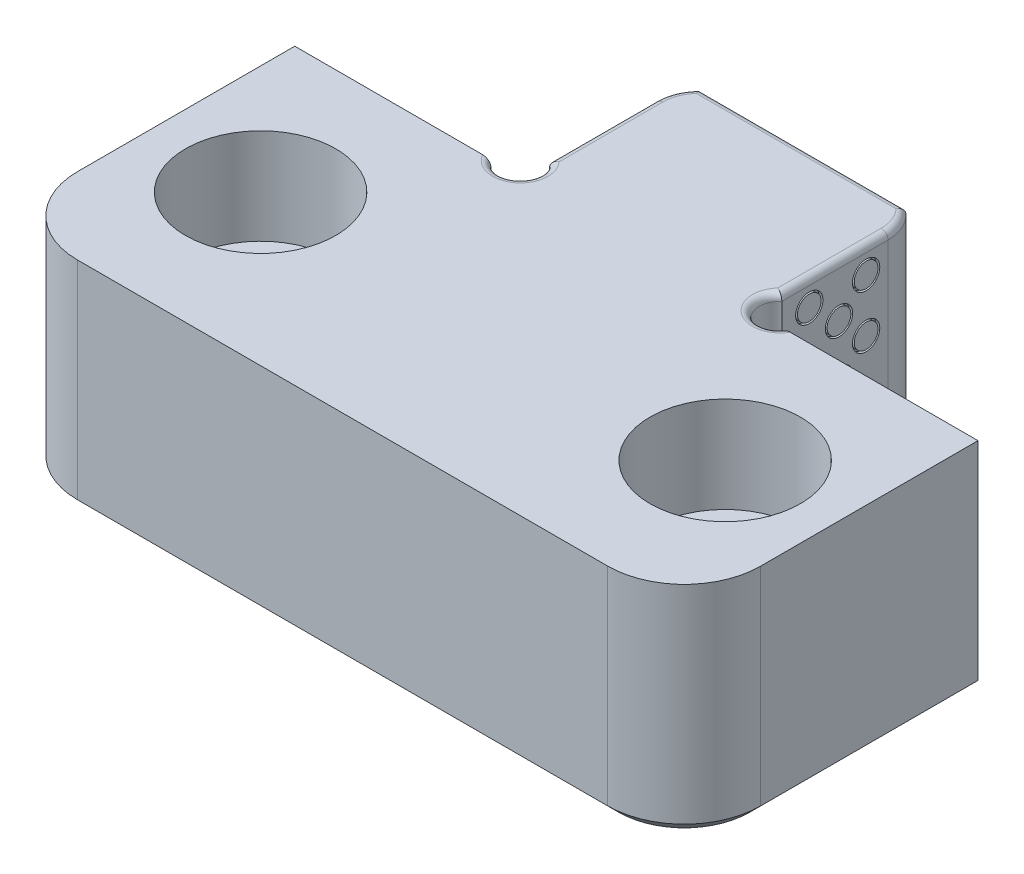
ISO-10303-21;
HEADER;
FILE_DESCRIPTION(('STEP AP214'),'2;1');
FILE_NAME('part.step','',(''),(''),'','','');
FILE_SCHEMA(('AUTOMOTIVE_DESIGN { 1 0 10303 214 1 1 1 1 }'));
ENDSEC;
DATA;
#1=APPLICATION_CONTEXT('core data for automotive mechanical design processes');
#2=APPLICATION_PROTOCOL_DEFINITION('international standard','automotive_design',2000,#1);
#3=PRODUCT_CONTEXT('',#1,'mechanical');
#4=PRODUCT('Part','Part','',(#3));
#5=PRODUCT_RELATED_PRODUCT_CATEGORY('part','',(#4));
#6=PRODUCT_DEFINITION_FORMATION('','',#4);
#7=PRODUCT_DEFINITION_CONTEXT('part definition',#1,'design');
#8=PRODUCT_DEFINITION('design','',#6,#7);
#9=PRODUCT_DEFINITION_SHAPE('','',#8);
#10=(LENGTH_UNIT() NAMED_UNIT(*) SI_UNIT(.MILLI.,.METRE.));
#11=(NAMED_UNIT(*) PLANE_ANGLE_UNIT() SI_UNIT($,.RADIAN.));
#12=(NAMED_UNIT(*) SI_UNIT($,.STERADIAN.) SOLID_ANGLE_UNIT());
#13=UNCERTAINTY_MEASURE_WITH_UNIT(LENGTH_MEASURE(1.E-05),#10,'distance_accuracy_value','');
#14=(GEOMETRIC_REPRESENTATION_CONTEXT(3) GLOBAL_UNCERTAINTY_ASSIGNED_CONTEXT((#13)) GLOBAL_UNIT_ASSIGNED_CONTEXT((#10,
#11,#12)) REPRESENTATION_CONTEXT('',''));
#15=CARTESIAN_POINT('',(0.,0.,0.));
#16=DIRECTION('',(0.,0.,1.));
#17=DIRECTION('',(1.,0.,0.));
#18=AXIS2_PLACEMENT_3D('',#15,#16,#17);
#19=CARTESIAN_POINT('',(-8.4965,-16.,0.));
#20=DIRECTION('',(-1.,0.,0.));
#21=DIRECTION('',(0.,0.,1.));
#22=AXIS2_PLACEMENT_3D('',#19,#20,#21);
#23=PLANE('',#22);
#24=CARTESIAN_POINT('',(-8.4965,-5.77166782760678,-4.15662252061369));
#25=DIRECTION('',(1.,0.,0.));
#26=DIRECTION('',(0.,0.,-1.));
#27=AXIS2_PLACEMENT_3D('',#24,#25,#26);
#28=CIRCLE('',#27,0.999999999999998);
#29=CARTESIAN_POINT('',(-8.4965,-5.77166782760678,-5.15662252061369));
#30=VERTEX_POINT('',#29);
#31=EDGE_CURVE('E676',#30,#30,#28,.T.);
#32=ORIENTED_EDGE('',*,*,#31,.T.);
#33=EDGE_LOOP('',(#32));
#34=FACE_BOUND('',#33,.T.);
#35=CARTESIAN_POINT('',(-8.4965,-9.79669345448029,-4.15662252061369));
#36=DIRECTION('',(1.,0.,0.));
#37=DIRECTION('',(0.,0.,-1.));
#38=AXIS2_PLACEMENT_3D('',#35,#36,#37);
#39=CIRCLE('',#38,0.999999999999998);
#40=CARTESIAN_POINT('',(-8.4965,-9.79669345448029,-5.15662252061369));
#41=VERTEX_POINT('',#40);
#42=EDGE_CURVE('E673',#41,#41,#39,.T.);
#43=ORIENTED_EDGE('',*,*,#42,.T.);
#44=EDGE_LOOP('',(#43));
#45=FACE_BOUND('',#44,.T.);
#46=CARTESIAN_POINT('',(-8.4965,-13.4460500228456,-4.15662252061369));
#47=DIRECTION('',(1.,0.,0.));
#48=DIRECTION('',(0.,0.,-1.));
#49=AXIS2_PLACEMENT_3D('',#46,#47,#48);
#50=CIRCLE('',#49,0.999999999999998);
#51=CARTESIAN_POINT('',(-8.4965,-13.4460500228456,-5.15662252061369));
#52=VERTEX_POINT('',#51);
#53=EDGE_CURVE('E689',#52,#52,#50,.T.);
#54=ORIENTED_EDGE('',*,*,#53,.T.);
#55=EDGE_LOOP('',(#54));
#56=FACE_BOUND('',#55,.T.);
#57=CARTESIAN_POINT('',(-8.4965,-1.90764322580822,-4.15662252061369));
#58=DIRECTION('',(1.,0.,0.));
#59=DIRECTION('',(0.,0.,-1.));
#60=AXIS2_PLACEMENT_3D('',#57,#58,#59);
#61=CIRCLE('',#60,0.999999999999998);
#62=CARTESIAN_POINT('',(-8.4965,-1.90764322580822,-5.15662252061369));
#63=VERTEX_POINT('',#62);
#64=EDGE_CURVE('E701',#63,#63,#61,.T.);
#65=ORIENTED_EDGE('',*,*,#64,.T.);
#66=EDGE_LOOP('',(#65));
#67=FACE_BOUND('',#66,.T.);
#68=CARTESIAN_POINT('',(-8.4965,-7.70368012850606,-6.33013635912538));
#69=DIRECTION('',(1.,0.,0.));
#70=DIRECTION('',(0.,0.,-1.));
#71=AXIS2_PLACEMENT_3D('',#68,#69,#70);
#72=CIRCLE('',#71,0.999999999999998);
#73=CARTESIAN_POINT('',(-8.4965,-7.70368012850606,-7.33013635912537));
#74=VERTEX_POINT('',#73);
#75=EDGE_CURVE('E713',#74,#74,#72,.T.);
#76=ORIENTED_EDGE('',*,*,#75,.T.);
#77=EDGE_LOOP('',(#76));
#78=FACE_BOUND('',#77,.T.);
#79=CARTESIAN_POINT('',(-8.4965,-11.7287057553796,-6.33013635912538));
#80=DIRECTION('',(1.,0.,0.));
#81=DIRECTION('',(0.,0.,-1.));
#82=AXIS2_PLACEMENT_3D('',#79,#80,#81);
#83=CIRCLE('',#82,0.999999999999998);
#84=CARTESIAN_POINT('',(-8.4965,-11.7287057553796,-7.33013635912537));
#85=VERTEX_POINT('',#84);
#86=EDGE_CURVE('E725',#85,#85,#83,.T.);
#87=ORIENTED_EDGE('',*,*,#86,.T.);
#88=EDGE_LOOP('',(#87));
#89=FACE_BOUND('',#88,.T.);
#90=CARTESIAN_POINT('',(-8.4965,-3.83965552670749,-6.33013635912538));
#91=DIRECTION('',(1.,0.,0.));
#92=DIRECTION('',(0.,0.,-1.));
#93=AXIS2_PLACEMENT_3D('',#90,#91,#92);
#94=CIRCLE('',#93,0.999999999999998);
#95=CARTESIAN_POINT('',(-8.4965,-3.83965552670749,-7.33013635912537));
#96=VERTEX_POINT('',#95);
#97=EDGE_CURVE('E737',#96,#96,#94,.T.);
#98=ORIENTED_EDGE('',*,*,#97,.T.);
#99=EDGE_LOOP('',(#98));
#100=FACE_BOUND('',#99,.T.);
#101=CARTESIAN_POINT('',(-8.4965,-5.77166782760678,-8.31581566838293));
#102=DIRECTION('',(1.,0.,0.));
#103=DIRECTION('',(0.,0.,-1.));
#104=AXIS2_PLACEMENT_3D('',#101,#102,#103);
#105=CIRCLE('',#104,0.999999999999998);
#106=CARTESIAN_POINT('',(-8.4965,-5.77166782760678,-9.31581566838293));
#107=VERTEX_POINT('',#106);
#108=EDGE_CURVE('E749',#107,#107,#105,.T.);
#109=ORIENTED_EDGE('',*,*,#108,.T.);
#110=EDGE_LOOP('',(#109));
#111=FACE_BOUND('',#110,.T.);
#112=CARTESIAN_POINT('',(-8.4965,-9.79669345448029,-8.31581566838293));
#113=DIRECTION('',(1.,0.,0.));
#114=DIRECTION('',(0.,0.,-1.));
#115=AXIS2_PLACEMENT_3D('',#112,#113,#114);
#116=CIRCLE('',#115,0.999999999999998);
#117=CARTESIAN_POINT('',(-8.4965,-9.79669345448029,-9.31581566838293));
#118=VERTEX_POINT('',#117);
#119=EDGE_CURVE('E761',#118,#118,#116,.T.);
#120=ORIENTED_EDGE('',*,*,#119,.T.);
#121=EDGE_LOOP('',(#120));
#122=FACE_BOUND('',#121,.T.);
#123=CARTESIAN_POINT('',(-8.4965,-13.4460500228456,-8.31581566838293));
#124=DIRECTION('',(1.,0.,0.));
#125=DIRECTION('',(0.,0.,-1.));
#126=AXIS2_PLACEMENT_3D('',#123,#124,#125);
#127=CIRCLE('',#126,0.999999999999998);
#128=CARTESIAN_POINT('',(-8.4965,-13.4460500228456,-9.31581566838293));
#129=VERTEX_POINT('',#128);
#130=EDGE_CURVE('E773',#129,#129,#127,.T.);
#131=ORIENTED_EDGE('',*,*,#130,.T.);
#132=EDGE_LOOP('',(#131));
#133=FACE_BOUND('',#132,.T.);
#134=CARTESIAN_POINT('',(-8.4965,-1.90764322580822,-8.31581566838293));
#135=DIRECTION('',(1.,0.,0.));
#136=DIRECTION('',(0.,0.,-1.));
#137=AXIS2_PLACEMENT_3D('',#134,#135,#136);
#138=CIRCLE('',#137,0.999999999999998);
#139=CARTESIAN_POINT('',(-8.4965,-1.90764322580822,-9.31581566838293));
#140=VERTEX_POINT('',#139);
#141=EDGE_CURVE('E785',#140,#140,#138,.T.);
#142=ORIENTED_EDGE('',*,*,#141,.T.);
#143=EDGE_LOOP('',(#142));
#144=FACE_BOUND('',#143,.T.);
#145=DIRECTION('',(0.,1.,0.));
#146=VECTOR('',#145,1.);
#147=CARTESIAN_POINT('',(-8.4965,-16.,-9.92));
#148=LINE('',#147,#146);
#149=CARTESIAN_POINT('',(-8.4965,-14.7796636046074,-9.92));
#150=VERTEX_POINT('',#149);
#151=CARTESIAN_POINT('',(-8.4965,-0.5,-9.92));
#152=VERTEX_POINT('',#151);
#153=EDGE_CURVE('E975',#150,#152,#148,.T.);
#154=ORIENTED_EDGE('',*,*,#153,.F.);
#155=CARTESIAN_POINT('',(-8.4965,50.554,-2.1));
#156=DIRECTION('',(-1.,0.,0.));
#157=DIRECTION('',(0.,0.,1.));
#158=AXIS2_PLACEMENT_3D('',#155,#156,#157);
#159=CIRCLE('',#158,65.8);
#160=CARTESIAN_POINT('',(-8.4965,-15.2459839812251,-2.14591372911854));
#161=VERTEX_POINT('',#160);
#162=EDGE_CURVE('E1384',#150,#161,#159,.T.);
#163=ORIENTED_EDGE('',*,*,#162,.T.);
#164=DIRECTION('',(0.,1.,0.));
#165=VECTOR('',#164,1.);
#166=CARTESIAN_POINT('',(-8.4965,-16.,-2.14591372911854));
#167=LINE('',#166,#165);
#168=CARTESIAN_POINT('',(-8.4965,-15.2446623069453,-2.14591372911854));
#169=VERTEX_POINT('',#168);
#170=EDGE_CURVE('E954',#169,#161,#167,.F.);
#171=ORIENTED_EDGE('',*,*,#170,.F.);
#172=CARTESIAN_POINT('',(-8.4965,-0.5,-2.14591372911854));
#173=VERTEX_POINT('',#172);
#174=EDGE_CURVE('E957',#173,#169,#167,.F.);
#175=ORIENTED_EDGE('',*,*,#174,.F.);
#176=DIRECTION('',(0.,0.,1.));
#177=VECTOR('',#176,1.);
#178=CARTESIAN_POINT('',(-8.4965,-0.5,0.));
#179=LINE('',#178,#177);
#180=EDGE_CURVE('E1310',#173,#152,#179,.F.);
#181=ORIENTED_EDGE('',*,*,#180,.T.);
#182=EDGE_LOOP('',(#154,#163,#171,#175,#181));
#183=FACE_BOUND('',#182,.T.);
#184=ADVANCED_FACE('F35',(#34,#45,#56,#67,#78,#89,#100,#111,#122,#133,#144,#183),#23,.T.);
#185=CARTESIAN_POINT('',(8.4965,-16.,-12.2));
#186=DIRECTION('',(1.,0.,0.));
#187=DIRECTION('',(0.,0.,-1.));
#188=AXIS2_PLACEMENT_3D('',#185,#186,#187);
#189=PLANE('',#188);
#190=CARTESIAN_POINT('',(8.4965,-5.77166782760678,-4.15662252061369));
#191=DIRECTION('',(1.,0.,0.));
#192=DIRECTION('',(0.,0.,-1.));
#193=AXIS2_PLACEMENT_3D('',#190,#191,#192);
#194=CIRCLE('',#193,0.999999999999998);
#195=CARTESIAN_POINT('',(8.4965,-5.77166782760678,-5.15662252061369));
#196=VERTEX_POINT('',#195);
#197=EDGE_CURVE('E797',#196,#196,#194,.T.);
#198=ORIENTED_EDGE('',*,*,#197,.F.);
#199=EDGE_LOOP('',(#198));
#200=FACE_BOUND('',#199,.T.);
#201=CARTESIAN_POINT('',(8.4965,-9.79669345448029,-4.15662252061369));
#202=DIRECTION('',(1.,0.,0.));
#203=DIRECTION('',(0.,0.,-1.));
#204=AXIS2_PLACEMENT_3D('',#201,#202,#203);
#205=CIRCLE('',#204,0.999999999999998);
#206=CARTESIAN_POINT('',(8.4965,-9.79669345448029,-5.15662252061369));
#207=VERTEX_POINT('',#206);
#208=EDGE_CURVE('E809',#207,#207,#205,.T.);
#209=ORIENTED_EDGE('',*,*,#208,.F.);
#210=EDGE_LOOP('',(#209));
#211=FACE_BOUND('',#210,.T.);
#212=CARTESIAN_POINT('',(8.4965,-13.4460500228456,-4.15662252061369));
#213=DIRECTION('',(1.,0.,0.));
#214=DIRECTION('',(0.,0.,-1.));
#215=AXIS2_PLACEMENT_3D('',#212,#213,#214);
#216=CIRCLE('',#215,0.999999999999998);
#217=CARTESIAN_POINT('',(8.4965,-13.4460500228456,-5.15662252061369));
#218=VERTEX_POINT('',#217);
#219=EDGE_CURVE('E821',#218,#218,#216,.T.);
#220=ORIENTED_EDGE('',*,*,#219,.F.);
#221=EDGE_LOOP('',(#220));
#222=FACE_BOUND('',#221,.T.);
#223=CARTESIAN_POINT('',(8.4965,-1.90764322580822,-4.15662252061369));
#224=DIRECTION('',(1.,0.,0.));
#225=DIRECTION('',(0.,0.,-1.));
#226=AXIS2_PLACEMENT_3D('',#223,#224,#225);
#227=CIRCLE('',#226,0.999999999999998);
#228=CARTESIAN_POINT('',(8.4965,-1.90764322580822,-5.15662252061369));
#229=VERTEX_POINT('',#228);
#230=EDGE_CURVE('E833',#229,#229,#227,.T.);
#231=ORIENTED_EDGE('',*,*,#230,.F.);
#232=EDGE_LOOP('',(#231));
#233=FACE_BOUND('',#232,.T.);
#234=CARTESIAN_POINT('',(8.4965,-7.70368012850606,-6.33013635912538));
#235=DIRECTION('',(1.,0.,0.));
#236=DIRECTION('',(0.,0.,-1.));
#237=AXIS2_PLACEMENT_3D('',#234,#235,#236);
#238=CIRCLE('',#237,0.999999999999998);
#239=CARTESIAN_POINT('',(8.4965,-7.70368012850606,-7.33013635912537));
#240=VERTEX_POINT('',#239);
#241=EDGE_CURVE('E845',#240,#240,#238,.T.);
#242=ORIENTED_EDGE('',*,*,#241,.F.);
#243=EDGE_LOOP('',(#242));
#244=FACE_BOUND('',#243,.T.);
#245=CARTESIAN_POINT('',(8.4965,-11.7287057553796,-6.33013635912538));
#246=DIRECTION('',(1.,0.,0.));
#247=DIRECTION('',(0.,0.,-1.));
#248=AXIS2_PLACEMENT_3D('',#245,#246,#247);
#249=CIRCLE('',#248,0.999999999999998);
#250=CARTESIAN_POINT('',(8.4965,-11.7287057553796,-7.33013635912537));
#251=VERTEX_POINT('',#250);
#252=EDGE_CURVE('E857',#251,#251,#249,.T.);
#253=ORIENTED_EDGE('',*,*,#252,.F.);
#254=EDGE_LOOP('',(#253));
#255=FACE_BOUND('',#254,.T.);
#256=CARTESIAN_POINT('',(8.4965,-3.83965552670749,-6.33013635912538));
#257=DIRECTION('',(1.,0.,0.));
#258=DIRECTION('',(0.,0.,-1.));
#259=AXIS2_PLACEMENT_3D('',#256,#257,#258);
#260=CIRCLE('',#259,0.999999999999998);
#261=CARTESIAN_POINT('',(8.4965,-3.83965552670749,-7.33013635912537));
#262=VERTEX_POINT('',#261);
#263=EDGE_CURVE('E869',#262,#262,#260,.T.);
#264=ORIENTED_EDGE('',*,*,#263,.F.);
#265=EDGE_LOOP('',(#264));
#266=FACE_BOUND('',#265,.T.);
#267=CARTESIAN_POINT('',(8.4965,-5.77166782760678,-8.31581566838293));
#268=DIRECTION('',(1.,0.,0.));
#269=DIRECTION('',(0.,0.,-1.));
#270=AXIS2_PLACEMENT_3D('',#267,#268,#269);
#271=CIRCLE('',#270,0.999999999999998);
#272=CARTESIAN_POINT('',(8.4965,-5.77166782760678,-9.31581566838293));
#273=VERTEX_POINT('',#272);
#274=EDGE_CURVE('E881',#273,#273,#271,.T.);
#275=ORIENTED_EDGE('',*,*,#274,.F.);
#276=EDGE_LOOP('',(#275));
#277=FACE_BOUND('',#276,.T.);
#278=CARTESIAN_POINT('',(8.4965,-9.79669345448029,-8.31581566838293));
#279=DIRECTION('',(1.,0.,0.));
#280=DIRECTION('',(0.,0.,-1.));
#281=AXIS2_PLACEMENT_3D('',#278,#279,#280);
#282=CIRCLE('',#281,0.999999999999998);
#283=CARTESIAN_POINT('',(8.4965,-9.79669345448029,-9.31581566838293));
#284=VERTEX_POINT('',#283);
#285=EDGE_CURVE('E893',#284,#284,#282,.T.);
#286=ORIENTED_EDGE('',*,*,#285,.F.);
#287=EDGE_LOOP('',(#286));
#288=FACE_BOUND('',#287,.T.);
#289=CARTESIAN_POINT('',(8.4965,-13.4460500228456,-8.31581566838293));
#290=DIRECTION('',(1.,0.,0.));
#291=DIRECTION('',(0.,0.,-1.));
#292=AXIS2_PLACEMENT_3D('',#289,#290,#291);
#293=CIRCLE('',#292,0.999999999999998);
#294=CARTESIAN_POINT('',(8.4965,-13.4460500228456,-9.31581566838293));
#295=VERTEX_POINT('',#294);
#296=EDGE_CURVE('E905',#295,#295,#293,.T.);
#297=ORIENTED_EDGE('',*,*,#296,.F.);
#298=EDGE_LOOP('',(#297));
#299=FACE_BOUND('',#298,.T.);
#300=CARTESIAN_POINT('',(8.4965,-1.90764322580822,-8.31581566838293));
#301=DIRECTION('',(1.,0.,0.));
#302=DIRECTION('',(0.,0.,-1.));
#303=AXIS2_PLACEMENT_3D('',#300,#301,#302);
#304=CIRCLE('',#303,0.999999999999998);
#305=CARTESIAN_POINT('',(8.4965,-1.90764322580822,-9.31581566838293));
#306=VERTEX_POINT('',#305);
#307=EDGE_CURVE('E917',#306,#306,#304,.T.);
#308=ORIENTED_EDGE('',*,*,#307,.F.);
#309=EDGE_LOOP('',(#308));
#310=FACE_BOUND('',#309,.T.);
#311=DIRECTION('',(0.,1.,0.));
#312=VECTOR('',#311,1.);
#313=CARTESIAN_POINT('',(8.4965,-16.,-9.92));
#314=LINE('',#313,#312);
#315=CARTESIAN_POINT('',(8.4965,-14.7796636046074,-9.92));
#316=VERTEX_POINT('',#315);
#317=CARTESIAN_POINT('',(8.4965,-0.5,-9.92));
#318=VERTEX_POINT('',#317);
#319=EDGE_CURVE('E978',#316,#318,#314,.T.);
#320=ORIENTED_EDGE('',*,*,#319,.T.);
#321=DIRECTION('',(0.,0.,-1.));
#322=VECTOR('',#321,1.);
#323=CARTESIAN_POINT('',(8.4965,-0.5,-12.2));
#324=LINE('',#323,#322);
#325=CARTESIAN_POINT('',(8.4965,-0.5,-2.14591372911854));
#326=VERTEX_POINT('',#325);
#327=EDGE_CURVE('E1124',#318,#326,#324,.F.);
#328=ORIENTED_EDGE('',*,*,#327,.T.);
#329=DIRECTION('',(0.,1.,0.));
#330=VECTOR('',#329,1.);
#331=CARTESIAN_POINT('',(8.4965,-16.,-2.14591372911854));
#332=LINE('',#331,#330);
#333=CARTESIAN_POINT('',(8.4965,-15.2446623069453,-2.14591372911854));
#334=VERTEX_POINT('',#333);
#335=EDGE_CURVE('E964',#334,#326,#332,.T.);
#336=ORIENTED_EDGE('',*,*,#335,.F.);
#337=CARTESIAN_POINT('',(8.4965,-15.2459839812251,-2.14591372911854));
#338=VERTEX_POINT('',#337);
#339=EDGE_CURVE('E967',#338,#334,#332,.T.);
#340=ORIENTED_EDGE('',*,*,#339,.F.);
#341=CARTESIAN_POINT('',(8.4965,50.554,-2.1));
#342=DIRECTION('',(1.,0.,0.));
#343=DIRECTION('',(0.,0.,-1.));
#344=AXIS2_PLACEMENT_3D('',#341,#342,#343);
#345=CIRCLE('',#344,65.8);
#346=EDGE_CURVE('E322',#338,#316,#345,.T.);
#347=ORIENTED_EDGE('',*,*,#346,.T.);
#348=EDGE_LOOP('',(#320,#328,#336,#340,#347));
#349=FACE_BOUND('',#348,.T.);
#350=ADVANCED_FACE('F476',(#200,#211,#222,#233,#244,#255,#266,#277,#288,#299,#310,#349),#189,.T.);
#351=CARTESIAN_POINT('',(-25.,-16.,0.));
#352=DIRECTION('',(-1.,0.,0.));
#353=DIRECTION('',(0.,0.,1.));
#354=AXIS2_PLACEMENT_3D('',#351,#352,#353);
#355=PLANE('',#354);
#356=DIRECTION('',(0.,1.,0.));
#357=VECTOR('',#356,1.);
#358=CARTESIAN_POINT('',(-25.,-16.,0.));
#359=LINE('',#358,#357);
#360=CARTESIAN_POINT('',(-25.,-15.2,0.));
#361=VERTEX_POINT('',#360);
#362=CARTESIAN_POINT('',(-25.,0.,0.));
#363=VERTEX_POINT('',#362);
#364=EDGE_CURVE('E269',#361,#363,#359,.T.);
#365=ORIENTED_EDGE('',*,*,#364,.F.);
#366=DIRECTION('',(0.,0.,1.));
#367=VECTOR('',#366,1.);
#368=CARTESIAN_POINT('',(-25.,-15.2,15.9));
#369=LINE('',#368,#367);
#370=CARTESIAN_POINT('',(-25.,-15.2,15.9));
#371=VERTEX_POINT('',#370);
#372=EDGE_CURVE('E1073',#361,#371,#369,.T.);
#373=ORIENTED_EDGE('',*,*,#372,.T.);
#374=DIRECTION('',(0.,1.,0.));
#375=VECTOR('',#374,1.);
#376=CARTESIAN_POINT('',(-25.,-16.,15.9));
#377=LINE('',#376,#375);
#378=CARTESIAN_POINT('',(-25.,0.,15.9));
#379=VERTEX_POINT('',#378);
#380=EDGE_CURVE('E293',#371,#379,#377,.T.);
#381=ORIENTED_EDGE('',*,*,#380,.T.);
#382=DIRECTION('',(0.,0.,1.));
#383=VECTOR('',#382,1.);
#384=CARTESIAN_POINT('',(-25.,0.,0.));
#385=LINE('',#384,#383);
#386=EDGE_CURVE('E971',#363,#379,#385,.T.);
#387=ORIENTED_EDGE('',*,*,#386,.F.);
#388=EDGE_LOOP('',(#365,#373,#381,#387));
#389=FACE_BOUND('',#388,.T.);
#390=ADVANCED_FACE('F486',(#389),#355,.T.);
#391=CARTESIAN_POINT('',(-8.4965,-16.,0.));
#392=DIRECTION('',(0.,0.,-1.));
#393=DIRECTION('',(-1.,0.,0.));
#394=AXIS2_PLACEMENT_3D('',#391,#392,#393);
#395=PLANE('',#394);
#396=DIRECTION('',(-1.,0.,0.));
#397=VECTOR('',#396,1.);
#398=CARTESIAN_POINT('',(-8.4965,-16.,0.));
#399=LINE('',#398,#397);
#400=CARTESIAN_POINT('',(-11.2558713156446,-16.,0.));
#401=VERTEX_POINT('',#400);
#402=CARTESIAN_POINT('',(-24.2,-16.,0.));
#403=VERTEX_POINT('',#402);
#404=EDGE_CURVE('E270',#401,#403,#399,.T.);
#405=ORIENTED_EDGE('',*,*,#404,.T.);
#406=DIRECTION('',(-0.707106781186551,0.707106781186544,0.));
#407=VECTOR('',#406,1.);
#408=CARTESIAN_POINT('',(-16.3482499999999,-23.85175,0.));
#409=LINE('',#408,#407);
#410=EDGE_CURVE('E996',#403,#361,#409,.T.);
#411=ORIENTED_EDGE('',*,*,#410,.T.);
#412=ORIENTED_EDGE('',*,*,#364,.T.);
#413=DIRECTION('',(-1.,0.,0.));
#414=VECTOR('',#413,1.);
#415=CARTESIAN_POINT('',(-8.4965,0.,0.));
#416=LINE('',#415,#414);
#417=CARTESIAN_POINT('',(-11.2558713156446,0.,0.));
#418=VERTEX_POINT('',#417);
#419=EDGE_CURVE('E286',#418,#363,#416,.T.);
#420=ORIENTED_EDGE('',*,*,#419,.F.);
#421=CARTESIAN_POINT('',(-11.2558713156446,0.,0.));
#422=CARTESIAN_POINT('',(-11.2132726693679,-5.71406654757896E-06,0.));
#423=CARTESIAN_POINT('',(-11.170708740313,-0.00408333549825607,0.));
#424=CARTESIAN_POINT('',(-11.0869079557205,-0.0199604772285,0.));
#425=CARTESIAN_POINT('',(-11.0456754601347,-0.0317831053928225,0.));
#426=CARTESIAN_POINT('',(-10.9696355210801,-0.0613361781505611,0.));
#427=CARTESIAN_POINT('',(-10.934583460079,-0.0784419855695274,0.));
#428=CARTESIAN_POINT('',(-10.8679902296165,-0.118467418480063,0.));
#429=CARTESIAN_POINT('',(-10.8364430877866,-0.141376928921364,0.));
#430=CARTESIAN_POINT('',(-10.7859841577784,-0.186040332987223,0.));
#431=CARTESIAN_POINT('',(-10.7659324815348,-0.20651043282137,0.));
#432=CARTESIAN_POINT('',(-10.7293451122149,-0.250395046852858,0.));
#433=CARTESIAN_POINT('',(-10.712804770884,-0.273805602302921,0.));
#434=CARTESIAN_POINT('',(-10.686964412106,-0.318584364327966,0.));
#435=CARTESIAN_POINT('',(-10.6768868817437,-0.339502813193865,0.));
#436=CARTESIAN_POINT('',(-10.6603436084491,-0.382706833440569,0.));
#437=CARTESIAN_POINT('',(-10.6538696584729,-0.404989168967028,0.));
#438=CARTESIAN_POINT('',(-10.6471204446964,-0.43956046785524,0.));
#439=CARTESIAN_POINT('',(-10.6453615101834,-0.451573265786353,0.));
#440=CARTESIAN_POINT('',(-10.6430061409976,-0.475721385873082,0.));
#441=CARTESIAN_POINT('',(-10.6424106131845,-0.487856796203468,0.));
#442=CARTESIAN_POINT('',(-10.6424137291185,-0.500000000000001,0.));
#443=B_SPLINE_CURVE_WITH_KNOTS('',3,(#421,#422,#423,#424,#425,#426,#427,#428,#429,#430,#431,
#432,#433,#434,#435,#436,#437,#438,#439,#440,#441,#442),.UNSPECIFIED.,.F.,.F.,(4,2,2,2,2,2,2,2,
2,2,4),(0.,0.12756688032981,0.255516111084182,0.371994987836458,0.488272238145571,
0.573935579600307,0.659484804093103,0.72887134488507,0.798099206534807,0.83447132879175,
0.870871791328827),.UNSPECIFIED.);
#444=CARTESIAN_POINT('',(-10.6424137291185,-0.5,0.));
#445=VERTEX_POINT('',#444);
#446=EDGE_CURVE('E432',#418,#445,#443,.T.);
#447=ORIENTED_EDGE('',*,*,#446,.T.);
#448=DIRECTION('',(0.,1.,0.));
#449=VECTOR('',#448,1.);
#450=CARTESIAN_POINT('',(-10.6424137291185,-16.,0.));
#451=LINE('',#450,#449);
#452=CARTESIAN_POINT('',(-10.6424137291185,-15.5,0.));
#453=VERTEX_POINT('',#452);
#454=EDGE_CURVE('E958',#453,#445,#451,.T.);
#455=ORIENTED_EDGE('',*,*,#454,.F.);
#456=CARTESIAN_POINT('',(-10.6424137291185,-15.5,0.));
#457=CARTESIAN_POINT('',(-10.6423553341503,-15.523692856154,0.));
#458=CARTESIAN_POINT('',(-10.6446638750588,-15.5473194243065,0.));
#459=CARTESIAN_POINT('',(-10.6534924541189,-15.5935640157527,0.));
#460=CARTESIAN_POINT('',(-10.6599747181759,-15.6161891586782,0.));
#461=CARTESIAN_POINT('',(-10.6766186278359,-15.6599327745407,0.));
#462=CARTESIAN_POINT('',(-10.6867686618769,-15.6810557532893,0.));
#463=CARTESIAN_POINT('',(-10.7101299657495,-15.7215797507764,0.));
#464=CARTESIAN_POINT('',(-10.7233492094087,-15.7409760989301,0.));
#465=CARTESIAN_POINT('',(-10.7578977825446,-15.7849953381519,0.));
#466=CARTESIAN_POINT('',(-10.7803809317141,-15.8087133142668,0.));
#467=CARTESIAN_POINT('',(-10.8288838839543,-15.8521883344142,0.));
#468=CARTESIAN_POINT('',(-10.8549079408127,-15.871940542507,0.));
#469=CARTESIAN_POINT('',(-10.910004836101,-15.907650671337,0.));
#470=CARTESIAN_POINT('',(-10.9391187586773,-15.9235448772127,0.));
#471=CARTESIAN_POINT('',(-10.9992901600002,-15.9509998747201,0.));
#472=CARTESIAN_POINT('',(-11.0303463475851,-15.9625635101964,0.));
#473=CARTESIAN_POINT('',(-11.0934808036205,-15.9811128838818,0.));
#474=CARTESIAN_POINT('',(-11.1255466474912,-15.9881408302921,0.));
#475=CARTESIAN_POINT('',(-11.1903582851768,-15.9975844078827,0.));
#476=CARTESIAN_POINT('',(-11.223104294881,-15.9999985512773,0.));
#477=CARTESIAN_POINT('',(-11.2558713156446,-16.,0.));
#478=B_SPLINE_CURVE_WITH_KNOTS('',3,(#456,#457,#458,#459,#460,#461,#462,#463,#464,#465,#466,
#467,#468,#469,#470,#471,#472,#473,#474,#475,#476,#477),.UNSPECIFIED.,.F.,.F.,(4,2,2,2,2,2,2,2,
2,2,4),(0.,0.070861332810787,0.141090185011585,0.211098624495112,0.281291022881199,
0.378809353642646,0.476445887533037,0.575599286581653,0.674687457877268,0.772839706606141,
0.871023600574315),.UNSPECIFIED.);
#479=EDGE_CURVE('E396',#453,#401,#478,.T.);
#480=ORIENTED_EDGE('',*,*,#479,.T.);
#481=EDGE_LOOP('',(#405,#411,#412,#420,#447,#455,#480));
#482=FACE_BOUND('',#481,.T.);
#483=ADVANCED_FACE('F488',(#482),#395,.T.);
#484=CARTESIAN_POINT('',(-8.4965,-16.,-12.2));
#485=DIRECTION('',(0.,0.,-1.));
#486=DIRECTION('',(-1.,0.,0.));
#487=AXIS2_PLACEMENT_3D('',#484,#485,#486);
#488=PLANE('',#487);
#489=DIRECTION('',(-1.,0.,0.));
#490=VECTOR('',#489,1.);
#491=CARTESIAN_POINT('',(-7.52587728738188,-14.5419292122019,-12.2));
#492=LINE('',#491,#490);
#493=CARTESIAN_POINT('',(7.52525961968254,-14.5419292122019,-12.2));
#494=VERTEX_POINT('',#493);
#495=CARTESIAN_POINT('',(-7.52525961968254,-14.5419292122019,-12.2));
#496=VERTEX_POINT('',#495);
#497=EDGE_CURVE('E1246',#494,#496,#492,.T.);
#498=ORIENTED_EDGE('',*,*,#497,.T.);
#499=CARTESIAN_POINT('',(-8.42667892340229,-14.8438672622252,-9.25906258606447));
#500=CARTESIAN_POINT('',(-8.43822327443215,-15.3525443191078,-9.31309314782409));
#501=CARTESIAN_POINT('',(-7.9377154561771,-15.3408115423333,-9.41873020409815));
#502=CARTESIAN_POINT('',(-8.44987866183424,-14.8337202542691,-9.36759963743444));
#503=CARTESIAN_POINT('',(-8.45967569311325,-15.3405200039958,-9.42272628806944));
#504=CARTESIAN_POINT('',(-7.95724804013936,-15.3305874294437,-9.51080531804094));
#505=CARTESIAN_POINT('',(-8.46732635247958,-14.8232685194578,-9.47727002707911));
#506=CARTESIAN_POINT('',(-8.4753050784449,-15.3280949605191,-9.53349793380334));
#507=CARTESIAN_POINT('',(-7.97193779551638,-15.3200562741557,-9.60384187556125));
#508=CARTESIAN_POINT('',(-8.4906490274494,-14.8018354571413,-9.69795183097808));
#509=CARTESIAN_POINT('',(-8.49475310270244,-15.3025792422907,-9.75599836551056));
#510=CARTESIAN_POINT('',(-7.99157388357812,-15.2984603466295,-9.79105262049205));
#511=CARTESIAN_POINT('',(-8.49650450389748,-14.7908532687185,-9.80896518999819));
#512=CARTESIAN_POINT('',(-8.49859488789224,-15.2894939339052,-9.86769107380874));
#513=CARTESIAN_POINT('',(-7.99650379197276,-15.2873947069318,-9.88522845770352));
#514=CARTESIAN_POINT('',(-8.49649273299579,-14.761609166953,-10.0991538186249));
#515=CARTESIAN_POINT('',(-8.49313827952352,-15.2546585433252,-10.1587207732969));
#516=CARTESIAN_POINT('',(-7.99649388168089,-15.257928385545,-10.1314038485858));
#517=CARTESIAN_POINT('',(-8.48122984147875,-14.7430145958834,-10.2783634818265));
#518=CARTESIAN_POINT('',(-8.47449216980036,-15.2324656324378,-10.338020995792));
#519=CARTESIAN_POINT('',(-7.98364357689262,-15.239192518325,-10.283432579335));
#520=CARTESIAN_POINT('',(-8.42063766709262,-14.7053389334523,-10.63157519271));
#521=CARTESIAN_POINT('',(-8.40710456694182,-15.1874707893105,-10.6901954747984));
#522=CARTESIAN_POINT('',(-7.93262913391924,-15.2012305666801,-10.5830722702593));
#523=CARTESIAN_POINT('',(-8.37529232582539,-14.6862575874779,-10.8055744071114));
#524=CARTESIAN_POINT('',(-8.35857853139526,-15.1646828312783,-10.8630349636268));
#525=CARTESIAN_POINT('',(-7.89445147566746,-15.1820042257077,-10.7306808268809));
#526=CARTESIAN_POINT('',(-8.25582889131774,-14.6482827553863,-11.1434050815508));
#527=CARTESIAN_POINT('',(-8.2331747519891,-15.1193503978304,-11.1973582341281));
#528=CARTESIAN_POINT('',(-7.79387148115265,-15.1437408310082,-11.0172723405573));
#529=CARTESIAN_POINT('',(-8.18171810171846,-14.6293892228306,-11.3072391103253));
#530=CARTESIAN_POINT('',(-8.15652275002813,-15.0968072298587,-11.3589055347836));
#531=CARTESIAN_POINT('',(-7.73147529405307,-15.1247037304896,-11.1562574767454));
#532=CARTESIAN_POINT('',(-8.00679965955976,-14.5925259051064,-11.6201054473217));
#533=CARTESIAN_POINT('',(-7.97735610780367,-15.0528772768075,-11.6662117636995));
#534=CARTESIAN_POINT('',(-7.58420599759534,-15.0875602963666,-11.4216710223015));
#535=CARTESIAN_POINT('',(-7.90599228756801,-14.5745561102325,-11.769137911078));
#536=CARTESIAN_POINT('',(-7.87501090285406,-15.0314773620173,-11.8121186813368));
#537=CARTESIAN_POINT('',(-7.49933312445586,-15.0694539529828,-11.5480995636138));
#538=CARTESIAN_POINT('',(-7.68052214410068,-14.5403205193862,-12.0480050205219));
#539=CARTESIAN_POINT('',(-7.64760754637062,-14.9907792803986,-12.0840979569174));
#540=CARTESIAN_POINT('',(-7.30950277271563,-15.0349582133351,-11.7846705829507));
#541=CARTESIAN_POINT('',(-7.55589406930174,-14.5240522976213,-12.1778671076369));
#542=CARTESIAN_POINT('',(-7.52267470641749,-14.9714527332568,-12.2104076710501));
#543=CARTESIAN_POINT('',(-7.20457450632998,-15.0185663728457,-11.8948363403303));
#544=CARTESIAN_POINT('',(-7.35372855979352,-14.501476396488,-12.3555193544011));
#545=CARTESIAN_POINT('',(-7.32073601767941,-14.9446492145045,-12.3828366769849));
#546=CARTESIAN_POINT('',(-7.03436505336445,-14.9958189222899,-12.0455438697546));
#547=CARTESIAN_POINT('',(-7.28373081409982,-14.4942496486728,-12.4119242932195));
#548=CARTESIAN_POINT('',(-7.25107938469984,-14.936085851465,-12.4374330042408));
#549=CARTESIAN_POINT('',(-6.975431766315,-14.9885372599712,-12.0933938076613));
#550=CARTESIAN_POINT('',(-7.13912278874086,-14.480488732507,-12.5186246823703));
#551=CARTESIAN_POINT('',(-7.10749059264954,-14.9197944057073,-12.5405534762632));
#552=CARTESIAN_POINT('',(-6.85368175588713,-14.9746717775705,-12.1839108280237));
#553=CARTESIAN_POINT('',(-7.06451202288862,-14.473954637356,-12.5689194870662));
#554=CARTESIAN_POINT('',(-7.0335506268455,-14.912061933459,-12.5891074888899));
#555=CARTESIAN_POINT('',(-6.79086462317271,-14.9680880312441,-12.2265773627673));
#556=CARTESIAN_POINT('',(-6.987821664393,-14.4678060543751,-12.6159843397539));
#557=CARTESIAN_POINT('',(-6.95759291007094,-14.9047829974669,-12.6345354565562));
#558=CARTESIAN_POINT('',(-6.72629661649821,-14.9618927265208,-12.266503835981));
#559=(BOUNDED_SURFACE() B_SPLINE_SURFACE(3,2,((#499,#500,#501),(#502,#503,#504),(#505,#506,
#507),(#508,#509,#510),(#511,#512,#513),(#514,#515,#516),(#517,#518,#519),(#520,#521,#522),
(#523,#524,#525),(#526,#527,#528),(#529,#530,#531),(#532,#533,#534),(#535,#536,#537),(#538,#539,
#540),(#541,#542,#543),(#544,#545,#546),(#547,#548,#549),(#550,#551,#552),(#553,#554,#555),
(#556,#557,#558)),.UNSPECIFIED.,.F.,.F.,.F.) B_SPLINE_SURFACE_WITH_KNOTS((4,2,2,2,2,2,2,2,2,4),
(3,3),(0.,0.281765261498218,0.564004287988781,1.01939480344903,1.47502860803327,
1.93054680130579,2.38606020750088,2.84091511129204,3.06876562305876,3.2966401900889),(0.,1.),
.UNSPECIFIED.) GEOMETRIC_REPRESENTATION_ITEM() RATIONAL_B_SPLINE_SURFACE(((1.,0.698904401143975,
1.),(1.,0.700154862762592,1.),(1.,0.701467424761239,1.),(1.,0.704205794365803,1.),(1.,
0.705631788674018,1.),(1.,0.70948667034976,1.),(1.,0.711994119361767,1.),(1.,0.717171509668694,
1.),(1.,0.719841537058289,1.),(1.,0.725230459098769,1.),(1.,0.7279493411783,1.),(1.,
0.733308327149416,1.),(1.,0.735948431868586,1.),(1.,0.741014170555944,1.),(1.,0.743440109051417,
1.),(1.,0.746822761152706,1.),(1.,0.74790849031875,1.),(1.,0.749980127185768,1.),(1.,
0.750966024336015,1.),(1.,0.751895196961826,1.))) REPRESENTATION_ITEM('') SURFACE());
#560=CARTESIAN_POINT('',(-7.52525961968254,-14.5419292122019,-12.2));
#561=CARTESIAN_POINT('',(-7.52545694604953,-14.5384752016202,-12.2));
#562=CARTESIAN_POINT('',(-7.52560708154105,-14.5350197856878,-12.2));
#563=CARTESIAN_POINT('',(-7.52581297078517,-14.5281061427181,-12.2));
#564=CARTESIAN_POINT('',(-7.52586872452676,-14.5246479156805,-12.2));
#565=CARTESIAN_POINT('',(-7.52587728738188,-14.5211882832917,-12.2));
#566=B_SPLINE_CURVE_WITH_KNOTS('',3,(#560,#561,#562,#563,#564,#565),.UNSPECIFIED.,.F.,.F.,(4,2,
4),(0.,0.0103760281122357,0.0207520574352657),.UNSPECIFIED.);
#567=CARTESIAN_POINT('',(-7.52587728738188,-14.5211882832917,-12.2));
#568=VERTEX_POINT('',#567);
#569=EDGE_CURVE('E1252',#496,#568,#566,.T.);
#570=ORIENTED_EDGE('',*,*,#569,.T.);
#571=DIRECTION('',(0.,1.,0.));
#572=VECTOR('',#571,1.);
#573=CARTESIAN_POINT('',(-7.52587728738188,-16.,-12.2));
#574=LINE('',#573,#572);
#575=CARTESIAN_POINT('',(-7.52587728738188,-0.5,-12.2));
#576=VERTEX_POINT('',#575);
#577=EDGE_CURVE('E972',#568,#576,#574,.T.);
#578=ORIENTED_EDGE('',*,*,#577,.T.);
#579=DIRECTION('',(-1.,0.,0.));
#580=VECTOR('',#579,1.);
#581=CARTESIAN_POINT('',(-8.4965,-0.5,-12.2));
#582=LINE('',#581,#580);
#583=CARTESIAN_POINT('',(7.52587728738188,-0.5,-12.2));
#584=VERTEX_POINT('',#583);
#585=EDGE_CURVE('E1242',#576,#584,#582,.F.);
#586=ORIENTED_EDGE('',*,*,#585,.T.);
#587=DIRECTION('',(0.,1.,0.));
#588=VECTOR('',#587,1.);
#589=CARTESIAN_POINT('',(7.52587728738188,-16.,-12.2));
#590=LINE('',#589,#588);
#591=CARTESIAN_POINT('',(7.52587728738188,-14.5211882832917,-12.2));
#592=VERTEX_POINT('',#591);
#593=EDGE_CURVE('E968',#592,#584,#590,.T.);
#594=ORIENTED_EDGE('',*,*,#593,.F.);
#595=CARTESIAN_POINT('',(7.9377154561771,-15.3408115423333,-9.41873020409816));
#596=CARTESIAN_POINT('',(8.43822327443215,-15.3525443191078,-9.3130931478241));
#597=CARTESIAN_POINT('',(8.42667892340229,-14.8438672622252,-9.25906258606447));
#598=CARTESIAN_POINT('',(7.95724804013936,-15.3305874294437,-9.51080531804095));
#599=CARTESIAN_POINT('',(8.45967569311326,-15.3405200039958,-9.42272628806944));
#600=CARTESIAN_POINT('',(8.44987866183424,-14.8337202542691,-9.36759963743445));
#601=CARTESIAN_POINT('',(7.97193779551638,-15.3200562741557,-9.60384187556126));
#602=CARTESIAN_POINT('',(8.4753050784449,-15.3280949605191,-9.53349793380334));
#603=CARTESIAN_POINT('',(8.46732635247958,-14.8232685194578,-9.47727002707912));
#604=CARTESIAN_POINT('',(7.99157388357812,-15.2984603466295,-9.79105262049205));
#605=CARTESIAN_POINT('',(8.49475310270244,-15.3025792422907,-9.75599836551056));
#606=CARTESIAN_POINT('',(8.4906490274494,-14.8018354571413,-9.69795183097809));
#607=CARTESIAN_POINT('',(7.99650379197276,-15.2873947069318,-9.88522845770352));
#608=CARTESIAN_POINT('',(8.49859488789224,-15.2894939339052,-9.86769107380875));
#609=CARTESIAN_POINT('',(8.49650450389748,-14.7908532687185,-9.8089651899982));
#610=CARTESIAN_POINT('',(7.99649388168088,-15.257928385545,-10.1314038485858));
#611=CARTESIAN_POINT('',(8.49313827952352,-15.2546585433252,-10.1587207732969));
#612=CARTESIAN_POINT('',(8.49649273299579,-14.761609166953,-10.0991538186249));
#613=CARTESIAN_POINT('',(7.98364357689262,-15.239192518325,-10.283432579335));
#614=CARTESIAN_POINT('',(8.47449216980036,-15.2324656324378,-10.338020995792));
#615=CARTESIAN_POINT('',(8.48122984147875,-14.7430145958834,-10.2783634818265));
#616=CARTESIAN_POINT('',(7.93262913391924,-15.2012305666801,-10.5830722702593));
#617=CARTESIAN_POINT('',(8.40710456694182,-15.1874707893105,-10.6901954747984));
#618=CARTESIAN_POINT('',(8.42063766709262,-14.7053389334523,-10.63157519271));
#619=CARTESIAN_POINT('',(7.89445147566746,-15.1820042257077,-10.7306808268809));
#620=CARTESIAN_POINT('',(8.35857853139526,-15.1646828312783,-10.8630349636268));
#621=CARTESIAN_POINT('',(8.37529232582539,-14.6862575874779,-10.8055744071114));
#622=CARTESIAN_POINT('',(7.79387148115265,-15.1437408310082,-11.0172723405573));
#623=CARTESIAN_POINT('',(8.23317475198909,-15.1193503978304,-11.1973582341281));
#624=CARTESIAN_POINT('',(8.25582889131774,-14.6482827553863,-11.1434050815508));
#625=CARTESIAN_POINT('',(7.73147529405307,-15.1247037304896,-11.1562574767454));
#626=CARTESIAN_POINT('',(8.15652275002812,-15.0968072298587,-11.3589055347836));
#627=CARTESIAN_POINT('',(8.18171810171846,-14.6293892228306,-11.3072391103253));
#628=CARTESIAN_POINT('',(7.58420599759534,-15.0875602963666,-11.4216710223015));
#629=CARTESIAN_POINT('',(7.97735610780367,-15.0528772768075,-11.6662117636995));
#630=CARTESIAN_POINT('',(8.00679965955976,-14.5925259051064,-11.6201054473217));
#631=CARTESIAN_POINT('',(7.49933312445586,-15.0694539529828,-11.5480995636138));
#632=CARTESIAN_POINT('',(7.87501090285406,-15.0314773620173,-11.8121186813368));
#633=CARTESIAN_POINT('',(7.90599228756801,-14.5745561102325,-11.769137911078));
#634=CARTESIAN_POINT('',(7.30950277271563,-15.0349582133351,-11.7846705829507));
#635=CARTESIAN_POINT('',(7.64760754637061,-14.9907792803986,-12.0840979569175));
#636=CARTESIAN_POINT('',(7.68052214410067,-14.5403205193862,-12.0480050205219));
#637=CARTESIAN_POINT('',(7.20457450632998,-15.0185663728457,-11.8948363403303));
#638=CARTESIAN_POINT('',(7.52267470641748,-14.9714527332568,-12.2104076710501));
#639=CARTESIAN_POINT('',(7.55589406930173,-14.5240522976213,-12.1778671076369));
#640=CARTESIAN_POINT('',(7.03436505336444,-14.9958189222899,-12.0455438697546));
#641=CARTESIAN_POINT('',(7.3207360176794,-14.9446492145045,-12.3828366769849));
#642=CARTESIAN_POINT('',(7.35372855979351,-14.501476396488,-12.3555193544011));
#643=CARTESIAN_POINT('',(6.975431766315,-14.9885372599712,-12.0933938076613));
#644=CARTESIAN_POINT('',(7.25107938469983,-14.936085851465,-12.4374330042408));
#645=CARTESIAN_POINT('',(7.28373081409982,-14.4942496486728,-12.4119242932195));
#646=CARTESIAN_POINT('',(6.85368175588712,-14.9746717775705,-12.1839108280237));
#647=CARTESIAN_POINT('',(7.10749059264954,-14.9197944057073,-12.5405534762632));
#648=CARTESIAN_POINT('',(7.13912278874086,-14.480488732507,-12.5186246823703));
#649=CARTESIAN_POINT('',(6.7908646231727,-14.9680880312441,-12.2265773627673));
#650=CARTESIAN_POINT('',(7.03355062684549,-14.912061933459,-12.5891074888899));
#651=CARTESIAN_POINT('',(7.06451202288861,-14.473954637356,-12.5689194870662));
#652=CARTESIAN_POINT('',(6.72629661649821,-14.9618927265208,-12.266503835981));
#653=CARTESIAN_POINT('',(6.95759291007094,-14.9047829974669,-12.6345354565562));
#654=CARTESIAN_POINT('',(6.98782166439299,-14.4678060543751,-12.6159843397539));
#655=(BOUNDED_SURFACE() B_SPLINE_SURFACE(3,2,((#595,#596,#597),(#598,#599,#600),(#601,#602,
#603),(#604,#605,#606),(#607,#608,#609),(#610,#611,#612),(#613,#614,#615),(#616,#617,#618),
(#619,#620,#621),(#622,#623,#624),(#625,#626,#627),(#628,#629,#630),(#631,#632,#633),(#634,#635,
#636),(#637,#638,#639),(#640,#641,#642),(#643,#644,#645),(#646,#647,#648),(#649,#650,#651),
(#652,#653,#654)),.UNSPECIFIED.,.F.,.F.,.F.) B_SPLINE_SURFACE_WITH_KNOTS((4,2,2,2,2,2,2,2,2,4),
(3,3),(0.,0.281765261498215,0.564004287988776,1.01939480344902,1.47502860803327,
1.93054680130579,2.38606020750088,2.84091511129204,3.06876562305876,3.2966401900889),(0.,1.),
.UNSPECIFIED.) GEOMETRIC_REPRESENTATION_ITEM() RATIONAL_B_SPLINE_SURFACE(((1.,0.698904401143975,
1.),(1.,0.700154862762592,1.),(1.,0.701467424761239,1.),(1.,0.704205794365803,1.),(1.,
0.705631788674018,1.),(1.,0.70948667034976,1.),(1.,0.711994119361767,1.),(1.,0.717171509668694,
1.),(1.,0.719841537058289,1.),(1.,0.725230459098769,1.),(1.,0.7279493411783,1.),(1.,
0.733308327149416,1.),(1.,0.735948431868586,1.),(1.,0.741014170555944,1.),(1.,0.743440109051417,
1.),(1.,0.746822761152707,1.),(1.,0.74790849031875,1.),(1.,0.749980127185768,1.),(1.,
0.750966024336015,1.),(1.,0.751895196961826,1.))) REPRESENTATION_ITEM('') SURFACE());
#656=CARTESIAN_POINT('',(7.52587728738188,-14.5211882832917,-12.2));
#657=CARTESIAN_POINT('',(7.52586872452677,-14.5246479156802,-12.2));
#658=CARTESIAN_POINT('',(7.52581297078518,-14.5281061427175,-12.2));
#659=CARTESIAN_POINT('',(7.52560708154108,-14.5350197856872,-12.2));
#660=CARTESIAN_POINT('',(7.52545694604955,-14.53847520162,-12.2));
#661=CARTESIAN_POINT('',(7.52525961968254,-14.5419292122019,-12.2));
#662=B_SPLINE_CURVE_WITH_KNOTS('',3,(#656,#657,#658,#659,#660,#661),.UNSPECIFIED.,.F.,.F.,(4,2,
4),(0.,0.0103760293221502,0.0207520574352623),.UNSPECIFIED.);
#663=EDGE_CURVE('E1248',#592,#494,#662,.T.);
#664=ORIENTED_EDGE('',*,*,#663,.T.);
#665=EDGE_LOOP('',(#498,#570,#578,#586,#594,#664));
#666=FACE_BOUND('',#665,.T.);
#667=ADVANCED_FACE('F475',(#666),#488,.T.);
#668=CARTESIAN_POINT('',(8.4965,-16.,0.));
#669=DIRECTION('',(0.,0.,-1.));
#670=DIRECTION('',(-1.,0.,0.));
#671=AXIS2_PLACEMENT_3D('',#668,#669,#670);
#672=PLANE('',#671);
#673=DIRECTION('',(0.,1.,0.));
#674=VECTOR('',#673,1.);
#675=CARTESIAN_POINT('',(25.,-16.,0.));
#676=LINE('',#675,#674);
#677=CARTESIAN_POINT('',(25.,-15.2,0.));
#678=VERTEX_POINT('',#677);
#679=CARTESIAN_POINT('',(25.,0.,0.));
#680=VERTEX_POINT('',#679);
#681=EDGE_CURVE('E262',#678,#680,#676,.T.);
#682=ORIENTED_EDGE('',*,*,#681,.F.);
#683=DIRECTION('',(-0.707106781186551,-0.707106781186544,0.));
#684=VECTOR('',#683,1.);
#685=CARTESIAN_POINT('',(16.3482499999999,-23.85175,0.));
#686=LINE('',#685,#684);
#687=CARTESIAN_POINT('',(24.2,-16.,0.));
#688=VERTEX_POINT('',#687);
#689=EDGE_CURVE('E11',#678,#688,#686,.T.);
#690=ORIENTED_EDGE('',*,*,#689,.T.);
#691=DIRECTION('',(-1.,0.,0.));
#692=VECTOR('',#691,1.);
#693=CARTESIAN_POINT('',(8.4965,-16.,0.));
#694=LINE('',#693,#692);
#695=CARTESIAN_POINT('',(11.2558713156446,-16.,0.));
#696=VERTEX_POINT('',#695);
#697=EDGE_CURVE('E289',#688,#696,#694,.T.);
#698=ORIENTED_EDGE('',*,*,#697,.T.);
#699=CARTESIAN_POINT('',(11.2558713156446,-16.,0.));
#700=CARTESIAN_POINT('',(11.2132726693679,-15.9999942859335,0.));
#701=CARTESIAN_POINT('',(11.170708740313,-15.9959166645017,0.));
#702=CARTESIAN_POINT('',(11.0869079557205,-15.9800395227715,0.));
#703=CARTESIAN_POINT('',(11.0456754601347,-15.9682168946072,0.));
#704=CARTESIAN_POINT('',(10.9696355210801,-15.9386638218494,0.));
#705=CARTESIAN_POINT('',(10.934583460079,-15.9215580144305,0.));
#706=CARTESIAN_POINT('',(10.8679902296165,-15.8815325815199,0.));
#707=CARTESIAN_POINT('',(10.8364430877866,-15.8586230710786,0.));
#708=CARTESIAN_POINT('',(10.7859841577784,-15.8139596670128,0.));
#709=CARTESIAN_POINT('',(10.7659324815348,-15.7934895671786,0.));
#710=CARTESIAN_POINT('',(10.7293451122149,-15.7496049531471,0.));
#711=CARTESIAN_POINT('',(10.712804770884,-15.7261943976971,0.));
#712=CARTESIAN_POINT('',(10.686964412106,-15.681415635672,0.));
#713=CARTESIAN_POINT('',(10.6768868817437,-15.6604971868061,0.));
#714=CARTESIAN_POINT('',(10.6603436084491,-15.6172931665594,0.));
#715=CARTESIAN_POINT('',(10.6538696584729,-15.595010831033,0.));
#716=CARTESIAN_POINT('',(10.6471204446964,-15.5604395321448,0.));
#717=CARTESIAN_POINT('',(10.6453615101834,-15.5484267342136,0.));
#718=CARTESIAN_POINT('',(10.6430061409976,-15.5242786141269,0.));
#719=CARTESIAN_POINT('',(10.6424106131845,-15.5121432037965,0.));
#720=CARTESIAN_POINT('',(10.6424137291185,-15.5,0.));
#721=B_SPLINE_CURVE_WITH_KNOTS('',3,(#699,#700,#701,#702,#703,#704,#705,#706,#707,#708,#709,
#710,#711,#712,#713,#714,#715,#716,#717,#718,#719,#720),.UNSPECIFIED.,.F.,.F.,(4,2,2,2,2,2,2,2,
2,2,4),(0.,0.12756688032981,0.255516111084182,0.371994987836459,0.488272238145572,
0.573935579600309,0.659484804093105,0.728871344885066,0.798099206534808,0.834471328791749,
0.870871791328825),.UNSPECIFIED.);
#722=CARTESIAN_POINT('',(10.6424137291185,-15.5,0.));
#723=VERTEX_POINT('',#722);
#724=EDGE_CURVE('E460',#696,#723,#721,.T.);
#725=ORIENTED_EDGE('',*,*,#724,.T.);
#726=DIRECTION('',(0.,1.,0.));
#727=VECTOR('',#726,1.);
#728=CARTESIAN_POINT('',(10.6424137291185,-16.,0.));
#729=LINE('',#728,#727);
#730=CARTESIAN_POINT('',(10.6424137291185,-0.5,0.));
#731=VERTEX_POINT('',#730);
#732=EDGE_CURVE('E961',#731,#723,#729,.F.);
#733=ORIENTED_EDGE('',*,*,#732,.F.);
#734=CARTESIAN_POINT('',(10.6424137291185,-0.5,0.));
#735=CARTESIAN_POINT('',(10.6423553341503,-0.476307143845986,0.));
#736=CARTESIAN_POINT('',(10.6446638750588,-0.452680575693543,0.));
#737=CARTESIAN_POINT('',(10.6534924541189,-0.406435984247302,0.));
#738=CARTESIAN_POINT('',(10.6599747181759,-0.383810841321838,0.));
#739=CARTESIAN_POINT('',(10.6766186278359,-0.340067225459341,0.));
#740=CARTESIAN_POINT('',(10.6867686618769,-0.318944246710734,0.));
#741=CARTESIAN_POINT('',(10.7101299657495,-0.278420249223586,0.));
#742=CARTESIAN_POINT('',(10.7233492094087,-0.259023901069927,0.));
#743=CARTESIAN_POINT('',(10.7578977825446,-0.215004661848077,0.));
#744=CARTESIAN_POINT('',(10.7803809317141,-0.191286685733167,0.));
#745=CARTESIAN_POINT('',(10.8288838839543,-0.147811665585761,0.));
#746=CARTESIAN_POINT('',(10.8549079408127,-0.12805945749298,0.));
#747=CARTESIAN_POINT('',(10.910004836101,-0.0923493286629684,0.));
#748=CARTESIAN_POINT('',(10.9391187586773,-0.0764551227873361,0.));
#749=CARTESIAN_POINT('',(10.9992901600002,-0.0490001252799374,0.));
#750=CARTESIAN_POINT('',(11.0303463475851,-0.0374364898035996,0.));
#751=CARTESIAN_POINT('',(11.0934808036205,-0.0188871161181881,0.));
#752=CARTESIAN_POINT('',(11.1255466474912,-0.0118591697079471,0.));
#753=CARTESIAN_POINT('',(11.1903582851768,-0.00241559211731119,0.));
#754=CARTESIAN_POINT('',(11.223104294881,-1.44872273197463E-06,0.));
#755=CARTESIAN_POINT('',(11.2558713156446,0.,0.));
#756=B_SPLINE_CURVE_WITH_KNOTS('',3,(#734,#735,#736,#737,#738,#739,#740,#741,#742,#743,#744,
#745,#746,#747,#748,#749,#750,#751,#752,#753,#754,#755),.UNSPECIFIED.,.F.,.F.,(4,2,2,2,2,2,2,2,
2,2,4),(0.,0.0708613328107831,0.141090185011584,0.21109862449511,0.281291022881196,
0.378809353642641,0.476445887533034,0.575599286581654,0.674687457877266,0.772839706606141,
0.871023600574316),.UNSPECIFIED.);
#757=CARTESIAN_POINT('',(11.2558713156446,0.,0.));
#758=VERTEX_POINT('',#757);
#759=EDGE_CURVE('E285',#731,#758,#756,.T.);
#760=ORIENTED_EDGE('',*,*,#759,.T.);
#761=DIRECTION('',(-1.,0.,0.));
#762=VECTOR('',#761,1.);
#763=CARTESIAN_POINT('',(8.4965,0.,0.));
#764=LINE('',#763,#762);
#765=EDGE_CURVE('E275',#680,#758,#764,.T.);
#766=ORIENTED_EDGE('',*,*,#765,.F.);
#767=EDGE_LOOP('',(#682,#690,#698,#725,#733,#760,#766));
#768=FACE_BOUND('',#767,.T.);
#769=ADVANCED_FACE('F282',(#768),#672,.T.);
#770=CARTESIAN_POINT('',(25.,-16.,0.));
#771=DIRECTION('',(1.,0.,0.));
#772=DIRECTION('',(0.,0.,-1.));
#773=AXIS2_PLACEMENT_3D('',#770,#771,#772);
#774=PLANE('',#773);
#775=DIRECTION('',(0.,1.,0.));
#776=VECTOR('',#775,1.);
#777=CARTESIAN_POINT('',(25.,-16.,15.9));
#778=LINE('',#777,#776);
#779=CARTESIAN_POINT('',(25.,0.,15.9));
#780=VERTEX_POINT('',#779);
#781=CARTESIAN_POINT('',(25.,-15.2,15.9));
#782=VERTEX_POINT('',#781);
#783=EDGE_CURVE('E304',#780,#782,#778,.F.);
#784=ORIENTED_EDGE('',*,*,#783,.T.);
#785=DIRECTION('',(0.,0.,-1.));
#786=VECTOR('',#785,1.);
#787=CARTESIAN_POINT('',(25.,-15.2,0.));
#788=LINE('',#787,#786);
#789=EDGE_CURVE('E44',#782,#678,#788,.T.);
#790=ORIENTED_EDGE('',*,*,#789,.T.);
#791=ORIENTED_EDGE('',*,*,#681,.T.);
#792=DIRECTION('',(0.,0.,-1.));
#793=VECTOR('',#792,1.);
#794=CARTESIAN_POINT('',(25.,0.,0.));
#795=LINE('',#794,#793);
#796=EDGE_CURVE('E265',#780,#680,#795,.T.);
#797=ORIENTED_EDGE('',*,*,#796,.F.);
#798=EDGE_LOOP('',(#784,#790,#791,#797));
#799=FACE_BOUND('',#798,.T.);
#800=ADVANCED_FACE('F264',(#799),#774,.T.);
#801=CARTESIAN_POINT('',(-25.,-16.,21.5));
#802=DIRECTION('',(0.,0.,1.));
#803=DIRECTION('',(1.,0.,0.));
#804=AXIS2_PLACEMENT_3D('',#801,#802,#803);
#805=PLANE('',#804);
#806=DIRECTION('',(0.,1.,0.));
#807=VECTOR('',#806,1.);
#808=CARTESIAN_POINT('',(-19.4,-16.,21.5));
#809=LINE('',#808,#807);
#810=CARTESIAN_POINT('',(-19.4,0.,21.5));
#811=VERTEX_POINT('',#810);
#812=CARTESIAN_POINT('',(-19.4,-15.2,21.5));
#813=VERTEX_POINT('',#812);
#814=EDGE_CURVE('E301',#811,#813,#809,.F.);
#815=ORIENTED_EDGE('',*,*,#814,.T.);
#816=DIRECTION('',(1.,0.,0.));
#817=VECTOR('',#816,1.);
#818=CARTESIAN_POINT('',(19.4,-15.2,21.5));
#819=LINE('',#818,#817);
#820=CARTESIAN_POINT('',(19.4,-15.2,21.5));
#821=VERTEX_POINT('',#820);
#822=EDGE_CURVE('E995',#813,#821,#819,.T.);
#823=ORIENTED_EDGE('',*,*,#822,.T.);
#824=DIRECTION('',(0.,1.,0.));
#825=VECTOR('',#824,1.);
#826=CARTESIAN_POINT('',(19.4,-16.,21.5));
#827=LINE('',#826,#825);
#828=CARTESIAN_POINT('',(19.4,0.,21.5));
#829=VERTEX_POINT('',#828);
#830=EDGE_CURVE('E299',#821,#829,#827,.T.);
#831=ORIENTED_EDGE('',*,*,#830,.T.);
#832=DIRECTION('',(1.,0.,0.));
#833=VECTOR('',#832,1.);
#834=CARTESIAN_POINT('',(-25.,0.,21.5));
#835=LINE('',#834,#833);
#836=EDGE_CURVE('E280',#811,#829,#835,.T.);
#837=ORIENTED_EDGE('',*,*,#836,.F.);
#838=EDGE_LOOP('',(#815,#823,#831,#837));
#839=FACE_BOUND('',#838,.T.);
#840=ADVANCED_FACE('F481',(#839),#805,.T.);
#841=CARTESIAN_POINT('',(-25.,-16.,21.5));
#842=DIRECTION('',(0.,1.,0.));
#843=DIRECTION('',(0.,0.,1.));
#844=AXIS2_PLACEMENT_3D('',#841,#842,#843);
#845=PLANE('',#844);
#846=CARTESIAN_POINT('',(17.,-16.,10.5));
#847=DIRECTION('',(0.,1.,0.));
#848=DIRECTION('',(0.,0.,1.));
#849=AXIS2_PLACEMENT_3D('',#846,#847,#848);
#850=CIRCLE('',#849,3.3);
#851=CARTESIAN_POINT('',(17.,-16.,13.8));
#852=VERTEX_POINT('',#851);
#853=EDGE_CURVE('E39',#852,#852,#850,.T.);
#854=ORIENTED_EDGE('',*,*,#853,.T.);
#855=EDGE_LOOP('',(#854));
#856=FACE_BOUND('',#855,.T.);
#857=CARTESIAN_POINT('',(-17.,-16.,10.5));
#858=DIRECTION('',(0.,1.,0.));
#859=DIRECTION('',(0.,0.,1.));
#860=AXIS2_PLACEMENT_3D('',#857,#858,#859);
#861=CIRCLE('',#860,3.3);
#862=CARTESIAN_POINT('',(-17.,-16.,13.8));
#863=VERTEX_POINT('',#862);
#864=EDGE_CURVE('E943',#863,#863,#861,.T.);
#865=ORIENTED_EDGE('',*,*,#864,.T.);
#866=EDGE_LOOP('',(#865));
#867=FACE_BOUND('',#866,.T.);
#868=CARTESIAN_POINT('',(-19.4,-16.,15.9));
#869=DIRECTION('',(0.,1.,0.));
#870=DIRECTION('',(0.,0.,1.));
#871=AXIS2_PLACEMENT_3D('',#868,#869,#870);
#872=CIRCLE('',#871,4.79999999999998);
#873=CARTESIAN_POINT('',(-19.4,-16.,20.7));
#874=VERTEX_POINT('',#873);
#875=CARTESIAN_POINT('',(-24.2,-16.,15.9));
#876=VERTEX_POINT('',#875);
#877=EDGE_CURVE('E1089',#874,#876,#872,.F.);
#878=ORIENTED_EDGE('',*,*,#877,.T.);
#879=DIRECTION('',(0.,0.,-1.));
#880=VECTOR('',#879,1.);
#881=CARTESIAN_POINT('',(-24.2,-16.,0.));
#882=LINE('',#881,#880);
#883=EDGE_CURVE('E999',#876,#403,#882,.T.);
#884=ORIENTED_EDGE('',*,*,#883,.T.);
#885=ORIENTED_EDGE('',*,*,#404,.F.);
#886=CARTESIAN_POINT('',(-9.5065,-16.,-1.01));
#887=DIRECTION('',(0.,1.,0.));
#888=DIRECTION('',(0.,0.,1.));
#889=AXIS2_PLACEMENT_3D('',#886,#887,#888);
#890=CIRCLE('',#889,2.02);
#891=CARTESIAN_POINT('',(-7.75712868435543,-16.,0.));
#892=VERTEX_POINT('',#891);
#893=EDGE_CURVE('E1109',#401,#892,#890,.T.);
#894=ORIENTED_EDGE('',*,*,#893,.T.);
#895=DIRECTION('',(1.,0.,0.));
#896=VECTOR('',#895,1.);
#897=CARTESIAN_POINT('',(-25.,-16.,0.));
#898=LINE('',#897,#896);
#899=CARTESIAN_POINT('',(7.75712868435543,-16.,0.));
#900=VERTEX_POINT('',#899);
#901=EDGE_CURVE('E947',#892,#900,#898,.T.);
#902=ORIENTED_EDGE('',*,*,#901,.T.);
#903=CARTESIAN_POINT('',(9.5065,-16.,-1.01));
#904=DIRECTION('',(0.,1.,0.));
#905=DIRECTION('',(0.,0.,1.));
#906=AXIS2_PLACEMENT_3D('',#903,#904,#905);
#907=CIRCLE('',#906,2.02);
#908=EDGE_CURVE('E1105',#900,#696,#907,.T.);
#909=ORIENTED_EDGE('',*,*,#908,.T.);
#910=ORIENTED_EDGE('',*,*,#697,.F.);
#911=DIRECTION('',(0.,0.,1.));
#912=VECTOR('',#911,1.);
#913=CARTESIAN_POINT('',(24.2,-16.,15.9));
#914=LINE('',#913,#912);
#915=CARTESIAN_POINT('',(24.2,-16.,15.9));
#916=VERTEX_POINT('',#915);
#917=EDGE_CURVE('E1074',#688,#916,#914,.T.);
#918=ORIENTED_EDGE('',*,*,#917,.T.);
#919=CARTESIAN_POINT('',(19.4,-16.,15.9));
#920=DIRECTION('',(0.,1.,0.));
#921=DIRECTION('',(0.,0.,1.));
#922=AXIS2_PLACEMENT_3D('',#919,#920,#921);
#923=CIRCLE('',#922,4.79999999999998);
#924=CARTESIAN_POINT('',(19.4,-16.,20.7));
#925=VERTEX_POINT('',#924);
#926=EDGE_CURVE('E1076',#916,#925,#923,.F.);
#927=ORIENTED_EDGE('',*,*,#926,.T.);
#928=DIRECTION('',(-1.,0.,0.));
#929=VECTOR('',#928,1.);
#930=CARTESIAN_POINT('',(-19.4,-16.,20.7));
#931=LINE('',#930,#929);
#932=EDGE_CURVE('E1087',#925,#874,#931,.T.);
#933=ORIENTED_EDGE('',*,*,#932,.T.);
#934=EDGE_LOOP('',(#878,#884,#885,#894,#902,#909,#910,#918,#927,#933));
#935=FACE_BOUND('',#934,.T.);
#936=ADVANCED_FACE('F484',(#856,#867,#935),#845,.F.);
#937=CARTESIAN_POINT('',(-25.,0.,21.5));
#938=DIRECTION('',(0.,1.,0.));
#939=DIRECTION('',(0.,0.,1.));
#940=AXIS2_PLACEMENT_3D('',#937,#938,#939);
#941=PLANE('',#940);
#942=CARTESIAN_POINT('',(17.,0.,10.5));
#943=DIRECTION('',(0.,1.,0.));
#944=DIRECTION('',(0.,0.,1.));
#945=AXIS2_PLACEMENT_3D('',#942,#943,#944);
#946=CIRCLE('',#945,5.5);
#947=CARTESIAN_POINT('',(17.,0.,16.));
#948=VERTEX_POINT('',#947);
#949=EDGE_CURVE('E923',#948,#948,#946,.T.);
#950=ORIENTED_EDGE('',*,*,#949,.F.);
#951=EDGE_LOOP('',(#950));
#952=FACE_BOUND('',#951,.T.);
#953=CARTESIAN_POINT('',(-17.,0.,10.5));
#954=DIRECTION('',(0.,1.,0.));
#955=DIRECTION('',(0.,0.,1.));
#956=AXIS2_PLACEMENT_3D('',#953,#954,#955);
#957=CIRCLE('',#956,5.5);
#958=CARTESIAN_POINT('',(-17.,0.,16.));
#959=VERTEX_POINT('',#958);
#960=EDGE_CURVE('E934',#959,#959,#957,.T.);
#961=ORIENTED_EDGE('',*,*,#960,.F.);
#962=EDGE_LOOP('',(#961));
#963=FACE_BOUND('',#962,.T.);
#964=ORIENTED_EDGE('',*,*,#765,.T.);
#965=CARTESIAN_POINT('',(9.5065,0.,-1.01));
#966=DIRECTION('',(0.,1.,0.));
#967=DIRECTION('',(0.,0.,1.));
#968=AXIS2_PLACEMENT_3D('',#965,#966,#967);
#969=CIRCLE('',#968,2.02);
#970=CARTESIAN_POINT('',(7.9965,0.,-2.35175258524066));
#971=VERTEX_POINT('',#970);
#972=EDGE_CURVE('E1395',#758,#971,#969,.F.);
#973=ORIENTED_EDGE('',*,*,#972,.T.);
#974=DIRECTION('',(0.,0.,-1.));
#975=VECTOR('',#974,1.);
#976=CARTESIAN_POINT('',(7.9965,0.,21.5));
#977=LINE('',#976,#975);
#978=CARTESIAN_POINT('',(7.9965,0.,-9.92));
#979=VERTEX_POINT('',#978);
#980=EDGE_CURVE('E1127',#971,#979,#977,.T.);
#981=ORIENTED_EDGE('',*,*,#980,.T.);
#982=CARTESIAN_POINT('',(5.33332013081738,0.,-9.92));
#983=DIRECTION('',(0.,1.,0.));
#984=DIRECTION('',(0.,0.,1.));
#985=AXIS2_PLACEMENT_3D('',#982,#983,#984);
#986=CIRCLE('',#985,2.66317986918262);
#987=CARTESIAN_POINT('',(7.31426107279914,0.,-11.7));
#988=VERTEX_POINT('',#987);
#989=EDGE_CURVE('E1393',#979,#988,#986,.T.);
#990=ORIENTED_EDGE('',*,*,#989,.T.);
#991=DIRECTION('',(-1.,0.,0.));
#992=VECTOR('',#991,1.);
#993=CARTESIAN_POINT('',(-25.,0.,-11.7));
#994=LINE('',#993,#992);
#995=CARTESIAN_POINT('',(-7.31426107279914,0.,-11.7));
#996=VERTEX_POINT('',#995);
#997=EDGE_CURVE('E1391',#988,#996,#994,.T.);
#998=ORIENTED_EDGE('',*,*,#997,.T.);
#999=CARTESIAN_POINT('',(-5.33332013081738,0.,-9.92));
#1000=DIRECTION('',(0.,1.,0.));
#1001=DIRECTION('',(0.,0.,1.));
#1002=AXIS2_PLACEMENT_3D('',#999,#1000,#1001);
#1003=CIRCLE('',#1002,2.66317986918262);
#1004=CARTESIAN_POINT('',(-7.9965,0.,-9.92));
#1005=VERTEX_POINT('',#1004);
#1006=EDGE_CURVE('E1389',#996,#1005,#1003,.T.);
#1007=ORIENTED_EDGE('',*,*,#1006,.T.);
#1008=DIRECTION('',(0.,0.,1.));
#1009=VECTOR('',#1008,1.);
#1010=CARTESIAN_POINT('',(-7.9965,0.,21.5));
#1011=LINE('',#1010,#1009);
#1012=CARTESIAN_POINT('',(-7.9965,0.,-2.35175258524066));
#1013=VERTEX_POINT('',#1012);
#1014=EDGE_CURVE('E1224',#1005,#1013,#1011,.T.);
#1015=ORIENTED_EDGE('',*,*,#1014,.T.);
#1016=CARTESIAN_POINT('',(-9.5065,0.,-1.01));
#1017=DIRECTION('',(0.,1.,0.));
#1018=DIRECTION('',(0.,0.,1.));
#1019=AXIS2_PLACEMENT_3D('',#1016,#1017,#1018);
#1020=CIRCLE('',#1019,2.02);
#1021=EDGE_CURVE('E1380',#1013,#418,#1020,.F.);
#1022=ORIENTED_EDGE('',*,*,#1021,.T.);
#1023=ORIENTED_EDGE('',*,*,#419,.T.);
#1024=ORIENTED_EDGE('',*,*,#386,.T.);
#1025=CARTESIAN_POINT('',(-19.4,0.,15.9));
#1026=DIRECTION('',(0.,1.,0.));
#1027=DIRECTION('',(0.,0.,1.));
#1028=AXIS2_PLACEMENT_3D('',#1025,#1026,#1027);
#1029=CIRCLE('',#1028,5.6);
#1030=EDGE_CURVE('E297',#379,#811,#1029,.T.);
#1031=ORIENTED_EDGE('',*,*,#1030,.T.);
#1032=ORIENTED_EDGE('',*,*,#836,.T.);
#1033=CARTESIAN_POINT('',(19.4,0.,15.9));
#1034=DIRECTION('',(0.,1.,0.));
#1035=DIRECTION('',(0.,0.,1.));
#1036=AXIS2_PLACEMENT_3D('',#1033,#1034,#1035);
#1037=CIRCLE('',#1036,5.6);
#1038=EDGE_CURVE('E279',#829,#780,#1037,.T.);
#1039=ORIENTED_EDGE('',*,*,#1038,.T.);
#1040=ORIENTED_EDGE('',*,*,#796,.T.);
#1041=EDGE_LOOP('',(#964,#973,#981,#990,#998,#1007,#1015,#1022,#1023,#1024,#1031,#1032,#1039,#1040));
#1042=FACE_BOUND('',#1041,.T.);
#1043=ADVANCED_FACE('F274',(#952,#963,#1042),#941,.T.);
#1044=CARTESIAN_POINT('',(-5.33332013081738,-16.,-9.92));
#1045=DIRECTION('',(0.,1.,0.));
#1046=DIRECTION('',(0.,0.,1.));
#1047=AXIS2_PLACEMENT_3D('',#1044,#1045,#1046);
#1048=CYLINDRICAL_SURFACE('',#1047,3.16317986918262);
#1049=ORIENTED_EDGE('',*,*,#577,.F.);
#1050=CARTESIAN_POINT('',(-6.987821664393,-14.4678060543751,-12.6159843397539));
#1051=CARTESIAN_POINT('',(-7.06451202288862,-14.473954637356,-12.5689194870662));
#1052=CARTESIAN_POINT('',(-7.13912278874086,-14.480488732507,-12.5186246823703));
#1053=CARTESIAN_POINT('',(-7.28373081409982,-14.4942496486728,-12.4119242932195));
#1054=CARTESIAN_POINT('',(-7.35372855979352,-14.501476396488,-12.3555193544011));
#1055=CARTESIAN_POINT('',(-7.55589406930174,-14.5240522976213,-12.1778671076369));
#1056=CARTESIAN_POINT('',(-7.68052214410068,-14.5403205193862,-12.0480050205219));
#1057=CARTESIAN_POINT('',(-7.90599228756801,-14.5745561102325,-11.769137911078));
#1058=CARTESIAN_POINT('',(-8.00679965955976,-14.5925259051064,-11.6201054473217));
#1059=CARTESIAN_POINT('',(-8.18171810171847,-14.6293892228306,-11.3072391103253));
#1060=CARTESIAN_POINT('',(-8.25582889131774,-14.6482827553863,-11.1434050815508));
#1061=CARTESIAN_POINT('',(-8.37529232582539,-14.6862575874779,-10.8055744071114));
#1062=CARTESIAN_POINT('',(-8.42063766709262,-14.7053389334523,-10.63157519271));
#1063=CARTESIAN_POINT('',(-8.48122984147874,-14.7430145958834,-10.2783634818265));
#1064=CARTESIAN_POINT('',(-8.49649273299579,-14.761609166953,-10.0991538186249));
#1065=CARTESIAN_POINT('',(-8.49650450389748,-14.7908532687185,-9.8089651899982));
#1066=CARTESIAN_POINT('',(-8.4906490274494,-14.8018354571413,-9.69795183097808));
#1067=CARTESIAN_POINT('',(-8.46732635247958,-14.8232685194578,-9.47727002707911));
#1068=CARTESIAN_POINT('',(-8.44987866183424,-14.8337202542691,-9.36759963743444));
#1069=CARTESIAN_POINT('',(-8.42667892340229,-14.8438672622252,-9.25906258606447));
#1070=B_SPLINE_CURVE_WITH_KNOTS('',3,(#1050,#1051,#1052,#1053,#1054,#1055,#1056,#1057,#1058,
#1059,#1060,#1061,#1062,#1063,#1064,#1065,#1066,#1067,#1068,#1069),.UNSPECIFIED.,.F.,.F.,(4,2,2,
2,2,2,2,2,2,4),(0.,0.227874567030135,0.455725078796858,0.910579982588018,1.36609338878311,
1.82161158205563,2.27724538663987,2.73263590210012,3.01487492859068,3.2966401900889),.UNSPECIFIED.);
#1071=EDGE_CURVE('E1236',#568,#150,#1070,.T.);
#1072=ORIENTED_EDGE('',*,*,#1071,.T.);
#1073=ORIENTED_EDGE('',*,*,#153,.T.);
#1074=CARTESIAN_POINT('',(-5.33332013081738,-0.5,-9.92));
#1075=DIRECTION('',(0.,1.,0.));
#1076=DIRECTION('',(0.,0.,1.));
#1077=AXIS2_PLACEMENT_3D('',#1074,#1075,#1076);
#1078=CIRCLE('',#1077,3.16317986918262);
#1079=EDGE_CURVE('E1243',#152,#576,#1078,.F.);
#1080=ORIENTED_EDGE('',*,*,#1079,.T.);
#1081=EDGE_LOOP('',(#1049,#1072,#1073,#1080));
#1082=FACE_BOUND('',#1081,.T.);
#1083=ADVANCED_FACE('F1044',(#1082),#1048,.T.);
#1084=CARTESIAN_POINT('',(5.33332013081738,-16.,-9.92));
#1085=DIRECTION('',(0.,1.,0.));
#1086=DIRECTION('',(0.,0.,1.));
#1087=AXIS2_PLACEMENT_3D('',#1084,#1085,#1086);
#1088=CYLINDRICAL_SURFACE('',#1087,3.16317986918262);
#1089=ORIENTED_EDGE('',*,*,#319,.F.);
#1090=CARTESIAN_POINT('',(8.42667892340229,-14.8438672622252,-9.25906258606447));
#1091=CARTESIAN_POINT('',(8.44987866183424,-14.8337202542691,-9.36759963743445));
#1092=CARTESIAN_POINT('',(8.46732635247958,-14.8232685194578,-9.47727002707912));
#1093=CARTESIAN_POINT('',(8.4906490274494,-14.8018354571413,-9.69795183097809));
#1094=CARTESIAN_POINT('',(8.49650450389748,-14.7908532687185,-9.8089651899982));
#1095=CARTESIAN_POINT('',(8.49649273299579,-14.761609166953,-10.0991538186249));
#1096=CARTESIAN_POINT('',(8.48122984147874,-14.7430145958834,-10.2783634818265));
#1097=CARTESIAN_POINT('',(8.42063766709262,-14.7053389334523,-10.63157519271));
#1098=CARTESIAN_POINT('',(8.37529232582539,-14.6862575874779,-10.8055744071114));
#1099=CARTESIAN_POINT('',(8.25582889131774,-14.6482827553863,-11.1434050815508));
#1100=CARTESIAN_POINT('',(8.18171810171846,-14.6293892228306,-11.3072391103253));
#1101=CARTESIAN_POINT('',(8.00679965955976,-14.5925259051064,-11.6201054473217));
#1102=CARTESIAN_POINT('',(7.905992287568,-14.5745561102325,-11.769137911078));
#1103=CARTESIAN_POINT('',(7.68052214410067,-14.5403205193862,-12.0480050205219));
#1104=CARTESIAN_POINT('',(7.55589406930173,-14.5240522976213,-12.1778671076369));
#1105=CARTESIAN_POINT('',(7.35372855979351,-14.501476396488,-12.3555193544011));
#1106=CARTESIAN_POINT('',(7.28373081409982,-14.4942496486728,-12.4119242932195));
#1107=CARTESIAN_POINT('',(7.13912278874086,-14.480488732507,-12.5186246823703));
#1108=CARTESIAN_POINT('',(7.06451202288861,-14.473954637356,-12.5689194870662));
#1109=CARTESIAN_POINT('',(6.98782166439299,-14.4678060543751,-12.6159843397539));
#1110=B_SPLINE_CURVE_WITH_KNOTS('',3,(#1090,#1091,#1092,#1093,#1094,#1095,#1096,#1097,#1098,
#1099,#1100,#1101,#1102,#1103,#1104,#1105,#1106,#1107,#1108,#1109),.UNSPECIFIED.,.F.,.F.,(4,2,2,
2,2,2,2,2,2,4),(0.,0.281765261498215,0.564004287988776,1.01939480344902,1.47502860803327,
1.93054680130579,2.38606020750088,2.84091511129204,3.06876562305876,3.2966401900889),.UNSPECIFIED.);
#1111=EDGE_CURVE('E1218',#316,#592,#1110,.T.);
#1112=ORIENTED_EDGE('',*,*,#1111,.T.);
#1113=ORIENTED_EDGE('',*,*,#593,.T.);
#1114=CARTESIAN_POINT('',(5.33332013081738,-0.5,-9.92));
#1115=DIRECTION('',(0.,1.,0.));
#1116=DIRECTION('',(0.,0.,1.));
#1117=AXIS2_PLACEMENT_3D('',#1114,#1115,#1116);
#1118=CIRCLE('',#1117,3.16317986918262);
#1119=EDGE_CURVE('E1225',#584,#318,#1118,.F.);
#1120=ORIENTED_EDGE('',*,*,#1119,.T.);
#1121=EDGE_LOOP('',(#1089,#1112,#1113,#1120));
#1122=FACE_BOUND('',#1121,.T.);
#1123=ADVANCED_FACE('F1051',(#1122),#1088,.T.);
#1124=CARTESIAN_POINT('',(9.5065,-16.,-1.01));
#1125=DIRECTION('',(0.,1.,0.));
#1126=DIRECTION('',(0.,0.,1.));
#1127=AXIS2_PLACEMENT_3D('',#1124,#1125,#1126);
#1128=CYLINDRICAL_SURFACE('',#1127,1.52);
#1129=CARTESIAN_POINT('',(9.5065,-15.246,-1.01));
#1130=DIRECTION('',(0.,1.,0.));
#1131=DIRECTION('',(0.,0.,1.));
#1132=AXIS2_PLACEMENT_3D('',#1129,#1130,#1131);
#1133=CIRCLE('',#1132,1.52);
#1134=CARTESIAN_POINT('',(8.49686439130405,-15.246,0.126237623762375));
#1135=VERTEX_POINT('',#1134);
#1136=CARTESIAN_POINT('',(8.22678315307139,-15.246,-1.83019801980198));
#1137=VERTEX_POINT('',#1136);
#1138=EDGE_CURVE('E312',#1135,#1137,#1133,.F.);
#1139=ORIENTED_EDGE('',*,*,#1138,.T.);
#1140=CARTESIAN_POINT('',(7.6149452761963,-15.7448874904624,-1.71591989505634));
#1141=CARTESIAN_POINT('',(8.08220206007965,-15.7438731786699,-1.54083208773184));
#1142=CARTESIAN_POINT('',(8.0831518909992,-15.2448958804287,-1.54336681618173));
#1143=CARTESIAN_POINT('',(7.6401114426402,-15.7452804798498,-1.78359702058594));
#1144=CARTESIAN_POINT('',(8.10122893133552,-15.7443482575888,-1.59189495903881));
#1145=CARTESIAN_POINT('',(8.10208880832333,-15.24528590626,-1.59390812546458));
#1146=CARTESIAN_POINT('',(7.66884649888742,-15.7455598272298,-1.84987703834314));
#1147=CARTESIAN_POINT('',(8.12298979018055,-15.7447595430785,-1.64187087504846));
#1148=CARTESIAN_POINT('',(8.12371122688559,-15.2455631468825,-1.64340607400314));
#1149=CARTESIAN_POINT('',(7.732674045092,-15.7459182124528,-1.97806754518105));
#1150=CARTESIAN_POINT('',(8.17134685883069,-15.7454626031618,-1.73845131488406));
#1151=CARTESIAN_POINT('',(8.17173987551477,-15.245918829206,-1.73913880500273));
#1152=CARTESIAN_POINT('',(7.76766973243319,-15.7460000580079,-2.0400269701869));
#1153=CARTESIAN_POINT('',(8.1978752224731,-15.7457560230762,-1.78510097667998));
#1154=CARTESIAN_POINT('',(8.19807326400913,-15.2460000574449,-1.78541013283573));
#1155=CARTESIAN_POINT('',(7.86639810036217,-15.7459999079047,-2.19521515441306));
#1156=CARTESIAN_POINT('',(8.2727073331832,-15.7463875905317,-1.90184080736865));
#1157=CARTESIAN_POINT('',(8.27236391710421,-15.2459999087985,-1.90130474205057));
#1158=CARTESIAN_POINT('',(7.93493313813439,-15.7457933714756,-2.28542344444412));
#1159=CARTESIAN_POINT('',(8.32464947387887,-15.7466504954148,-1.96958398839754));
#1160=CARTESIAN_POINT('',(8.32393483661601,-15.2457949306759,-1.96867233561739));
#1161=CARTESIAN_POINT('',(8.04893322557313,-15.7452795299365,-2.41207419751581));
#1162=CARTESIAN_POINT('',(8.41090531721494,-15.7469086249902,-2.06450168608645));
#1163=CARTESIAN_POINT('',(8.40971708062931,-15.2452849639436,-2.06325517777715));
#1164=CARTESIAN_POINT('',(8.08933808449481,-15.7450705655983,-2.45327406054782));
#1165=CARTESIAN_POINT('',(8.44146895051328,-15.7469718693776,-2.09535484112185));
#1166=CARTESIAN_POINT('',(8.44012073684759,-15.2450775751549,-2.09402325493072));
#1167=CARTESIAN_POINT('',(8.1734723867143,-15.744603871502,-2.53204999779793));
#1168=CARTESIAN_POINT('',(8.50506524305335,-15.7470598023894,-2.15429433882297));
#1169=CARTESIAN_POINT('',(8.5034297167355,-15.2446144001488,-2.15285316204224));
#1170=CARTESIAN_POINT('',(8.21720109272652,-15.7443461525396,-2.56962687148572));
#1171=CARTESIAN_POINT('',(8.5380993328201,-15.7470844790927,-2.18238033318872));
#1172=CARTESIAN_POINT('',(8.53633448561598,-15.2443586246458,-2.18091558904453));
#1173=CARTESIAN_POINT('',(8.26246464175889,-15.7440745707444,-2.60528033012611));
#1174=CARTESIAN_POINT('',(8.57225427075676,-15.7470947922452,-2.2089956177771));
#1175=CARTESIAN_POINT('',(8.57039418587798,-15.244089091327,-2.20754160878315));
#1176=(BOUNDED_SURFACE() B_SPLINE_SURFACE(3,2,((#1140,#1141,#1142),(#1143,#1144,#1145),(#1146,
#1147,#1148),(#1149,#1150,#1151),(#1152,#1153,#1154),(#1155,#1156,#1157),(#1158,#1159,#1160),
(#1161,#1162,#1163),(#1164,#1165,#1166),(#1167,#1168,#1169),(#1170,#1171,#1172),(#1173,#1174,
#1175)),.UNSPECIFIED.,.F.,.F.,.F.) B_SPLINE_SURFACE_WITH_KNOTS((4,2,2,2,2,4),(3,3),(0.,
0.214988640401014,0.426902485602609,0.763343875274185,0.93562385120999,1.10786572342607),(0.,
1.),.UNSPECIFIED.) GEOMETRIC_REPRESENTATION_ITEM() RATIONAL_B_SPLINE_SURFACE(((1.,
0.707825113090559,1.),(1.,0.707766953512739,1.),(1.,0.707673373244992,1.),(1.,0.707429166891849,
1.),(1.,0.707279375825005,1.),(1.,0.706832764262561,1.),(1.,0.706501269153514,1.),(1.,
0.705957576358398,1.),(1.,0.705766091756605,1.),(1.,0.705376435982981,1.),(1.,0.705178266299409,
1.),(1.,0.704980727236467,1.))) REPRESENTATION_ITEM('') SURFACE());
#1177=CARTESIAN_POINT('',(8.0831518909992,-15.2448958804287,-1.54336681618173));
#1178=CARTESIAN_POINT('',(8.10208880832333,-15.24528590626,-1.59390812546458));
#1179=CARTESIAN_POINT('',(8.12371122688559,-15.2455631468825,-1.64340607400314));
#1180=CARTESIAN_POINT('',(8.17173987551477,-15.245918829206,-1.73913880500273));
#1181=CARTESIAN_POINT('',(8.19807326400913,-15.2460000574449,-1.78541013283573));
#1182=CARTESIAN_POINT('',(8.27236391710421,-15.2459999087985,-1.90130474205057));
#1183=CARTESIAN_POINT('',(8.32393483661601,-15.2457949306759,-1.96867233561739));
#1184=CARTESIAN_POINT('',(8.40971708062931,-15.2452849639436,-2.06325517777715));
#1185=CARTESIAN_POINT('',(8.44012073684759,-15.2450775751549,-2.09402325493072));
#1186=CARTESIAN_POINT('',(8.5034297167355,-15.2446144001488,-2.15285316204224));
#1187=CARTESIAN_POINT('',(8.53633448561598,-15.2443586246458,-2.18091558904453));
#1188=CARTESIAN_POINT('',(8.57039418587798,-15.244089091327,-2.20754160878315));
#1189=B_SPLINE_CURVE_WITH_KNOTS('',3,(#1177,#1178,#1179,#1180,#1181,#1182,#1183,#1184,#1185,
#1186,#1187,#1188),.UNSPECIFIED.,.F.,.F.,(4,2,2,2,2,4),(0.,0.214988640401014,0.426902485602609,
0.763343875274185,0.93562385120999,1.10786572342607),.UNSPECIFIED.);
#1190=EDGE_CURVE('E314',#1137,#334,#1189,.T.);
#1191=ORIENTED_EDGE('',*,*,#1190,.T.);
#1192=ORIENTED_EDGE('',*,*,#335,.T.);
#1193=CARTESIAN_POINT('',(9.5065,-0.5,-1.01));
#1194=DIRECTION('',(0.,1.,0.));
#1195=DIRECTION('',(0.,0.,1.));
#1196=AXIS2_PLACEMENT_3D('',#1193,#1194,#1195);
#1197=CIRCLE('',#1196,1.52);
#1198=EDGE_CURVE('E306',#326,#731,#1197,.T.);
#1199=ORIENTED_EDGE('',*,*,#1198,.T.);
#1200=ORIENTED_EDGE('',*,*,#732,.T.);
#1201=CARTESIAN_POINT('',(9.5065,-15.5,-1.01));
#1202=DIRECTION('',(0.,1.,0.));
#1203=DIRECTION('',(0.,0.,1.));
#1204=AXIS2_PLACEMENT_3D('',#1201,#1202,#1203);
#1205=CIRCLE('',#1204,1.52);
#1206=CARTESIAN_POINT('',(8.49686439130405,-15.5,0.126237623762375));
#1207=VERTEX_POINT('',#1206);
#1208=EDGE_CURVE('E310',#723,#1207,#1205,.F.);
#1209=ORIENTED_EDGE('',*,*,#1208,.T.);
#1210=DIRECTION('',(0.,1.,0.));
#1211=VECTOR('',#1210,1.);
#1212=CARTESIAN_POINT('',(8.49686439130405,-16.,0.126237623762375));
#1213=LINE('',#1212,#1211);
#1214=EDGE_CURVE('E308',#1207,#1135,#1213,.T.);
#1215=ORIENTED_EDGE('',*,*,#1214,.T.);
#1216=EDGE_LOOP('',(#1139,#1191,#1192,#1199,#1200,#1209,#1215));
#1217=FACE_BOUND('',#1216,.T.);
#1218=ADVANCED_FACE('F324',(#1217),#1128,.F.);
#1219=CARTESIAN_POINT('',(-9.5065,-16.,-1.01));
#1220=DIRECTION('',(0.,1.,0.));
#1221=DIRECTION('',(0.,0.,1.));
#1222=AXIS2_PLACEMENT_3D('',#1219,#1220,#1221);
#1223=CYLINDRICAL_SURFACE('',#1222,1.52);
#1224=ORIENTED_EDGE('',*,*,#174,.T.);
#1225=CARTESIAN_POINT('',(-8.0831518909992,-15.2448958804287,-1.54336681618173));
#1226=CARTESIAN_POINT('',(-8.08220206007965,-15.7438731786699,-1.54083208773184));
#1227=CARTESIAN_POINT('',(-7.6149452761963,-15.7448874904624,-1.71591989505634));
#1228=CARTESIAN_POINT('',(-8.10208880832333,-15.24528590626,-1.59390812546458));
#1229=CARTESIAN_POINT('',(-8.10122893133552,-15.7443482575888,-1.59189495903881));
#1230=CARTESIAN_POINT('',(-7.6401114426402,-15.7452804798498,-1.78359702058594));
#1231=CARTESIAN_POINT('',(-8.12371122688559,-15.2455631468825,-1.64340607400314));
#1232=CARTESIAN_POINT('',(-8.12298979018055,-15.7447595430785,-1.64187087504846));
#1233=CARTESIAN_POINT('',(-7.66884649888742,-15.7455598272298,-1.84987703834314));
#1234=CARTESIAN_POINT('',(-8.17173987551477,-15.245918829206,-1.73913880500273));
#1235=CARTESIAN_POINT('',(-8.17134685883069,-15.7454626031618,-1.73845131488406));
#1236=CARTESIAN_POINT('',(-7.732674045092,-15.7459182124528,-1.97806754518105));
#1237=CARTESIAN_POINT('',(-8.19807326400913,-15.2460000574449,-1.78541013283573));
#1238=CARTESIAN_POINT('',(-8.1978752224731,-15.7457560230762,-1.78510097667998));
#1239=CARTESIAN_POINT('',(-7.76766973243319,-15.7460000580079,-2.0400269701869));
#1240=CARTESIAN_POINT('',(-8.27236391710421,-15.2459999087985,-1.90130474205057));
#1241=CARTESIAN_POINT('',(-8.2727073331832,-15.7463875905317,-1.90184080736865));
#1242=CARTESIAN_POINT('',(-7.86639810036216,-15.7459999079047,-2.19521515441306));
#1243=CARTESIAN_POINT('',(-8.32393483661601,-15.2457949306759,-1.96867233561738));
#1244=CARTESIAN_POINT('',(-8.32464947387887,-15.7466504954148,-1.96958398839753));
#1245=CARTESIAN_POINT('',(-7.93493313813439,-15.7457933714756,-2.28542344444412));
#1246=CARTESIAN_POINT('',(-8.40971708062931,-15.2452849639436,-2.06325517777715));
#1247=CARTESIAN_POINT('',(-8.41090531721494,-15.7469086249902,-2.06450168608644));
#1248=CARTESIAN_POINT('',(-8.04893322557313,-15.7452795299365,-2.41207419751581));
#1249=CARTESIAN_POINT('',(-8.44012073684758,-15.2450775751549,-2.09402325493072));
#1250=CARTESIAN_POINT('',(-8.44146895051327,-15.7469718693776,-2.09535484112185));
#1251=CARTESIAN_POINT('',(-8.0893380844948,-15.7450705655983,-2.45327406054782));
#1252=CARTESIAN_POINT('',(-8.5034297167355,-15.2446144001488,-2.15285316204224));
#1253=CARTESIAN_POINT('',(-8.50506524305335,-15.7470598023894,-2.15429433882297));
#1254=CARTESIAN_POINT('',(-8.17347238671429,-15.744603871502,-2.53204999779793));
#1255=CARTESIAN_POINT('',(-8.53633448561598,-15.2443586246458,-2.18091558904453));
#1256=CARTESIAN_POINT('',(-8.5380993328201,-15.7470844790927,-2.18238033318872));
#1257=CARTESIAN_POINT('',(-8.21720109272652,-15.7443461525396,-2.56962687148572));
#1258=CARTESIAN_POINT('',(-8.57039418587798,-15.244089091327,-2.20754160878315));
#1259=CARTESIAN_POINT('',(-8.57225427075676,-15.7470947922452,-2.2089956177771));
#1260=CARTESIAN_POINT('',(-8.26246464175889,-15.7440745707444,-2.6052803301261));
#1261=(BOUNDED_SURFACE() B_SPLINE_SURFACE(3,2,((#1225,#1226,#1227),(#1228,#1229,#1230),(#1231,
#1232,#1233),(#1234,#1235,#1236),(#1237,#1238,#1239),(#1240,#1241,#1242),(#1243,#1244,#1245),
(#1246,#1247,#1248),(#1249,#1250,#1251),(#1252,#1253,#1254),(#1255,#1256,#1257),(#1258,#1259,
#1260)),.UNSPECIFIED.,.F.,.F.,.F.) B_SPLINE_SURFACE_WITH_KNOTS((4,2,2,2,2,4),(3,3),(0.,
0.214988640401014,0.42690248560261,0.763343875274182,0.935623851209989,1.10786572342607),(0.,
1.),.UNSPECIFIED.) GEOMETRIC_REPRESENTATION_ITEM() RATIONAL_B_SPLINE_SURFACE(((1.,
0.707825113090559,1.),(1.,0.707766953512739,1.),(1.,0.707673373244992,1.),(1.,0.707429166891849,
1.),(1.,0.707279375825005,1.),(1.,0.706832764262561,1.),(1.,0.706501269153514,1.),(1.,
0.705957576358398,1.),(1.,0.705766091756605,1.),(1.,0.705376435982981,1.),(1.,0.705178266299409,
1.),(1.,0.704980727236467,1.))) REPRESENTATION_ITEM('') SURFACE());
#1262=CARTESIAN_POINT('',(-8.57039418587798,-15.244089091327,-2.20754160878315));
#1263=CARTESIAN_POINT('',(-8.53633448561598,-15.2443586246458,-2.18091558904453));
#1264=CARTESIAN_POINT('',(-8.5034297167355,-15.2446144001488,-2.15285316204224));
#1265=CARTESIAN_POINT('',(-8.44012073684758,-15.2450775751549,-2.09402325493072));
#1266=CARTESIAN_POINT('',(-8.40971708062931,-15.2452849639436,-2.06325517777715));
#1267=CARTESIAN_POINT('',(-8.32393483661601,-15.2457949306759,-1.96867233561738));
#1268=CARTESIAN_POINT('',(-8.27236391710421,-15.2459999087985,-1.90130474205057));
#1269=CARTESIAN_POINT('',(-8.19807326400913,-15.2460000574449,-1.78541013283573));
#1270=CARTESIAN_POINT('',(-8.17173987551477,-15.245918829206,-1.73913880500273));
#1271=CARTESIAN_POINT('',(-8.12371122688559,-15.2455631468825,-1.64340607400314));
#1272=CARTESIAN_POINT('',(-8.10208880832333,-15.24528590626,-1.59390812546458));
#1273=CARTESIAN_POINT('',(-8.0831518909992,-15.2448958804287,-1.54336681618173));
#1274=B_SPLINE_CURVE_WITH_KNOTS('',3,(#1262,#1263,#1264,#1265,#1266,#1267,#1268,#1269,#1270,
#1271,#1272,#1273),.UNSPECIFIED.,.F.,.F.,(4,2,2,2,2,4),(0.,0.172241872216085,0.344521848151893,
0.680963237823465,0.89287708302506,1.10786572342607),.UNSPECIFIED.);
#1275=CARTESIAN_POINT('',(-8.22678315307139,-15.246,-1.83019801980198));
#1276=VERTEX_POINT('',#1275);
#1277=EDGE_CURVE('E1305',#169,#1276,#1274,.T.);
#1278=ORIENTED_EDGE('',*,*,#1277,.T.);
#1279=CARTESIAN_POINT('',(-9.5065,-15.246,-1.01));
#1280=DIRECTION('',(0.,1.,0.));
#1281=DIRECTION('',(0.,0.,1.));
#1282=AXIS2_PLACEMENT_3D('',#1279,#1280,#1281);
#1283=CIRCLE('',#1282,1.52);
#1284=CARTESIAN_POINT('',(-8.49686439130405,-15.246,0.126237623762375));
#1285=VERTEX_POINT('',#1284);
#1286=EDGE_CURVE('E1303',#1276,#1285,#1283,.F.);
#1287=ORIENTED_EDGE('',*,*,#1286,.T.);
#1288=DIRECTION('',(0.,1.,0.));
#1289=VECTOR('',#1288,1.);
#1290=CARTESIAN_POINT('',(-8.49686439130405,-16.,0.126237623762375));
#1291=LINE('',#1290,#1289);
#1292=CARTESIAN_POINT('',(-8.49686439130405,-15.5,0.126237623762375));
#1293=VERTEX_POINT('',#1292);
#1294=EDGE_CURVE('E1301',#1285,#1293,#1291,.F.);
#1295=ORIENTED_EDGE('',*,*,#1294,.T.);
#1296=CARTESIAN_POINT('',(-9.5065,-15.5,-1.01));
#1297=DIRECTION('',(0.,1.,0.));
#1298=DIRECTION('',(0.,0.,1.));
#1299=AXIS2_PLACEMENT_3D('',#1296,#1297,#1298);
#1300=CIRCLE('',#1299,1.52);
#1301=EDGE_CURVE('E1299',#1293,#453,#1300,.F.);
#1302=ORIENTED_EDGE('',*,*,#1301,.T.);
#1303=ORIENTED_EDGE('',*,*,#454,.T.);
#1304=CARTESIAN_POINT('',(-9.5065,-0.5,-1.01));
#1305=DIRECTION('',(0.,1.,0.));
#1306=DIRECTION('',(0.,0.,1.));
#1307=AXIS2_PLACEMENT_3D('',#1304,#1305,#1306);
#1308=CIRCLE('',#1307,1.52);
#1309=EDGE_CURVE('E1297',#445,#173,#1308,.T.);
#1310=ORIENTED_EDGE('',*,*,#1309,.T.);
#1311=EDGE_LOOP('',(#1224,#1278,#1287,#1295,#1302,#1303,#1310));
#1312=FACE_BOUND('',#1311,.T.);
#1313=ADVANCED_FACE('F1311',(#1312),#1223,.F.);
#1314=CARTESIAN_POINT('',(-25.,50.554,-2.1));
#1315=DIRECTION('',(1.,0.,0.));
#1316=DIRECTION('',(0.,0.,-1.));
#1317=AXIS2_PLACEMENT_3D('',#1314,#1315,#1316);
#1318=CYLINDRICAL_SURFACE('',#1317,66.3);
#1319=DIRECTION('',(1.,0.,0.));
#1320=VECTOR('',#1319,1.);
#1321=CARTESIAN_POINT('',(-25.,-15.746,-2.1));
#1322=LINE('',#1321,#1320);
#1323=CARTESIAN_POINT('',(-7.80582366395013,-15.746,-2.1));
#1324=VERTEX_POINT('',#1323);
#1325=CARTESIAN_POINT('',(7.80582366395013,-15.746,-2.1));
#1326=VERTEX_POINT('',#1325);
#1327=EDGE_CURVE('E948',#1324,#1326,#1322,.T.);
#1328=ORIENTED_EDGE('',*,*,#1327,.F.);
#1329=CARTESIAN_POINT('',(-7.6149452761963,-15.7448874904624,-1.71591989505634));
#1330=CARTESIAN_POINT('',(-7.6401114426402,-15.7452804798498,-1.78359702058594));
#1331=CARTESIAN_POINT('',(-7.66884649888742,-15.7455598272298,-1.84987703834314));
#1332=CARTESIAN_POINT('',(-7.732674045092,-15.7459182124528,-1.97806754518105));
#1333=CARTESIAN_POINT('',(-7.76766973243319,-15.7460000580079,-2.0400269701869));
#1334=CARTESIAN_POINT('',(-7.86639810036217,-15.7459999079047,-2.19521515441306));
#1335=CARTESIAN_POINT('',(-7.93493313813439,-15.7457933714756,-2.28542344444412));
#1336=CARTESIAN_POINT('',(-8.04893322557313,-15.7452795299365,-2.41207419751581));
#1337=CARTESIAN_POINT('',(-8.0893380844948,-15.7450705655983,-2.45327406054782));
#1338=CARTESIAN_POINT('',(-8.17347238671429,-15.744603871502,-2.53204999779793));
#1339=CARTESIAN_POINT('',(-8.21720109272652,-15.7443461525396,-2.56962687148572));
#1340=CARTESIAN_POINT('',(-8.26246464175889,-15.7440745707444,-2.6052803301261));
#1341=B_SPLINE_CURVE_WITH_KNOTS('',3,(#1329,#1330,#1331,#1332,#1333,#1334,#1335,#1336,#1337,
#1338,#1339,#1340),.UNSPECIFIED.,.F.,.F.,(4,2,2,2,2,4),(0.,0.214988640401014,0.42690248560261,
0.763343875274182,0.935623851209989,1.10786572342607),.UNSPECIFIED.);
#1342=CARTESIAN_POINT('',(-7.9965,-15.7455147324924,-2.35366559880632));
#1343=VERTEX_POINT('',#1342);
#1344=EDGE_CURVE('E1292',#1324,#1343,#1341,.T.);
#1345=ORIENTED_EDGE('',*,*,#1344,.T.);
#1346=CARTESIAN_POINT('',(-7.9965,50.554,-2.1));
#1347=DIRECTION('',(-1.,0.,0.));
#1348=DIRECTION('',(0.,0.,1.));
#1349=AXIS2_PLACEMENT_3D('',#1346,#1347,#1348);
#1350=CIRCLE('',#1349,66.3);
#1351=CARTESIAN_POINT('',(-7.9965,-15.2761200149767,-9.97942249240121));
#1352=VERTEX_POINT('',#1351);
#1353=EDGE_CURVE('E1290',#1343,#1352,#1350,.F.);
#1354=ORIENTED_EDGE('',*,*,#1353,.T.);
#1355=CARTESIAN_POINT('',(-7.9377154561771,-15.3408115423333,-9.41873020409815));
#1356=CARTESIAN_POINT('',(-7.95724804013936,-15.3305874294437,-9.51080531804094));
#1357=CARTESIAN_POINT('',(-7.97193779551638,-15.3200562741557,-9.60384187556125));
#1358=CARTESIAN_POINT('',(-7.99157388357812,-15.2984603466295,-9.79105262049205));
#1359=CARTESIAN_POINT('',(-7.99650379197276,-15.2873947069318,-9.88522845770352));
#1360=CARTESIAN_POINT('',(-7.99649388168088,-15.257928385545,-10.1314038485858));
#1361=CARTESIAN_POINT('',(-7.98364357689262,-15.239192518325,-10.2834325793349));
#1362=CARTESIAN_POINT('',(-7.93262913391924,-15.2012305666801,-10.5830722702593));
#1363=CARTESIAN_POINT('',(-7.89445147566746,-15.1820042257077,-10.7306808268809));
#1364=CARTESIAN_POINT('',(-7.79387148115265,-15.1437408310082,-11.0172723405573));
#1365=CARTESIAN_POINT('',(-7.73147529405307,-15.1247037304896,-11.1562574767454));
#1366=CARTESIAN_POINT('',(-7.58420599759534,-15.0875602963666,-11.4216710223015));
#1367=CARTESIAN_POINT('',(-7.49933312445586,-15.0694539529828,-11.5480995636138));
#1368=CARTESIAN_POINT('',(-7.30950277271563,-15.0349582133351,-11.7846705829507));
#1369=CARTESIAN_POINT('',(-7.20457450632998,-15.0185663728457,-11.8948363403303));
#1370=CARTESIAN_POINT('',(-7.03436505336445,-14.9958189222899,-12.0455438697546));
#1371=CARTESIAN_POINT('',(-6.975431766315,-14.9885372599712,-12.0933938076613));
#1372=CARTESIAN_POINT('',(-6.85368175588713,-14.9746717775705,-12.1839108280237));
#1373=CARTESIAN_POINT('',(-6.79086462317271,-14.9680880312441,-12.2265773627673));
#1374=CARTESIAN_POINT('',(-6.72629661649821,-14.9618927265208,-12.266503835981));
#1375=B_SPLINE_CURVE_WITH_KNOTS('',3,(#1355,#1356,#1357,#1358,#1359,#1360,#1361,#1362,#1363,
#1364,#1365,#1366,#1367,#1368,#1369,#1370,#1371,#1372,#1373,#1374),.UNSPECIFIED.,.F.,.F.,(4,2,2,
2,2,2,2,2,2,4),(0.,0.281765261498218,0.564004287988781,1.01939480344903,1.47502860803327,
1.93054680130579,2.38606020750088,2.84091511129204,3.06876562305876,3.2966401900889),.UNSPECIFIED.);
#1376=CARTESIAN_POINT('',(-7.31426107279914,-15.0365791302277,-11.7729483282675));
#1377=VERTEX_POINT('',#1376);
#1378=EDGE_CURVE('E1285',#1352,#1377,#1375,.T.);
#1379=ORIENTED_EDGE('',*,*,#1378,.T.);
#1380=DIRECTION('',(1.,0.,0.));
#1381=VECTOR('',#1380,1.);
#1382=CARTESIAN_POINT('',(-25.,-15.0365791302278,-11.7729483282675));
#1383=LINE('',#1382,#1381);
#1384=CARTESIAN_POINT('',(7.31426107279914,-15.0365791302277,-11.7729483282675));
#1385=VERTEX_POINT('',#1384);
#1386=EDGE_CURVE('E1279',#1377,#1385,#1383,.T.);
#1387=ORIENTED_EDGE('',*,*,#1386,.T.);
#1388=CARTESIAN_POINT('',(6.72629661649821,-14.9618927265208,-12.266503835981));
#1389=CARTESIAN_POINT('',(6.7908646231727,-14.9680880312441,-12.2265773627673));
#1390=CARTESIAN_POINT('',(6.85368175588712,-14.9746717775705,-12.1839108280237));
#1391=CARTESIAN_POINT('',(6.975431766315,-14.9885372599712,-12.0933938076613));
#1392=CARTESIAN_POINT('',(7.03436505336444,-14.9958189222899,-12.0455438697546));
#1393=CARTESIAN_POINT('',(7.20457450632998,-15.0185663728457,-11.8948363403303));
#1394=CARTESIAN_POINT('',(7.30950277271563,-15.0349582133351,-11.7846705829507));
#1395=CARTESIAN_POINT('',(7.49933312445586,-15.0694539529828,-11.5480995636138));
#1396=CARTESIAN_POINT('',(7.58420599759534,-15.0875602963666,-11.4216710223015));
#1397=CARTESIAN_POINT('',(7.73147529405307,-15.1247037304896,-11.1562574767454));
#1398=CARTESIAN_POINT('',(7.79387148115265,-15.1437408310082,-11.0172723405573));
#1399=CARTESIAN_POINT('',(7.89445147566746,-15.1820042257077,-10.7306808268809));
#1400=CARTESIAN_POINT('',(7.93262913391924,-15.2012305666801,-10.5830722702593));
#1401=CARTESIAN_POINT('',(7.98364357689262,-15.239192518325,-10.283432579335));
#1402=CARTESIAN_POINT('',(7.99649388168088,-15.257928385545,-10.1314038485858));
#1403=CARTESIAN_POINT('',(7.99650379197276,-15.2873947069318,-9.88522845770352));
#1404=CARTESIAN_POINT('',(7.99157388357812,-15.2984603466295,-9.79105262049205));
#1405=CARTESIAN_POINT('',(7.97193779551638,-15.3200562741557,-9.60384187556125));
#1406=CARTESIAN_POINT('',(7.95724804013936,-15.3305874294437,-9.51080531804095));
#1407=CARTESIAN_POINT('',(7.9377154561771,-15.3408115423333,-9.41873020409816));
#1408=B_SPLINE_CURVE_WITH_KNOTS('',3,(#1388,#1389,#1390,#1391,#1392,#1393,#1394,#1395,#1396,
#1397,#1398,#1399,#1400,#1401,#1402,#1403,#1404,#1405,#1406,#1407),.UNSPECIFIED.,.F.,.F.,(4,2,2,
2,2,2,2,2,2,4),(0.,0.227874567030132,0.455725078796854,0.910579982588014,1.36609338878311,
1.82161158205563,2.27724538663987,2.73263590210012,3.01487492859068,3.2966401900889),.UNSPECIFIED.);
#1409=CARTESIAN_POINT('',(7.9965,-15.2761200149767,-9.97942249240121));
#1410=VERTEX_POINT('',#1409);
#1411=EDGE_CURVE('E1267',#1385,#1410,#1408,.T.);
#1412=ORIENTED_EDGE('',*,*,#1411,.T.);
#1413=CARTESIAN_POINT('',(7.9965,50.554,-2.1));
#1414=DIRECTION('',(1.,0.,0.));
#1415=DIRECTION('',(0.,0.,-1.));
#1416=AXIS2_PLACEMENT_3D('',#1413,#1414,#1415);
#1417=CIRCLE('',#1416,66.3);
#1418=CARTESIAN_POINT('',(7.9965,-15.7455147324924,-2.35366559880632));
#1419=VERTEX_POINT('',#1418);
#1420=EDGE_CURVE('E1266',#1410,#1419,#1417,.F.);
#1421=ORIENTED_EDGE('',*,*,#1420,.T.);
#1422=CARTESIAN_POINT('',(8.26246464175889,-15.7440745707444,-2.60528033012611));
#1423=CARTESIAN_POINT('',(8.21720109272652,-15.7443461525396,-2.56962687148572));
#1424=CARTESIAN_POINT('',(8.1734723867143,-15.744603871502,-2.53204999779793));
#1425=CARTESIAN_POINT('',(8.08933808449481,-15.7450705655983,-2.45327406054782));
#1426=CARTESIAN_POINT('',(8.04893322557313,-15.7452795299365,-2.41207419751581));
#1427=CARTESIAN_POINT('',(7.93493313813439,-15.7457933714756,-2.28542344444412));
#1428=CARTESIAN_POINT('',(7.86639810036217,-15.7459999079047,-2.19521515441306));
#1429=CARTESIAN_POINT('',(7.76766973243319,-15.7460000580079,-2.0400269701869));
#1430=CARTESIAN_POINT('',(7.732674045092,-15.7459182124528,-1.97806754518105));
#1431=CARTESIAN_POINT('',(7.66884649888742,-15.7455598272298,-1.84987703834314));
#1432=CARTESIAN_POINT('',(7.6401114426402,-15.7452804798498,-1.78359702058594));
#1433=CARTESIAN_POINT('',(7.6149452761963,-15.7448874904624,-1.71591989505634));
#1434=B_SPLINE_CURVE_WITH_KNOTS('',3,(#1422,#1423,#1424,#1425,#1426,#1427,#1428,#1429,#1430,
#1431,#1432,#1433),.UNSPECIFIED.,.F.,.F.,(4,2,2,2,2,4),(0.,0.172241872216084,0.34452184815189,
0.680963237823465,0.892877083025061,1.10786572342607),.UNSPECIFIED.);
#1435=EDGE_CURVE('E1274',#1419,#1326,#1434,.T.);
#1436=ORIENTED_EDGE('',*,*,#1435,.T.);
#1437=EDGE_LOOP('',(#1328,#1345,#1354,#1379,#1387,#1412,#1421,#1436));
#1438=FACE_BOUND('',#1437,.T.);
#1439=ADVANCED_FACE('F354',(#1438),#1318,.T.);
#1440=CARTESIAN_POINT('',(-25.,-15.746,0.));
#1441=DIRECTION('',(0.,0.,1.));
#1442=DIRECTION('',(0.,-1.,0.));
#1443=AXIS2_PLACEMENT_3D('',#1440,#1441,#1442);
#1444=PLANE('',#1443);
#1445=DIRECTION('',(0.,1.,0.));
#1446=VECTOR('',#1445,1.);
#1447=CARTESIAN_POINT('',(8.16474741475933,-15.746,0.));
#1448=LINE('',#1447,#1446);
#1449=CARTESIAN_POINT('',(8.16474741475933,-15.612053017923,0.));
#1450=VERTEX_POINT('',#1449);
#1451=CARTESIAN_POINT('',(8.16474741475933,-15.8660530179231,0.));
#1452=VERTEX_POINT('',#1451);
#1453=EDGE_CURVE('E433',#1450,#1452,#1448,.F.);
#1454=ORIENTED_EDGE('',*,*,#1453,.T.);
#1455=CARTESIAN_POINT('',(8.16474741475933,-15.8660530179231,0.));
#1456=CARTESIAN_POINT('',(8.12994128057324,-15.8918683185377,0.));
#1457=CARTESIAN_POINT('',(8.09259673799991,-15.9141644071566,0.));
#1458=CARTESIAN_POINT('',(8.01548690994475,-15.9508261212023,0.));
#1459=CARTESIAN_POINT('',(7.97582006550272,-15.9653983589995,0.));
#1460=CARTESIAN_POINT('',(7.90648571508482,-15.9840182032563,0.));
#1461=CARTESIAN_POINT('',(7.87729598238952,-15.9898988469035,0.));
#1462=CARTESIAN_POINT('',(7.81779846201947,-15.9979282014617,0.));
#1463=CARTESIAN_POINT('',(7.78748002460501,-15.9999977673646,0.));
#1464=CARTESIAN_POINT('',(7.75712868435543,-16.,0.));
#1465=B_SPLINE_CURVE_WITH_KNOTS('',3,(#1455,#1456,#1457,#1458,#1459,#1460,#1461,#1462,#1463,
#1464),.UNSPECIFIED.,.F.,.F.,(4,2,2,2,4),(0.,0.129723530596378,0.255775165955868,
0.344872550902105,0.435800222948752),.UNSPECIFIED.);
#1466=EDGE_CURVE('E426',#1452,#900,#1465,.T.);
#1467=ORIENTED_EDGE('',*,*,#1466,.T.);
#1468=ORIENTED_EDGE('',*,*,#901,.F.);
#1469=CARTESIAN_POINT('',(-7.75712868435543,-16.,0.));
#1470=CARTESIAN_POINT('',(-7.80040266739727,-15.9999973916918,0.));
#1471=CARTESIAN_POINT('',(-7.84364830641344,-15.9957866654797,0.));
#1472=CARTESIAN_POINT('',(-7.92740843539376,-15.9796604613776,0.));
#1473=CARTESIAN_POINT('',(-7.96796560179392,-15.9679669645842,0.));
#1474=CARTESIAN_POINT('',(-8.03487899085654,-15.9419622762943,0.));
#1475=CARTESIAN_POINT('',(-8.06192934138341,-15.9294069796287,0.));
#1476=CARTESIAN_POINT('',(-8.1146774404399,-15.9005501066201,0.));
#1477=CARTESIAN_POINT('',(-8.14033573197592,-15.8841765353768,0.));
#1478=CARTESIAN_POINT('',(-8.16474741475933,-15.8660530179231,0.));
#1479=B_SPLINE_CURVE_WITH_KNOTS('',3,(#1469,#1470,#1471,#1472,#1473,#1474,#1475,#1476,#1477,
#1478),.UNSPECIFIED.,.F.,.F.,(4,2,2,2,4),(0.,0.129596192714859,0.255515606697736,
0.344740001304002,0.43580655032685),.UNSPECIFIED.);
#1480=CARTESIAN_POINT('',(-8.16474741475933,-15.8660530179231,0.));
#1481=VERTEX_POINT('',#1480);
#1482=EDGE_CURVE('E418',#892,#1481,#1479,.T.);
#1483=ORIENTED_EDGE('',*,*,#1482,.T.);
#1484=DIRECTION('',(0.,1.,0.));
#1485=VECTOR('',#1484,1.);
#1486=CARTESIAN_POINT('',(-8.16474741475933,-15.746,0.));
#1487=LINE('',#1486,#1485);
#1488=CARTESIAN_POINT('',(-8.16474741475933,-15.612053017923,0.));
#1489=VERTEX_POINT('',#1488);
#1490=EDGE_CURVE('E1405',#1481,#1489,#1487,.T.);
#1491=ORIENTED_EDGE('',*,*,#1490,.T.);
#1492=CARTESIAN_POINT('',(-8.16474741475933,-15.612053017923,0.));
#1493=CARTESIAN_POINT('',(-8.12994128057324,-15.6378683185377,0.));
#1494=CARTESIAN_POINT('',(-8.09259673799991,-15.6601644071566,0.));
#1495=CARTESIAN_POINT('',(-8.01548690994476,-15.6968261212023,0.));
#1496=CARTESIAN_POINT('',(-7.97582006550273,-15.7113983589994,0.));
#1497=CARTESIAN_POINT('',(-7.90648571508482,-15.7300182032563,0.));
#1498=CARTESIAN_POINT('',(-7.87729598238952,-15.7358988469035,0.));
#1499=CARTESIAN_POINT('',(-7.81779846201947,-15.7439282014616,0.));
#1500=CARTESIAN_POINT('',(-7.78748002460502,-15.7459977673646,0.));
#1501=CARTESIAN_POINT('',(-7.75712868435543,-15.746,0.));
#1502=B_SPLINE_CURVE_WITH_KNOTS('',3,(#1492,#1493,#1494,#1495,#1496,#1497,#1498,#1499,#1500,
#1501),.UNSPECIFIED.,.F.,.F.,(4,2,2,2,4),(0.,0.129723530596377,0.255775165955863,
0.344872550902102,0.435800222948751),.UNSPECIFIED.);
#1503=CARTESIAN_POINT('',(-7.75712868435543,-15.746,0.));
#1504=VERTEX_POINT('',#1503);
#1505=EDGE_CURVE('E395',#1489,#1504,#1502,.T.);
#1506=ORIENTED_EDGE('',*,*,#1505,.T.);
#1507=DIRECTION('',(1.,0.,0.));
#1508=VECTOR('',#1507,1.);
#1509=CARTESIAN_POINT('',(-25.,-15.746,0.));
#1510=LINE('',#1509,#1508);
#1511=CARTESIAN_POINT('',(7.75712868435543,-15.746,0.));
#1512=VERTEX_POINT('',#1511);
#1513=EDGE_CURVE('E944',#1504,#1512,#1510,.T.);
#1514=ORIENTED_EDGE('',*,*,#1513,.T.);
#1515=CARTESIAN_POINT('',(7.75712868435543,-15.746,0.));
#1516=CARTESIAN_POINT('',(7.80040266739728,-15.7459973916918,0.));
#1517=CARTESIAN_POINT('',(7.84364830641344,-15.7417866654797,0.));
#1518=CARTESIAN_POINT('',(7.92740843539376,-15.7256604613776,0.));
#1519=CARTESIAN_POINT('',(7.96796560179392,-15.7139669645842,0.));
#1520=CARTESIAN_POINT('',(8.03487899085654,-15.6879622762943,0.));
#1521=CARTESIAN_POINT('',(8.06192934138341,-15.6754069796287,0.));
#1522=CARTESIAN_POINT('',(8.1146774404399,-15.6465501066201,0.));
#1523=CARTESIAN_POINT('',(8.14033573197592,-15.6301765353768,0.));
#1524=CARTESIAN_POINT('',(8.16474741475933,-15.612053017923,0.));
#1525=B_SPLINE_CURVE_WITH_KNOTS('',3,(#1515,#1516,#1517,#1518,#1519,#1520,#1521,#1522,#1523,
#1524),.UNSPECIFIED.,.F.,.F.,(4,2,2,2,4),(0.,0.12959619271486,0.255515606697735,
0.344740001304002,0.435806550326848),.UNSPECIFIED.);
#1526=EDGE_CURVE('E388',#1512,#1450,#1525,.T.);
#1527=ORIENTED_EDGE('',*,*,#1526,.T.);
#1528=EDGE_LOOP('',(#1454,#1467,#1468,#1483,#1491,#1506,#1514,#1527));
#1529=FACE_BOUND('',#1528,.T.);
#1530=ADVANCED_FACE('F407',(#1529),#1444,.F.);
#1531=CARTESIAN_POINT('',(-25.,-15.746,0.));
#1532=DIRECTION('',(0.,1.,0.));
#1533=DIRECTION('',(0.,0.,1.));
#1534=AXIS2_PLACEMENT_3D('',#1531,#1532,#1533);
#1535=PLANE('',#1534);
#1536=ORIENTED_EDGE('',*,*,#1327,.T.);
#1537=CARTESIAN_POINT('',(9.5065,-15.746,-1.01));
#1538=DIRECTION('',(0.,1.,0.));
#1539=DIRECTION('',(0.,0.,1.));
#1540=AXIS2_PLACEMENT_3D('',#1537,#1538,#1539);
#1541=CIRCLE('',#1540,2.02);
#1542=EDGE_CURVE('E1402',#1326,#1512,#1541,.T.);
#1543=ORIENTED_EDGE('',*,*,#1542,.T.);
#1544=ORIENTED_EDGE('',*,*,#1513,.F.);
#1545=CARTESIAN_POINT('',(-9.5065,-15.746,-1.01));
#1546=DIRECTION('',(0.,1.,0.));
#1547=DIRECTION('',(0.,0.,1.));
#1548=AXIS2_PLACEMENT_3D('',#1545,#1546,#1547);
#1549=CIRCLE('',#1548,2.02);
#1550=EDGE_CURVE('E1397',#1504,#1324,#1549,.T.);
#1551=ORIENTED_EDGE('',*,*,#1550,.T.);
#1552=EDGE_LOOP('',(#1536,#1543,#1544,#1551));
#1553=FACE_BOUND('',#1552,.T.);
#1554=ADVANCED_FACE('F411',(#1553),#1535,.F.);
#1555=CARTESIAN_POINT('',(-19.4,-16.,15.9));
#1556=DIRECTION('',(0.,1.,0.));
#1557=DIRECTION('',(0.,0.,1.));
#1558=AXIS2_PLACEMENT_3D('',#1555,#1556,#1557);
#1559=CYLINDRICAL_SURFACE('',#1558,5.6);
#1560=ORIENTED_EDGE('',*,*,#380,.F.);
#1561=CARTESIAN_POINT('',(-19.4,-15.2,15.9));
#1562=DIRECTION('',(0.,1.,0.));
#1563=DIRECTION('',(0.,0.,1.));
#1564=AXIS2_PLACEMENT_3D('',#1561,#1562,#1563);
#1565=CIRCLE('',#1564,5.6);
#1566=EDGE_CURVE('E990',#371,#813,#1565,.T.);
#1567=ORIENTED_EDGE('',*,*,#1566,.T.);
#1568=ORIENTED_EDGE('',*,*,#814,.F.);
#1569=ORIENTED_EDGE('',*,*,#1030,.F.);
#1570=EDGE_LOOP('',(#1560,#1567,#1568,#1569));
#1571=FACE_BOUND('',#1570,.T.);
#1572=ADVANCED_FACE('F490',(#1571),#1559,.T.);
#1573=CARTESIAN_POINT('',(19.4,-16.,15.9));
#1574=DIRECTION('',(0.,1.,0.));
#1575=DIRECTION('',(0.,0.,1.));
#1576=AXIS2_PLACEMENT_3D('',#1573,#1574,#1575);
#1577=CYLINDRICAL_SURFACE('',#1576,5.6);
#1578=ORIENTED_EDGE('',*,*,#830,.F.);
#1579=CARTESIAN_POINT('',(19.4,-15.2,15.9));
#1580=DIRECTION('',(0.,1.,0.));
#1581=DIRECTION('',(0.,0.,1.));
#1582=AXIS2_PLACEMENT_3D('',#1579,#1580,#1581);
#1583=CIRCLE('',#1582,5.6);
#1584=EDGE_CURVE('E59',#821,#782,#1583,.T.);
#1585=ORIENTED_EDGE('',*,*,#1584,.T.);
#1586=ORIENTED_EDGE('',*,*,#783,.F.);
#1587=ORIENTED_EDGE('',*,*,#1038,.F.);
#1588=EDGE_LOOP('',(#1578,#1585,#1586,#1587));
#1589=FACE_BOUND('',#1588,.T.);
#1590=ADVANCED_FACE('F332',(#1589),#1577,.T.);
#1591=CARTESIAN_POINT('',(-9.5065,-15.5,-1.01));
#1592=DIRECTION('',(0.,1.,0.));
#1593=DIRECTION('',(0.,0.,1.));
#1594=AXIS2_PLACEMENT_3D('',#1591,#1592,#1593);
#1595=TOROIDAL_SURFACE('',#1594,2.02,0.5);
#1596=ORIENTED_EDGE('',*,*,#479,.F.);
#1597=ORIENTED_EDGE('',*,*,#1301,.F.);
#1598=CARTESIAN_POINT('',(-8.16474741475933,-15.8660530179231,0.));
#1599=CARTESIAN_POINT('',(-8.18188208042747,-15.8533121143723,6.90536064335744E-06));
#1600=CARTESIAN_POINT('',(-8.1985870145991,-15.8400462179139,0.00087978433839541));
#1601=CARTESIAN_POINT('',(-8.23110148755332,-15.8126911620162,0.00415226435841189));
#1602=CARTESIAN_POINT('',(-8.24691269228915,-15.7986036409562,0.00654891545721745));
#1603=CARTESIAN_POINT('',(-8.2928974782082,-15.7555117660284,0.0156934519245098));
#1604=CARTESIAN_POINT('',(-8.32179028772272,-15.7255491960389,0.0244000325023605));
#1605=CARTESIAN_POINT('',(-8.3765589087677,-15.6638963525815,0.0461127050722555));
#1606=CARTESIAN_POINT('',(-8.40239719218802,-15.6321904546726,0.0591659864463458));
#1607=CARTESIAN_POINT('',(-8.45090633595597,-15.5681095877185,0.0889980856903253));
#1608=CARTESIAN_POINT('',(-8.47357756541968,-15.5357346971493,0.105776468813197));
#1609=CARTESIAN_POINT('',(-8.49540210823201,-15.5022521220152,0.124942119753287));
#1610=CARTESIAN_POINT('',(-8.49613420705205,-15.5011260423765,0.125588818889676));
#1611=CARTESIAN_POINT('',(-8.49686439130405,-15.5,0.126237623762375));
#1612=B_SPLINE_CURVE_WITH_KNOTS('',3,(#1598,#1599,#1600,#1601,#1602,#1603,#1604,#1605,#1606,
#1607,#1608,#1609,#1610,#1611),.UNSPECIFIED.,.F.,.F.,(4,2,2,2,2,2,4),(0.,0.0639804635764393,
0.127837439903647,0.254923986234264,0.383437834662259,0.511936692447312,0.516408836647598),.UNSPECIFIED.);
#1613=EDGE_CURVE('E951',#1481,#1293,#1612,.T.);
#1614=ORIENTED_EDGE('',*,*,#1613,.F.);
#1615=ORIENTED_EDGE('',*,*,#1482,.F.);
#1616=ORIENTED_EDGE('',*,*,#893,.F.);
#1617=EDGE_LOOP('',(#1596,#1597,#1614,#1615,#1616));
#1618=FACE_BOUND('',#1617,.T.);
#1619=ADVANCED_FACE('F497',(#1618),#1595,.T.);
#1620=CARTESIAN_POINT('',(-8.16474741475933,-16.,0.499999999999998));
#1621=DIRECTION('',(0.,1.,0.));
#1622=DIRECTION('',(0.,0.,1.));
#1623=AXIS2_PLACEMENT_3D('',#1620,#1621,#1622);
#1624=CYLINDRICAL_SURFACE('',#1623,0.5);
#1625=ORIENTED_EDGE('',*,*,#1613,.T.);
#1626=ORIENTED_EDGE('',*,*,#1294,.F.);
#1627=CARTESIAN_POINT('',(-8.16474741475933,-15.612053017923,0.));
#1628=CARTESIAN_POINT('',(-8.18188208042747,-15.5993121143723,6.90536064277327E-06));
#1629=CARTESIAN_POINT('',(-8.1985870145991,-15.5860462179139,0.000879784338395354));
#1630=CARTESIAN_POINT('',(-8.23110148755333,-15.5586911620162,0.0041522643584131));
#1631=CARTESIAN_POINT('',(-8.24691269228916,-15.5446036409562,0.00654891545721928));
#1632=CARTESIAN_POINT('',(-8.2928974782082,-15.5015117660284,0.01569345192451));
#1633=CARTESIAN_POINT('',(-8.32179028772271,-15.4715491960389,0.0244000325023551));
#1634=CARTESIAN_POINT('',(-8.37655890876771,-15.4098963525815,0.046112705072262));
#1635=CARTESIAN_POINT('',(-8.40239719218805,-15.3781904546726,0.0591659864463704));
#1636=CARTESIAN_POINT('',(-8.45090633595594,-15.3141095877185,0.0889980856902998));
#1637=CARTESIAN_POINT('',(-8.47357756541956,-15.2817346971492,0.105776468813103));
#1638=CARTESIAN_POINT('',(-8.49540210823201,-15.2482521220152,0.12494211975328));
#1639=CARTESIAN_POINT('',(-8.49613420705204,-15.2471260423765,0.125588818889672));
#1640=CARTESIAN_POINT('',(-8.49686439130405,-15.246,0.126237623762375));
#1641=B_SPLINE_CURVE_WITH_KNOTS('',3,(#1627,#1628,#1629,#1630,#1631,#1632,#1633,#1634,#1635,
#1636,#1637,#1638,#1639,#1640),.UNSPECIFIED.,.F.,.F.,(4,2,2,2,2,2,4),(0.,0.0639804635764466,
0.127837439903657,0.254923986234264,0.383437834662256,0.511936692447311,0.516408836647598),.UNSPECIFIED.);
#1642=EDGE_CURVE('E1355',#1489,#1285,#1641,.T.);
#1643=ORIENTED_EDGE('',*,*,#1642,.F.);
#1644=ORIENTED_EDGE('',*,*,#1490,.F.);
#1645=EDGE_LOOP('',(#1625,#1626,#1643,#1644));
#1646=FACE_BOUND('',#1645,.T.);
#1647=ADVANCED_FACE('F1349',(#1646),#1624,.T.);
#1648=CARTESIAN_POINT('',(-9.5065,-15.246,-1.01));
#1649=DIRECTION('',(0.,1.,0.));
#1650=DIRECTION('',(0.,0.,1.));
#1651=AXIS2_PLACEMENT_3D('',#1648,#1649,#1650);
#1652=TOROIDAL_SURFACE('',#1651,2.02,0.5);
#1653=ORIENTED_EDGE('',*,*,#1642,.T.);
#1654=ORIENTED_EDGE('',*,*,#1286,.F.);
#1655=CARTESIAN_POINT('',(-7.80582366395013,-15.246,-2.1));
#1656=DIRECTION('',(-0.53960396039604,0.,-0.841918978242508));
#1657=DIRECTION('',(-0.841918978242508,0.,0.53960396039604));
#1658=AXIS2_PLACEMENT_3D('',#1655,#1656,#1657);
#1659=CIRCLE('',#1658,0.5);
#1660=EDGE_CURVE('E1342',#1324,#1276,#1659,.T.);
#1661=ORIENTED_EDGE('',*,*,#1660,.F.);
#1662=ORIENTED_EDGE('',*,*,#1550,.F.);
#1663=ORIENTED_EDGE('',*,*,#1505,.F.);
#1664=EDGE_LOOP('',(#1653,#1654,#1661,#1662,#1663));
#1665=FACE_BOUND('',#1664,.T.);
#1666=ADVANCED_FACE('F1323',(#1665),#1652,.T.);
#1667=ORIENTED_EDGE('',*,*,#1277,.F.);
#1668=ORIENTED_EDGE('',*,*,#170,.T.);
#1669=CARTESIAN_POINT('',(-8.4965,-15.2459839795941,-2.14591606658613));
#1670=CARTESIAN_POINT('',(-8.49653027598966,-15.2724486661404,-2.14599027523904));
#1671=CARTESIAN_POINT('',(-8.4944010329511,-15.2988855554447,-2.14704403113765));
#1672=CARTESIAN_POINT('',(-8.48606907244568,-15.3508843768,-2.15096287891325));
#1673=CARTESIAN_POINT('',(-8.4798799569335,-15.3764489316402,-2.15382192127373));
#1674=CARTESIAN_POINT('',(-8.46367528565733,-15.4260564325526,-2.16120397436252));
#1675=CARTESIAN_POINT('',(-8.45366180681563,-15.4501001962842,-2.1657260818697));
#1676=CARTESIAN_POINT('',(-8.43019364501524,-15.4961104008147,-2.17620847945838));
#1677=CARTESIAN_POINT('',(-8.41673701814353,-15.5180756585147,-2.18216958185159));
#1678=CARTESIAN_POINT('',(-8.38623143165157,-15.5602792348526,-2.19553639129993));
#1679=CARTESIAN_POINT('',(-8.36906104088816,-15.5804143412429,-2.20299006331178));
#1680=CARTESIAN_POINT('',(-8.33200292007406,-15.6175479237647,-2.21888426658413));
#1681=CARTESIAN_POINT('',(-8.3121142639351,-15.6345453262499,-2.22732513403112));
#1682=CARTESIAN_POINT('',(-8.2684538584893,-15.6663507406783,-2.24563318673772));
#1683=CARTESIAN_POINT('',(-8.24449832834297,-15.6808718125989,-2.25556049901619));
#1684=CARTESIAN_POINT('',(-8.19467447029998,-15.7056603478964,-2.27592678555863));
#1685=CARTESIAN_POINT('',(-8.16880565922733,-15.7159267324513,-2.2863658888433));
#1686=CARTESIAN_POINT('',(-8.11950146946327,-15.7309025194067,-2.30600241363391));
#1687=CARTESIAN_POINT('',(-8.09622577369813,-15.7361849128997,-2.31517139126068));
#1688=CARTESIAN_POINT('',(-8.04918876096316,-15.7433726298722,-2.33349212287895));
#1689=CARTESIAN_POINT('',(-8.02542853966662,-15.7452848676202,-2.34264387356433));
#1690=CARTESIAN_POINT('',(-7.9999332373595,-15.7455109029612,-2.35235888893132));
#1691=CARTESIAN_POINT('',(-7.99821662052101,-15.7455172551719,-2.35301249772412));
#1692=CARTESIAN_POINT('',(-7.9965,-15.7455147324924,-2.35366559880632));
#1693=B_SPLINE_CURVE_WITH_KNOTS('',3,(#1669,#1670,#1671,#1672,#1673,#1674,#1675,#1676,#1677,
#1678,#1679,#1680,#1681,#1682,#1683,#1684,#1685,#1686,#1687,#1688,#1689,#1690,#1691,#1692),
.UNSPECIFIED.,.F.,.F.,(4,2,2,2,2,2,2,2,2,2,2,4),(0.,0.0792534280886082,0.158242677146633,
0.237189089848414,0.316180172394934,0.398307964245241,0.480463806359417,0.569242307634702,
0.65804330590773,0.734536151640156,0.810871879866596,0.81638233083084),.UNSPECIFIED.);
#1694=EDGE_CURVE('E1336',#1343,#161,#1693,.F.);
#1695=ORIENTED_EDGE('',*,*,#1694,.F.);
#1696=ORIENTED_EDGE('',*,*,#1344,.F.);
#1697=ORIENTED_EDGE('',*,*,#1660,.T.);
#1698=EDGE_LOOP('',(#1667,#1668,#1695,#1696,#1697));
#1699=FACE_BOUND('',#1698,.T.);
#1700=ADVANCED_FACE('F1316',(#1699),#1261,.T.);
#1701=CARTESIAN_POINT('',(-7.9965,50.554,-2.1));
#1702=DIRECTION('',(-1.,0.,0.));
#1703=DIRECTION('',(0.,0.,1.));
#1704=AXIS2_PLACEMENT_3D('',#1701,#1702,#1703);
#1705=TOROIDAL_SURFACE('',#1704,65.8,0.5);
#1706=ORIENTED_EDGE('',*,*,#1694,.T.);
#1707=ORIENTED_EDGE('',*,*,#162,.F.);
#1708=CARTESIAN_POINT('',(-7.9965,-14.7796636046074,-9.92));
#1709=DIRECTION('',(0.,0.11884498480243,-0.992912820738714));
#1710=DIRECTION('',(0.,0.992912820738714,0.11884498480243));
#1711=AXIS2_PLACEMENT_3D('',#1708,#1709,#1710);
#1712=CIRCLE('',#1711,0.5);
#1713=EDGE_CURVE('E2313',#1352,#150,#1712,.T.);
#1714=ORIENTED_EDGE('',*,*,#1713,.F.);
#1715=ORIENTED_EDGE('',*,*,#1353,.F.);
#1716=EDGE_LOOP('',(#1706,#1707,#1714,#1715));
#1717=FACE_BOUND('',#1716,.T.);
#1718=ADVANCED_FACE('F1322',(#1717),#1705,.T.);
#1719=ORIENTED_EDGE('',*,*,#1071,.F.);
#1720=ORIENTED_EDGE('',*,*,#569,.F.);
#1721=CARTESIAN_POINT('',(-7.52525961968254,-14.5419292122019,-12.2));
#1722=CARTESIAN_POINT('',(-7.52363154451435,-14.5690262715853,-12.2000296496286));
#1723=CARTESIAN_POINT('',(-7.52112363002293,-14.5960452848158,-12.1977997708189));
#1724=CARTESIAN_POINT('',(-7.51445459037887,-14.6490998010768,-12.189107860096));
#1725=CARTESIAN_POINT('',(-7.51029863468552,-14.6751381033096,-12.1826590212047));
#1726=CARTESIAN_POINT('',(-7.50043179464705,-14.7255655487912,-12.1658182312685));
#1727=CARTESIAN_POINT('',(-7.49472190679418,-14.7499557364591,-12.155428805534));
#1728=CARTESIAN_POINT('',(-7.48197044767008,-14.7965334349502,-12.1311222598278));
#1729=CARTESIAN_POINT('',(-7.47492829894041,-14.8187199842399,-12.1172036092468));
#1730=CARTESIAN_POINT('',(-7.4593343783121,-14.8612450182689,-12.0857024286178));
#1731=CARTESIAN_POINT('',(-7.450732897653,-14.881471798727,-12.0679940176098));
#1732=CARTESIAN_POINT('',(-7.4325144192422,-14.9186379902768,-12.0298483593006));
#1733=CARTESIAN_POINT('',(-7.42289673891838,-14.9355751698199,-12.0094092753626));
#1734=CARTESIAN_POINT('',(-7.4020374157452,-14.9670302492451,-11.9647488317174));
#1735=CARTESIAN_POINT('',(-7.39072775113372,-14.9812614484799,-11.9403574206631));
#1736=CARTESIAN_POINT('',(-7.36747560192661,-15.0053367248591,-11.889829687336));
#1737=CARTESIAN_POINT('',(-7.35553394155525,-15.015186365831,-11.8636956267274));
#1738=CARTESIAN_POINT('',(-7.33447360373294,-15.0283598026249,-11.8174696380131));
#1739=CARTESIAN_POINT('',(-7.32545161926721,-15.0327235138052,-11.797625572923));
#1740=CARTESIAN_POINT('',(-7.31567544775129,-15.0361115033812,-11.7760680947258));
#1741=CARTESIAN_POINT('',(-7.31496838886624,-15.0363490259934,-11.7745086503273));
#1742=CARTESIAN_POINT('',(-7.31426107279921,-15.0365791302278,-11.7729483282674));
#1743=B_SPLINE_CURVE_WITH_KNOTS('',3,(#1721,#1722,#1723,#1724,#1725,#1726,#1727,#1728,#1729,
#1730,#1731,#1732,#1733,#1734,#1735,#1736,#1737,#1738,#1739,#1740,#1741,#1742),.UNSPECIFIED.,
.F.,.F.,(4,2,2,2,2,2,2,2,2,2,4),(0.,0.0812947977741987,0.162336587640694,0.243326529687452,
0.324351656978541,0.408668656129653,0.493042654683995,0.58391337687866,0.674668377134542,
0.74121427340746,0.746400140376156),.UNSPECIFIED.);
#1744=EDGE_CURVE('E1198',#1377,#496,#1743,.F.);
#1745=ORIENTED_EDGE('',*,*,#1744,.F.);
#1746=ORIENTED_EDGE('',*,*,#1378,.F.);
#1747=ORIENTED_EDGE('',*,*,#1713,.T.);
#1748=EDGE_LOOP('',(#1719,#1720,#1745,#1746,#1747));
#1749=FACE_BOUND('',#1748,.T.);
#1750=ADVANCED_FACE('F444',(#1749),#559,.T.);
#1751=CARTESIAN_POINT('',(9.5065,-15.5,-1.01));
#1752=DIRECTION('',(0.,1.,0.));
#1753=DIRECTION('',(0.,0.,1.));
#1754=AXIS2_PLACEMENT_3D('',#1751,#1752,#1753);
#1755=TOROIDAL_SURFACE('',#1754,2.02,0.5);
#1756=ORIENTED_EDGE('',*,*,#908,.F.);
#1757=ORIENTED_EDGE('',*,*,#1466,.F.);
#1758=CARTESIAN_POINT('',(8.16474741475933,-15.8660530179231,0.));
#1759=CARTESIAN_POINT('',(8.18188208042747,-15.8533121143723,6.90536064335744E-06));
#1760=CARTESIAN_POINT('',(8.1985870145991,-15.8400462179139,0.00087978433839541));
#1761=CARTESIAN_POINT('',(8.23110148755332,-15.8126911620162,0.00415226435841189));
#1762=CARTESIAN_POINT('',(8.24691269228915,-15.7986036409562,0.00654891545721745));
#1763=CARTESIAN_POINT('',(8.2928974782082,-15.7555117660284,0.0156934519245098));
#1764=CARTESIAN_POINT('',(8.32179028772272,-15.7255491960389,0.0244000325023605));
#1765=CARTESIAN_POINT('',(8.3765589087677,-15.6638963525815,0.0461127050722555));
#1766=CARTESIAN_POINT('',(8.40239719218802,-15.6321904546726,0.0591659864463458));
#1767=CARTESIAN_POINT('',(8.45090633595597,-15.5681095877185,0.0889980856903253));
#1768=CARTESIAN_POINT('',(8.47357756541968,-15.5357346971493,0.105776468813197));
#1769=CARTESIAN_POINT('',(8.49540210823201,-15.5022521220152,0.124942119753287));
#1770=CARTESIAN_POINT('',(8.49613420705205,-15.5011260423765,0.125588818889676));
#1771=CARTESIAN_POINT('',(8.49686439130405,-15.5,0.126237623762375));
#1772=B_SPLINE_CURVE_WITH_KNOTS('',3,(#1758,#1759,#1760,#1761,#1762,#1763,#1764,#1765,#1766,
#1767,#1768,#1769,#1770,#1771),.UNSPECIFIED.,.F.,.F.,(4,2,2,2,2,2,4),(0.,0.0639804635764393,
0.127837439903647,0.254923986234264,0.383437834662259,0.511936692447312,0.516408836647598),.UNSPECIFIED.);
#1773=EDGE_CURVE('E454',#1207,#1452,#1772,.F.);
#1774=ORIENTED_EDGE('',*,*,#1773,.F.);
#1775=ORIENTED_EDGE('',*,*,#1208,.F.);
#1776=ORIENTED_EDGE('',*,*,#724,.F.);
#1777=EDGE_LOOP('',(#1756,#1757,#1774,#1775,#1776));
#1778=FACE_BOUND('',#1777,.T.);
#1779=ADVANCED_FACE('F438',(#1778),#1755,.T.);
#1780=CARTESIAN_POINT('',(-25.,-14.5419292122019,-11.7));
#1781=DIRECTION('',(1.,0.,0.));
#1782=DIRECTION('',(0.,0.,-1.));
#1783=AXIS2_PLACEMENT_3D('',#1780,#1781,#1782);
#1784=CYLINDRICAL_SURFACE('',#1783,0.5);
#1785=ORIENTED_EDGE('',*,*,#1744,.T.);
#1786=ORIENTED_EDGE('',*,*,#497,.F.);
#1787=CARTESIAN_POINT('',(7.52525961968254,-14.5419292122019,-12.2));
#1788=CARTESIAN_POINT('',(7.52363154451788,-14.5690262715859,-12.2000296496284));
#1789=CARTESIAN_POINT('',(7.521123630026,-14.5960452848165,-12.1977997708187));
#1790=CARTESIAN_POINT('',(7.51445459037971,-14.649099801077,-12.189107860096));
#1791=CARTESIAN_POINT('',(7.51029863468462,-14.6751381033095,-12.1826590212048));
#1792=CARTESIAN_POINT('',(7.50043179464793,-14.7255655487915,-12.1658182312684));
#1793=CARTESIAN_POINT('',(7.49472190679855,-14.7499557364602,-12.1554288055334));
#1794=CARTESIAN_POINT('',(7.48197044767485,-14.7965334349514,-12.1311222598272));
#1795=CARTESIAN_POINT('',(7.47492829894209,-14.8187199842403,-12.1172036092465));
#1796=CARTESIAN_POINT('',(7.4593343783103,-14.8612450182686,-12.085702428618));
#1797=CARTESIAN_POINT('',(7.4507328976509,-14.8814717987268,-12.0679940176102));
#1798=CARTESIAN_POINT('',(7.43251441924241,-14.9186379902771,-12.0298483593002));
#1799=CARTESIAN_POINT('',(7.4228967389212,-14.9355751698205,-12.0094092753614));
#1800=CARTESIAN_POINT('',(7.40203741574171,-14.9670302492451,-11.9647488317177));
#1801=CARTESIAN_POINT('',(7.39072775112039,-14.9812614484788,-11.940357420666));
#1802=CARTESIAN_POINT('',(7.3674756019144,-15.0053367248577,-11.8898296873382));
#1803=CARTESIAN_POINT('',(7.35553394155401,-15.0151863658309,-11.8636956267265));
#1804=CARTESIAN_POINT('',(7.33447360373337,-15.0283598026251,-11.817469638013));
#1805=CARTESIAN_POINT('',(7.32545161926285,-15.032723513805,-11.7976255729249));
#1806=CARTESIAN_POINT('',(7.3156754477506,-15.0361115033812,-11.7760680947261));
#1807=CARTESIAN_POINT('',(7.31496838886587,-15.0363490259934,-11.7745086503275));
#1808=CARTESIAN_POINT('',(7.31426107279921,-15.0365791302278,-11.7729483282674));
#1809=B_SPLINE_CURVE_WITH_KNOTS('',3,(#1787,#1788,#1789,#1790,#1791,#1792,#1793,#1794,#1795,
#1796,#1797,#1798,#1799,#1800,#1801,#1802,#1803,#1804,#1805,#1806,#1807,#1808),.UNSPECIFIED.,
.F.,.F.,(4,2,2,2,2,2,2,2,2,2,4),(0.,0.0812947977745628,0.162336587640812,0.243326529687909,
0.3243516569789,0.408668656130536,0.49304265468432,0.583913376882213,0.674668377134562,
0.741214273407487,0.746400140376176),.UNSPECIFIED.);
#1810=EDGE_CURVE('E1188',#1385,#494,#1809,.F.);
#1811=ORIENTED_EDGE('',*,*,#1810,.F.);
#1812=ORIENTED_EDGE('',*,*,#1386,.F.);
#1813=EDGE_LOOP('',(#1785,#1786,#1811,#1812));
#1814=FACE_BOUND('',#1813,.T.);
#1815=ADVANCED_FACE('F443',(#1814),#1784,.T.);
#1816=CARTESIAN_POINT('',(8.16474741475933,-16.,0.499999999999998));
#1817=DIRECTION('',(0.,1.,0.));
#1818=DIRECTION('',(0.,0.,1.));
#1819=AXIS2_PLACEMENT_3D('',#1816,#1817,#1818);
#1820=CYLINDRICAL_SURFACE('',#1819,0.5);
#1821=ORIENTED_EDGE('',*,*,#1453,.F.);
#1822=CARTESIAN_POINT('',(8.16474741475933,-15.612053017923,0.));
#1823=CARTESIAN_POINT('',(8.18188208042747,-15.5993121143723,6.90536064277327E-06));
#1824=CARTESIAN_POINT('',(8.1985870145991,-15.5860462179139,0.000879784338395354));
#1825=CARTESIAN_POINT('',(8.23110148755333,-15.5586911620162,0.0041522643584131));
#1826=CARTESIAN_POINT('',(8.24691269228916,-15.5446036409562,0.00654891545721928));
#1827=CARTESIAN_POINT('',(8.2928974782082,-15.5015117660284,0.01569345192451));
#1828=CARTESIAN_POINT('',(8.32179028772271,-15.4715491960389,0.0244000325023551));
#1829=CARTESIAN_POINT('',(8.37655890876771,-15.4098963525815,0.046112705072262));
#1830=CARTESIAN_POINT('',(8.40239719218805,-15.3781904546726,0.0591659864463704));
#1831=CARTESIAN_POINT('',(8.45090633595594,-15.3141095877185,0.0889980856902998));
#1832=CARTESIAN_POINT('',(8.47357756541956,-15.2817346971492,0.105776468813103));
#1833=CARTESIAN_POINT('',(8.49540210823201,-15.2482521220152,0.12494211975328));
#1834=CARTESIAN_POINT('',(8.49613420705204,-15.2471260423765,0.125588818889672));
#1835=CARTESIAN_POINT('',(8.49686439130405,-15.246,0.126237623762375));
#1836=B_SPLINE_CURVE_WITH_KNOTS('',3,(#1822,#1823,#1824,#1825,#1826,#1827,#1828,#1829,#1830,
#1831,#1832,#1833,#1834,#1835),.UNSPECIFIED.,.F.,.F.,(4,2,2,2,2,2,4),(0.,0.0639804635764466,
0.127837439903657,0.254923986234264,0.383437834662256,0.511936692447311,0.516408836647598),.UNSPECIFIED.);
#1837=EDGE_CURVE('E382',#1135,#1450,#1836,.F.);
#1838=ORIENTED_EDGE('',*,*,#1837,.F.);
#1839=ORIENTED_EDGE('',*,*,#1214,.F.);
#1840=ORIENTED_EDGE('',*,*,#1773,.T.);
#1841=EDGE_LOOP('',(#1821,#1838,#1839,#1840));
#1842=FACE_BOUND('',#1841,.T.);
#1843=ADVANCED_FACE('F377',(#1842),#1820,.T.);
#1844=ORIENTED_EDGE('',*,*,#663,.F.);
#1845=ORIENTED_EDGE('',*,*,#1111,.F.);
#1846=CARTESIAN_POINT('',(7.9965,-14.7796636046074,-9.92));
#1847=DIRECTION('',(0.,-0.11884498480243,0.992912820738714));
#1848=DIRECTION('',(0.,-0.992912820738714,-0.11884498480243));
#1849=AXIS2_PLACEMENT_3D('',#1846,#1847,#1848);
#1850=CIRCLE('',#1849,0.5);
#1851=EDGE_CURVE('E1179',#1410,#316,#1850,.T.);
#1852=ORIENTED_EDGE('',*,*,#1851,.F.);
#1853=ORIENTED_EDGE('',*,*,#1411,.F.);
#1854=ORIENTED_EDGE('',*,*,#1810,.T.);
#1855=EDGE_LOOP('',(#1844,#1845,#1852,#1853,#1854));
#1856=FACE_BOUND('',#1855,.T.);
#1857=ADVANCED_FACE('F375',(#1856),#655,.T.);
#1858=CARTESIAN_POINT('',(9.5065,-15.246,-1.01));
#1859=DIRECTION('',(0.,1.,0.));
#1860=DIRECTION('',(0.,0.,1.));
#1861=AXIS2_PLACEMENT_3D('',#1858,#1859,#1860);
#1862=TOROIDAL_SURFACE('',#1861,2.02,0.5);
#1863=ORIENTED_EDGE('',*,*,#1526,.F.);
#1864=ORIENTED_EDGE('',*,*,#1542,.F.);
#1865=CARTESIAN_POINT('',(7.80582366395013,-15.246,-2.1));
#1866=DIRECTION('',(0.539603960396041,0.,-0.841918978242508));
#1867=DIRECTION('',(-0.841918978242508,0.,-0.539603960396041));
#1868=AXIS2_PLACEMENT_3D('',#1865,#1866,#1867);
#1869=CIRCLE('',#1868,0.5);
#1870=EDGE_CURVE('E367',#1137,#1326,#1869,.T.);
#1871=ORIENTED_EDGE('',*,*,#1870,.F.);
#1872=ORIENTED_EDGE('',*,*,#1138,.F.);
#1873=ORIENTED_EDGE('',*,*,#1837,.T.);
#1874=EDGE_LOOP('',(#1863,#1864,#1871,#1872,#1873));
#1875=FACE_BOUND('',#1874,.T.);
#1876=ADVANCED_FACE('F371',(#1875),#1862,.T.);
#1877=CARTESIAN_POINT('',(7.9965,50.554,-2.1));
#1878=DIRECTION('',(1.,0.,0.));
#1879=DIRECTION('',(0.,0.,-1.));
#1880=AXIS2_PLACEMENT_3D('',#1877,#1878,#1879);
#1881=TOROIDAL_SURFACE('',#1880,65.8,0.5);
#1882=ORIENTED_EDGE('',*,*,#1851,.T.);
#1883=ORIENTED_EDGE('',*,*,#346,.F.);
#1884=CARTESIAN_POINT('',(8.4965,-15.2459839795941,-2.14591606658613));
#1885=CARTESIAN_POINT('',(8.49653027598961,-15.2724486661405,-2.14599027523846));
#1886=CARTESIAN_POINT('',(8.49440103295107,-15.2988855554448,-2.14704403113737));
#1887=CARTESIAN_POINT('',(8.48606907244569,-15.3508843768,-2.15096287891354));
#1888=CARTESIAN_POINT('',(8.47987995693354,-15.3764489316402,-2.15382192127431));
#1889=CARTESIAN_POINT('',(8.46367528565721,-15.4260564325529,-2.16120397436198));
#1890=CARTESIAN_POINT('',(8.4536618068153,-15.450100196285,-2.16572608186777));
#1891=CARTESIAN_POINT('',(8.43019364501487,-15.4961104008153,-2.17620847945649));
#1892=CARTESIAN_POINT('',(8.41673701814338,-15.518075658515,-2.1821695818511));
#1893=CARTESIAN_POINT('',(8.38623143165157,-15.5602792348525,-2.19553639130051));
#1894=CARTESIAN_POINT('',(8.36906104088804,-15.580414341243,-2.20299006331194));
#1895=CARTESIAN_POINT('',(8.33200292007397,-15.6175479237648,-2.21888426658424));
#1896=CARTESIAN_POINT('',(8.31211426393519,-15.6345453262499,-2.22732513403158));
#1897=CARTESIAN_POINT('',(8.26845385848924,-15.6663507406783,-2.24563318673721));
#1898=CARTESIAN_POINT('',(8.24449832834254,-15.6808718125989,-2.25556049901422));
#1899=CARTESIAN_POINT('',(8.1946744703,-15.7056603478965,-2.27592678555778));
#1900=CARTESIAN_POINT('',(8.16880565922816,-15.7159267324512,-2.28636588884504));
#1901=CARTESIAN_POINT('',(8.11950146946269,-15.7309025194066,-2.30600241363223));
#1902=CARTESIAN_POINT('',(8.09622577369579,-15.7361849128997,-2.31517139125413));
#1903=CARTESIAN_POINT('',(8.04918876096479,-15.7433726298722,-2.33349212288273));
#1904=CARTESIAN_POINT('',(8.02542853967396,-15.7452848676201,-2.34264387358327));
#1905=CARTESIAN_POINT('',(7.99993323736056,-15.7455109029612,-2.35235888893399));
#1906=CARTESIAN_POINT('',(7.99821662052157,-15.7455172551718,-2.35301249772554));
#1907=CARTESIAN_POINT('',(7.9965,-15.7455147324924,-2.35366559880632));
#1908=B_SPLINE_CURVE_WITH_KNOTS('',3,(#1884,#1885,#1886,#1887,#1888,#1889,#1890,#1891,#1892,
#1893,#1894,#1895,#1896,#1897,#1898,#1899,#1900,#1901,#1902,#1903,#1904,#1905,#1906,#1907),
.UNSPECIFIED.,.F.,.F.,(4,2,2,2,2,2,2,2,2,2,2,4),(0.,0.0792534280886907,0.158242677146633,
0.237189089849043,0.316180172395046,0.398307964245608,0.480463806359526,0.569242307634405,
0.65804330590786,0.734536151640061,0.810871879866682,0.816382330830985),.UNSPECIFIED.);
#1909=EDGE_CURVE('E362',#1419,#338,#1908,.F.);
#1910=ORIENTED_EDGE('',*,*,#1909,.F.);
#1911=ORIENTED_EDGE('',*,*,#1420,.F.);
#1912=EDGE_LOOP('',(#1882,#1883,#1910,#1911));
#1913=FACE_BOUND('',#1912,.T.);
#1914=ADVANCED_FACE('F345',(#1913),#1881,.T.);
#1915=ORIENTED_EDGE('',*,*,#1870,.T.);
#1916=ORIENTED_EDGE('',*,*,#1435,.F.);
#1917=ORIENTED_EDGE('',*,*,#1909,.T.);
#1918=ORIENTED_EDGE('',*,*,#339,.T.);
#1919=ORIENTED_EDGE('',*,*,#1190,.F.);
#1920=EDGE_LOOP('',(#1915,#1916,#1917,#1918,#1919));
#1921=FACE_BOUND('',#1920,.T.);
#1922=ADVANCED_FACE('F337',(#1921),#1176,.T.);
#1923=CARTESIAN_POINT('',(-9.5065,-0.5,-1.01));
#1924=DIRECTION('',(0.,1.,0.));
#1925=DIRECTION('',(0.,0.,1.));
#1926=AXIS2_PLACEMENT_3D('',#1923,#1924,#1925);
#1927=TOROIDAL_SURFACE('',#1926,2.02,0.5);
#1928=ORIENTED_EDGE('',*,*,#446,.F.);
#1929=ORIENTED_EDGE('',*,*,#1021,.F.);
#1930=CARTESIAN_POINT('',(-8.4965,-0.5,-2.14591372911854));
#1931=CARTESIAN_POINT('',(-8.49653042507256,-0.473554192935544,-2.14589576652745));
#1932=CARTESIAN_POINT('',(-8.4944040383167,-0.447132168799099,-2.14685479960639));
#1933=CARTESIAN_POINT('',(-8.48608106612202,-0.395155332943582,-2.1505846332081));
#1934=CARTESIAN_POINT('',(-8.47989802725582,-0.369597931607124,-2.15334940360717));
#1935=CARTESIAN_POINT('',(-8.46370649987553,-0.319997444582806,-2.16054831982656));
#1936=CARTESIAN_POINT('',(-8.45370000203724,-0.295953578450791,-2.1649815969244));
#1937=CARTESIAN_POINT('',(-8.43024630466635,-0.249937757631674,-2.17529199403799));
#1938=CARTESIAN_POINT('',(-8.41679718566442,-0.227966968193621,-2.1811699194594));
#1939=CARTESIAN_POINT('',(-8.38631358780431,-0.185755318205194,-2.19437122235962));
#1940=CARTESIAN_POINT('',(-8.36915895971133,-0.165616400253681,-2.20174233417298));
#1941=CARTESIAN_POINT('',(-8.3321365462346,-0.128467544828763,-2.21748195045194));
#1942=CARTESIAN_POINT('',(-8.31226782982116,-0.111458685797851,-2.22585079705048));
#1943=CARTESIAN_POINT('',(-8.26864255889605,-0.0796125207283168,-2.24401925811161));
#1944=CARTESIAN_POINT('',(-8.24470141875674,-0.0650629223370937,-2.25387986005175));
#1945=CARTESIAN_POINT('',(-8.19490950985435,-0.0402088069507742,-2.2741300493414));
#1946=CARTESIAN_POINT('',(-8.16905824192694,-0.0299054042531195,-2.28451977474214));
#1947=CARTESIAN_POINT('',(-8.11972590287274,-0.0148324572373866,-2.30409898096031));
#1948=CARTESIAN_POINT('',(-8.09640217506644,-0.00949997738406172,-2.31325898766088));
#1949=CARTESIAN_POINT('',(-8.04926741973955,-0.0022227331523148,-2.3315751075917));
#1950=CARTESIAN_POINT('',(-8.02545749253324,-0.000271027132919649,-2.34073119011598));
#1951=CARTESIAN_POINT('',(-7.99991923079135,-8.74792151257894E-06,-2.35045246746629));
#1952=CARTESIAN_POINT('',(-7.99820961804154,2.32540021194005E-08,-2.35110276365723));
#1953=CARTESIAN_POINT('',(-7.9965,0.,-2.35175258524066));
#1954=B_SPLINE_CURVE_WITH_KNOTS('',3,(#1930,#1931,#1932,#1933,#1934,#1935,#1936,#1937,#1938,
#1939,#1940,#1941,#1942,#1943,#1944,#1945,#1946,#1947,#1948,#1949,#1950,#1951,#1952,#1953),
.UNSPECIFIED.,.F.,.F.,(4,2,2,2,2,2,2,2,2,2,2,4),(0.,0.0791976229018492,0.158132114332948,
0.237025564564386,0.315963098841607,0.398003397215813,0.480071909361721,0.568791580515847,
0.657534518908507,0.734179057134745,0.810666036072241,0.816153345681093),.UNSPECIFIED.);
#1955=EDGE_CURVE('E1079',#173,#1013,#1954,.T.);
#1956=ORIENTED_EDGE('',*,*,#1955,.F.);
#1957=ORIENTED_EDGE('',*,*,#1309,.F.);
#1958=EDGE_LOOP('',(#1928,#1929,#1956,#1957));
#1959=FACE_BOUND('',#1958,.T.);
#1960=ADVANCED_FACE('F344',(#1959),#1927,.T.);
#1961=CARTESIAN_POINT('',(-7.9965,-0.5,21.5));
#1962=DIRECTION('',(0.,0.,1.));
#1963=DIRECTION('',(1.,0.,0.));
#1964=AXIS2_PLACEMENT_3D('',#1961,#1962,#1963);
#1965=CYLINDRICAL_SURFACE('',#1964,0.5);
#1966=ORIENTED_EDGE('',*,*,#1955,.T.);
#1967=ORIENTED_EDGE('',*,*,#1014,.F.);
#1968=CARTESIAN_POINT('',(-7.9965,-0.5,-9.92));
#1969=DIRECTION('',(0.,0.,-1.));
#1970=DIRECTION('',(-1.,0.,0.));
#1971=AXIS2_PLACEMENT_3D('',#1968,#1969,#1970);
#1972=CIRCLE('',#1971,0.5);
#1973=EDGE_CURVE('E1164',#152,#1005,#1972,.T.);
#1974=ORIENTED_EDGE('',*,*,#1973,.F.);
#1975=ORIENTED_EDGE('',*,*,#180,.F.);
#1976=EDGE_LOOP('',(#1966,#1967,#1974,#1975));
#1977=FACE_BOUND('',#1976,.T.);
#1978=ADVANCED_FACE('F1381',(#1977),#1965,.T.);
#1979=CARTESIAN_POINT('',(-5.33332013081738,-0.5,-9.92));
#1980=DIRECTION('',(0.,1.,0.));
#1981=DIRECTION('',(0.,0.,1.));
#1982=AXIS2_PLACEMENT_3D('',#1979,#1980,#1981);
#1983=TOROIDAL_SURFACE('',#1982,2.66317986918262,0.5);
#1984=ORIENTED_EDGE('',*,*,#1973,.T.);
#1985=ORIENTED_EDGE('',*,*,#1006,.F.);
#1986=CARTESIAN_POINT('',(-7.52587728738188,-0.5,-12.2));
#1987=CARTESIAN_POINT('',(-7.52588730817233,-0.473371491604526,-12.200029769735));
#1988=CARTESIAN_POINT('',(-7.52502122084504,-0.446761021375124,-12.1978748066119));
#1989=CARTESIAN_POINT('',(-7.52161549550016,-0.394384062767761,-12.1894271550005));
#1990=CARTESIAN_POINT('',(-7.51908023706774,-0.36861555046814,-12.1831452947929));
#1991=CARTESIAN_POINT('',(-7.51241471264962,-0.31858810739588,-12.1666749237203));
#1992=CARTESIAN_POINT('',(-7.5082847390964,-0.294328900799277,-12.1564871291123));
#1993=CARTESIAN_POINT('',(-7.4985618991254,-0.247926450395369,-12.1325965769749));
#1994=CARTESIAN_POINT('',(-7.49296857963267,-0.225783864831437,-12.118892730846));
#1995=CARTESIAN_POINT('',(-7.48030330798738,-0.183534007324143,-12.0880119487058));
#1996=CARTESIAN_POINT('',(-7.47319416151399,-0.163501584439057,-12.0707480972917));
#1997=CARTESIAN_POINT('',(-7.45779258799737,-0.126609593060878,-12.033565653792));
#1998=CARTESIAN_POINT('',(-7.44949979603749,-0.109751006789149,-12.0136462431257));
#1999=CARTESIAN_POINT('',(-7.4313305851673,-0.0784489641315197,-11.9702919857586));
#2000=CARTESIAN_POINT('',(-7.42138456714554,-0.0642503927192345,-11.9467097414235));
#2001=CARTESIAN_POINT('',(-7.40061674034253,-0.0400021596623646,-11.8978535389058));
#2002=CARTESIAN_POINT('',(-7.3897946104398,-0.0299540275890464,-11.8725789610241));
#2003=CARTESIAN_POINT('',(-7.36865904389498,-0.0149193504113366,-11.8236312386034));
#2004=CARTESIAN_POINT('',(-7.35840554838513,-0.00952242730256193,-11.8000561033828));
#2005=CARTESIAN_POINT('',(-7.33758003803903,-0.00219052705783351,-11.7525503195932));
#2006=CARTESIAN_POINT('',(-7.32700867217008,-0.000248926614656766,-11.7286204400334));
#2007=CARTESIAN_POINT('',(-7.31566838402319,-7.460164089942E-06,-11.7031573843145));
#2008=CARTESIAN_POINT('',(-7.31496485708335,1.73206261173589E-08,-11.7015785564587));
#2009=CARTESIAN_POINT('',(-7.31426107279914,0.,-11.7));
#2010=B_SPLINE_CURVE_WITH_KNOTS('',3,(#1986,#1987,#1988,#1989,#1990,#1991,#1992,#1993,#1994,
#1995,#1996,#1997,#1998,#1999,#2000,#2001,#2002,#2003,#2004,#2005,#2006,#2007,#2008,#2009),
.UNSPECIFIED.,.F.,.F.,(4,2,2,2,2,2,2,2,2,2,2,4),(0.,0.0797565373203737,0.159304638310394,
0.238838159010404,0.318396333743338,0.400194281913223,0.482017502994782,0.569451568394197,
0.656917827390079,0.735502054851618,0.813935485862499,0.81912090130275),.UNSPECIFIED.);
#2011=EDGE_CURVE('E1131',#576,#996,#2010,.T.);
#2012=ORIENTED_EDGE('',*,*,#2011,.F.);
#2013=ORIENTED_EDGE('',*,*,#1079,.F.);
#2014=EDGE_LOOP('',(#1984,#1985,#2012,#2013));
#2015=FACE_BOUND('',#2014,.T.);
#2016=ADVANCED_FACE('F1156',(#2015),#1983,.T.);
#2017=CARTESIAN_POINT('',(-25.,-0.5,-11.7));
#2018=DIRECTION('',(-1.,0.,0.));
#2019=DIRECTION('',(0.,0.,1.));
#2020=AXIS2_PLACEMENT_3D('',#2017,#2018,#2019);
#2021=CYLINDRICAL_SURFACE('',#2020,0.5);
#2022=ORIENTED_EDGE('',*,*,#2011,.T.);
#2023=ORIENTED_EDGE('',*,*,#997,.F.);
#2024=CARTESIAN_POINT('',(7.52587728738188,-0.5,-12.2));
#2025=CARTESIAN_POINT('',(7.52588730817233,-0.473371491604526,-12.200029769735));
#2026=CARTESIAN_POINT('',(7.52502122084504,-0.446761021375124,-12.1978748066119));
#2027=CARTESIAN_POINT('',(7.52161549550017,-0.394384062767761,-12.1894271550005));
#2028=CARTESIAN_POINT('',(7.51908023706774,-0.36861555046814,-12.1831452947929));
#2029=CARTESIAN_POINT('',(7.51241471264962,-0.31858810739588,-12.1666749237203));
#2030=CARTESIAN_POINT('',(7.5082847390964,-0.294328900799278,-12.1564871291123));
#2031=CARTESIAN_POINT('',(7.4985618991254,-0.247926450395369,-12.1325965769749));
#2032=CARTESIAN_POINT('',(7.49296857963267,-0.225783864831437,-12.118892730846));
#2033=CARTESIAN_POINT('',(7.48030330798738,-0.183534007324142,-12.0880119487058));
#2034=CARTESIAN_POINT('',(7.47319416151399,-0.163501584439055,-12.0707480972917));
#2035=CARTESIAN_POINT('',(7.45779258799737,-0.126609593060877,-12.033565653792));
#2036=CARTESIAN_POINT('',(7.44949979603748,-0.109751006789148,-12.0136462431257));
#2037=CARTESIAN_POINT('',(7.4313305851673,-0.0784489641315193,-11.9702919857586));
#2038=CARTESIAN_POINT('',(7.42138456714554,-0.064250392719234,-11.9467097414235));
#2039=CARTESIAN_POINT('',(7.40061674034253,-0.0400021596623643,-11.8978535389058));
#2040=CARTESIAN_POINT('',(7.3897946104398,-0.0299540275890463,-11.8725789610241));
#2041=CARTESIAN_POINT('',(7.36865904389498,-0.0149193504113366,-11.8236312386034));
#2042=CARTESIAN_POINT('',(7.35840554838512,-0.00952242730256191,-11.8000561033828));
#2043=CARTESIAN_POINT('',(7.33758003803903,-0.00219052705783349,-11.7525503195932));
#2044=CARTESIAN_POINT('',(7.32700867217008,-0.000248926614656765,-11.7286204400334));
#2045=CARTESIAN_POINT('',(7.31566838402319,-7.46016408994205E-06,-11.7031573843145));
#2046=CARTESIAN_POINT('',(7.31496485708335,1.73206261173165E-08,-11.7015785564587));
#2047=CARTESIAN_POINT('',(7.31426107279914,0.,-11.7));
#2048=B_SPLINE_CURVE_WITH_KNOTS('',3,(#2024,#2025,#2026,#2027,#2028,#2029,#2030,#2031,#2032,
#2033,#2034,#2035,#2036,#2037,#2038,#2039,#2040,#2041,#2042,#2043,#2044,#2045,#2046,#2047),
.UNSPECIFIED.,.F.,.F.,(4,2,2,2,2,2,2,2,2,2,2,4),(0.,0.0797565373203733,0.159304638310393,
0.238838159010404,0.318396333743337,0.400194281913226,0.482017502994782,0.569451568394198,
0.656917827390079,0.735502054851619,0.813935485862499,0.81912090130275),.UNSPECIFIED.);
#2049=EDGE_CURVE('E1128',#584,#988,#2048,.T.);
#2050=ORIENTED_EDGE('',*,*,#2049,.F.);
#2051=ORIENTED_EDGE('',*,*,#585,.F.);
#2052=EDGE_LOOP('',(#2022,#2023,#2050,#2051));
#2053=FACE_BOUND('',#2052,.T.);
#2054=ADVANCED_FACE('F1152',(#2053),#2021,.T.);
#2055=CARTESIAN_POINT('',(9.5065,-0.5,-1.01));
#2056=DIRECTION('',(0.,1.,0.));
#2057=DIRECTION('',(0.,0.,1.));
#2058=AXIS2_PLACEMENT_3D('',#2055,#2056,#2057);
#2059=TOROIDAL_SURFACE('',#2058,2.02,0.5);
#2060=ORIENTED_EDGE('',*,*,#759,.F.);
#2061=ORIENTED_EDGE('',*,*,#1198,.F.);
#2062=CARTESIAN_POINT('',(8.4965,-0.5,-2.14591372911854));
#2063=CARTESIAN_POINT('',(8.49653042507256,-0.473554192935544,-2.14589576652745));
#2064=CARTESIAN_POINT('',(8.4944040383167,-0.447132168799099,-2.14685479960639));
#2065=CARTESIAN_POINT('',(8.48608106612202,-0.395155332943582,-2.1505846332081));
#2066=CARTESIAN_POINT('',(8.47989802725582,-0.369597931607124,-2.15334940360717));
#2067=CARTESIAN_POINT('',(8.46370649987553,-0.319997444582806,-2.16054831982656));
#2068=CARTESIAN_POINT('',(8.45370000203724,-0.295953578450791,-2.1649815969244));
#2069=CARTESIAN_POINT('',(8.43024630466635,-0.249937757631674,-2.17529199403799));
#2070=CARTESIAN_POINT('',(8.41679718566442,-0.227966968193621,-2.1811699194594));
#2071=CARTESIAN_POINT('',(8.38631358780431,-0.185755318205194,-2.19437122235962));
#2072=CARTESIAN_POINT('',(8.36915895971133,-0.165616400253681,-2.20174233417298));
#2073=CARTESIAN_POINT('',(8.3321365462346,-0.128467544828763,-2.21748195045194));
#2074=CARTESIAN_POINT('',(8.31226782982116,-0.111458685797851,-2.22585079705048));
#2075=CARTESIAN_POINT('',(8.26864255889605,-0.0796125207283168,-2.24401925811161));
#2076=CARTESIAN_POINT('',(8.24470141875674,-0.0650629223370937,-2.25387986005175));
#2077=CARTESIAN_POINT('',(8.19490950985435,-0.0402088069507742,-2.2741300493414));
#2078=CARTESIAN_POINT('',(8.16905824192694,-0.0299054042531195,-2.28451977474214));
#2079=CARTESIAN_POINT('',(8.11972590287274,-0.0148324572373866,-2.30409898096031));
#2080=CARTESIAN_POINT('',(8.09640217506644,-0.00949997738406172,-2.31325898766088));
#2081=CARTESIAN_POINT('',(8.04926741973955,-0.0022227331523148,-2.3315751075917));
#2082=CARTESIAN_POINT('',(8.02545749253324,-0.000271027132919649,-2.34073119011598));
#2083=CARTESIAN_POINT('',(7.99991923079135,-8.74792151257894E-06,-2.35045246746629));
#2084=CARTESIAN_POINT('',(7.99820961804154,2.32540021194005E-08,-2.35110276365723));
#2085=CARTESIAN_POINT('',(7.9965,0.,-2.35175258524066));
#2086=B_SPLINE_CURVE_WITH_KNOTS('',3,(#2062,#2063,#2064,#2065,#2066,#2067,#2068,#2069,#2070,
#2071,#2072,#2073,#2074,#2075,#2076,#2077,#2078,#2079,#2080,#2081,#2082,#2083,#2084,#2085),
.UNSPECIFIED.,.F.,.F.,(4,2,2,2,2,2,2,2,2,2,2,4),(0.,0.0791976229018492,0.158132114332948,
0.237025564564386,0.315963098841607,0.398003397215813,0.480071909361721,0.568791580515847,
0.657534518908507,0.734179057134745,0.810666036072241,0.816153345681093),.UNSPECIFIED.);
#2087=EDGE_CURVE('E1119',#971,#326,#2086,.F.);
#2088=ORIENTED_EDGE('',*,*,#2087,.F.);
#2089=ORIENTED_EDGE('',*,*,#972,.F.);
#2090=EDGE_LOOP('',(#2060,#2061,#2088,#2089));
#2091=FACE_BOUND('',#2090,.T.);
#2092=ADVANCED_FACE('F1118',(#2091),#2059,.T.);
#2093=CARTESIAN_POINT('',(5.33332013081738,-0.5,-9.92));
#2094=DIRECTION('',(0.,1.,0.));
#2095=DIRECTION('',(0.,0.,1.));
#2096=AXIS2_PLACEMENT_3D('',#2093,#2094,#2095);
#2097=TOROIDAL_SURFACE('',#2096,2.66317986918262,0.5);
#2098=ORIENTED_EDGE('',*,*,#2049,.T.);
#2099=ORIENTED_EDGE('',*,*,#989,.F.);
#2100=CARTESIAN_POINT('',(7.9965,-0.5,-9.92));
#2101=DIRECTION('',(0.,0.,1.));
#2102=DIRECTION('',(1.,0.,0.));
#2103=AXIS2_PLACEMENT_3D('',#2100,#2101,#2102);
#2104=CIRCLE('',#2103,0.5);
#2105=EDGE_CURVE('E1014',#318,#979,#2104,.T.);
#2106=ORIENTED_EDGE('',*,*,#2105,.F.);
#2107=ORIENTED_EDGE('',*,*,#1119,.F.);
#2108=EDGE_LOOP('',(#2098,#2099,#2106,#2107));
#2109=FACE_BOUND('',#2108,.T.);
#2110=ADVANCED_FACE('F1148',(#2109),#2097,.T.);
#2111=CARTESIAN_POINT('',(7.9965,-0.5,21.5));
#2112=DIRECTION('',(0.,0.,-1.));
#2113=DIRECTION('',(-1.,0.,0.));
#2114=AXIS2_PLACEMENT_3D('',#2111,#2112,#2113);
#2115=CYLINDRICAL_SURFACE('',#2114,0.5);
#2116=ORIENTED_EDGE('',*,*,#2087,.T.);
#2117=ORIENTED_EDGE('',*,*,#327,.F.);
#2118=ORIENTED_EDGE('',*,*,#2105,.T.);
#2119=ORIENTED_EDGE('',*,*,#980,.F.);
#2120=EDGE_LOOP('',(#2116,#2117,#2118,#2119));
#2121=FACE_BOUND('',#2120,.T.);
#2122=ADVANCED_FACE('F1123',(#2121),#2115,.T.);
#2123=CARTESIAN_POINT('',(25.,-15.2,0.));
#2124=DIRECTION('',(0.707106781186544,-0.707106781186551,0.));
#2125=DIRECTION('',(0.707106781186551,0.707106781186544,0.));
#2126=AXIS2_PLACEMENT_3D('',#2123,#2124,#2125);
#2127=PLANE('',#2126);
#2128=ORIENTED_EDGE('',*,*,#689,.F.);
#2129=ORIENTED_EDGE('',*,*,#789,.F.);
#2130=DIRECTION('',(0.707106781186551,0.707106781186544,0.));
#2131=VECTOR('',#2130,1.);
#2132=CARTESIAN_POINT('',(24.2,-16.,15.9));
#2133=LINE('',#2132,#2131);
#2134=EDGE_CURVE('E1012',#916,#782,#2133,.T.);
#2135=ORIENTED_EDGE('',*,*,#2134,.F.);
#2136=ORIENTED_EDGE('',*,*,#917,.F.);
#2137=EDGE_LOOP('',(#2128,#2129,#2135,#2136));
#2138=FACE_BOUND('',#2137,.T.);
#2139=ADVANCED_FACE('F37',(#2138),#2127,.T.);
#2140=CARTESIAN_POINT('',(19.4,-16.,15.9));
#2141=DIRECTION('',(0.,1.,0.));
#2142=DIRECTION('',(0.,0.,1.));
#2143=AXIS2_PLACEMENT_3D('',#2140,#2141,#2142);
#2144=CONICAL_SURFACE('',#2143,4.79999999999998,0.785398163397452);
#2145=ORIENTED_EDGE('',*,*,#2134,.T.);
#2146=ORIENTED_EDGE('',*,*,#1584,.F.);
#2147=DIRECTION('',(0.,0.707106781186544,0.707106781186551));
#2148=VECTOR('',#2147,1.);
#2149=CARTESIAN_POINT('',(19.4,-16.,20.7));
#2150=LINE('',#2149,#2148);
#2151=EDGE_CURVE('E1009',#925,#821,#2150,.T.);
#2152=ORIENTED_EDGE('',*,*,#2151,.F.);
#2153=ORIENTED_EDGE('',*,*,#926,.F.);
#2154=EDGE_LOOP('',(#2145,#2146,#2152,#2153));
#2155=FACE_BOUND('',#2154,.T.);
#2156=ADVANCED_FACE('F1097',(#2155),#2144,.T.);
#2157=CARTESIAN_POINT('',(-25.,-15.2,21.5));
#2158=DIRECTION('',(0.,-0.707106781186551,0.707106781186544));
#2159=DIRECTION('',(0.,-0.707106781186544,-0.707106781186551));
#2160=AXIS2_PLACEMENT_3D('',#2157,#2158,#2159);
#2161=PLANE('',#2160);
#2162=ORIENTED_EDGE('',*,*,#2151,.T.);
#2163=ORIENTED_EDGE('',*,*,#822,.F.);
#2164=DIRECTION('',(0.,0.707106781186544,0.707106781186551));
#2165=VECTOR('',#2164,1.);
#2166=CARTESIAN_POINT('',(-19.4,-16.,20.7));
#2167=LINE('',#2166,#2165);
#2168=EDGE_CURVE('E1007',#874,#813,#2167,.T.);
#2169=ORIENTED_EDGE('',*,*,#2168,.F.);
#2170=ORIENTED_EDGE('',*,*,#932,.F.);
#2171=EDGE_LOOP('',(#2162,#2163,#2169,#2170));
#2172=FACE_BOUND('',#2171,.T.);
#2173=ADVANCED_FACE('F1094',(#2172),#2161,.T.);
#2174=CARTESIAN_POINT('',(-19.4,-16.,15.9));
#2175=DIRECTION('',(0.,1.,0.));
#2176=DIRECTION('',(0.,0.,1.));
#2177=AXIS2_PLACEMENT_3D('',#2174,#2175,#2176);
#2178=CONICAL_SURFACE('',#2177,4.79999999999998,0.785398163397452);
#2179=ORIENTED_EDGE('',*,*,#2168,.T.);
#2180=ORIENTED_EDGE('',*,*,#1566,.F.);
#2181=DIRECTION('',(-0.707106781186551,0.707106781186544,0.));
#2182=VECTOR('',#2181,1.);
#2183=CARTESIAN_POINT('',(-24.2,-16.,15.9));
#2184=LINE('',#2183,#2182);
#2185=EDGE_CURVE('E1005',#876,#371,#2184,.T.);
#2186=ORIENTED_EDGE('',*,*,#2185,.F.);
#2187=ORIENTED_EDGE('',*,*,#877,.F.);
#2188=EDGE_LOOP('',(#2179,#2180,#2186,#2187));
#2189=FACE_BOUND('',#2188,.T.);
#2190=ADVANCED_FACE('F1030',(#2189),#2178,.T.);
#2191=CARTESIAN_POINT('',(-25.,-15.2,0.));
#2192=DIRECTION('',(-0.707106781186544,-0.707106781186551,0.));
#2193=DIRECTION('',(0.707106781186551,-0.707106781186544,0.));
#2194=AXIS2_PLACEMENT_3D('',#2191,#2192,#2193);
#2195=PLANE('',#2194);
#2196=ORIENTED_EDGE('',*,*,#410,.F.);
#2197=ORIENTED_EDGE('',*,*,#883,.F.);
#2198=ORIENTED_EDGE('',*,*,#2185,.T.);
#2199=ORIENTED_EDGE('',*,*,#372,.F.);
#2200=EDGE_LOOP('',(#2196,#2197,#2198,#2199));
#2201=FACE_BOUND('',#2200,.T.);
#2202=ADVANCED_FACE('F1022',(#2201),#2195,.T.);
#2203=CARTESIAN_POINT('',(-17.,0.,10.5));
#2204=DIRECTION('',(0.,1.,0.));
#2205=DIRECTION('',(0.,0.,1.));
#2206=AXIS2_PLACEMENT_3D('',#2203,#2204,#2205);
#2207=CYLINDRICAL_SURFACE('',#2206,3.3);
#2208=CARTESIAN_POINT('',(-17.,-7.,10.5));
#2209=DIRECTION('',(0.,1.,0.));
#2210=DIRECTION('',(0.,0.,1.));
#2211=AXIS2_PLACEMENT_3D('',#2208,#2209,#2210);
#2212=CIRCLE('',#2211,3.3);
#2213=CARTESIAN_POINT('',(-17.,-7.,13.8));
#2214=VERTEX_POINT('',#2213);
#2215=EDGE_CURVE('E940',#2214,#2214,#2212,.T.);
#2216=ORIENTED_EDGE('',*,*,#2215,.T.);
#2217=EDGE_LOOP('',(#2216));
#2218=FACE_BOUND('',#2217,.T.);
#2219=ORIENTED_EDGE('',*,*,#864,.F.);
#2220=EDGE_LOOP('',(#2219));
#2221=FACE_BOUND('',#2220,.T.);
#2222=ADVANCED_FACE('F413',(#2218,#2221),#2207,.F.);
#2223=CARTESIAN_POINT('',(-13.7,-7.,10.5));
#2224=DIRECTION('',(0.,-1.,0.));
#2225=DIRECTION('',(0.,0.,-1.));
#2226=AXIS2_PLACEMENT_3D('',#2223,#2224,#2225);
#2227=PLANE('',#2226);
#2228=ORIENTED_EDGE('',*,*,#2215,.F.);
#2229=EDGE_LOOP('',(#2228));
#2230=FACE_BOUND('',#2229,.T.);
#2231=CARTESIAN_POINT('',(-17.,-7.,10.5));
#2232=DIRECTION('',(0.,1.,0.));
#2233=DIRECTION('',(0.,0.,1.));
#2234=AXIS2_PLACEMENT_3D('',#2231,#2232,#2233);
#2235=CIRCLE('',#2234,5.5);
#2236=CARTESIAN_POINT('',(-17.,-7.,16.));
#2237=VERTEX_POINT('',#2236);
#2238=EDGE_CURVE('E937',#2237,#2237,#2235,.T.);
#2239=ORIENTED_EDGE('',*,*,#2238,.T.);
#2240=EDGE_LOOP('',(#2239));
#2241=FACE_BOUND('',#2240,.T.);
#2242=ADVANCED_FACE('F1021',(#2230,#2241),#2227,.F.);
#2243=CARTESIAN_POINT('',(-17.,0.,10.5));
#2244=DIRECTION('',(0.,1.,0.));
#2245=DIRECTION('',(0.,0.,1.));
#2246=AXIS2_PLACEMENT_3D('',#2243,#2244,#2245);
#2247=CYLINDRICAL_SURFACE('',#2246,5.5);
#2248=ORIENTED_EDGE('',*,*,#2238,.F.);
#2249=EDGE_LOOP('',(#2248));
#2250=FACE_BOUND('',#2249,.T.);
#2251=ORIENTED_EDGE('',*,*,#960,.T.);
#2252=EDGE_LOOP('',(#2251));
#2253=FACE_BOUND('',#2252,.T.);
#2254=ADVANCED_FACE('F1028',(#2250,#2253),#2247,.F.);
#2255=CARTESIAN_POINT('',(17.,0.,10.5));
#2256=DIRECTION('',(0.,1.,0.));
#2257=DIRECTION('',(0.,0.,1.));
#2258=AXIS2_PLACEMENT_3D('',#2255,#2256,#2257);
#2259=CYLINDRICAL_SURFACE('',#2258,3.3);
#2260=CARTESIAN_POINT('',(17.,-7.,10.5));
#2261=DIRECTION('',(0.,1.,0.));
#2262=DIRECTION('',(0.,0.,1.));
#2263=AXIS2_PLACEMENT_3D('',#2260,#2261,#2262);
#2264=CIRCLE('',#2263,3.3);
#2265=CARTESIAN_POINT('',(17.,-7.,13.8));
#2266=VERTEX_POINT('',#2265);
#2267=EDGE_CURVE('E931',#2266,#2266,#2264,.T.);
#2268=ORIENTED_EDGE('',*,*,#2267,.T.);
#2269=EDGE_LOOP('',(#2268));
#2270=FACE_BOUND('',#2269,.T.);
#2271=ORIENTED_EDGE('',*,*,#853,.F.);
#2272=EDGE_LOOP('',(#2271));
#2273=FACE_BOUND('',#2272,.T.);
#2274=ADVANCED_FACE('F1039',(#2270,#2273),#2259,.F.);
#2275=CARTESIAN_POINT('',(20.3,-7.,10.5));
#2276=DIRECTION('',(0.,-1.,0.));
#2277=DIRECTION('',(0.,0.,-1.));
#2278=AXIS2_PLACEMENT_3D('',#2275,#2276,#2277);
#2279=PLANE('',#2278);
#2280=ORIENTED_EDGE('',*,*,#2267,.F.);
#2281=EDGE_LOOP('',(#2280));
#2282=FACE_BOUND('',#2281,.T.);
#2283=CARTESIAN_POINT('',(17.,-7.,10.5));
#2284=DIRECTION('',(0.,1.,0.));
#2285=DIRECTION('',(0.,0.,1.));
#2286=AXIS2_PLACEMENT_3D('',#2283,#2284,#2285);
#2287=CIRCLE('',#2286,5.5);
#2288=CARTESIAN_POINT('',(17.,-7.,16.));
#2289=VERTEX_POINT('',#2288);
#2290=EDGE_CURVE('E928',#2289,#2289,#2287,.T.);
#2291=ORIENTED_EDGE('',*,*,#2290,.T.);
#2292=EDGE_LOOP('',(#2291));
#2293=FACE_BOUND('',#2292,.T.);
#2294=ADVANCED_FACE('F1528',(#2282,#2293),#2279,.F.);
#2295=CARTESIAN_POINT('',(17.,0.,10.5));
#2296=DIRECTION('',(0.,1.,0.));
#2297=DIRECTION('',(0.,0.,1.));
#2298=AXIS2_PLACEMENT_3D('',#2295,#2296,#2297);
#2299=CYLINDRICAL_SURFACE('',#2298,5.5);
#2300=ORIENTED_EDGE('',*,*,#2290,.F.);
#2301=EDGE_LOOP('',(#2300));
#2302=FACE_BOUND('',#2301,.T.);
#2303=ORIENTED_EDGE('',*,*,#949,.T.);
#2304=EDGE_LOOP('',(#2303));
#2305=FACE_BOUND('',#2304,.T.);
#2306=ADVANCED_FACE('F1538',(#2302,#2305),#2299,.F.);
#2307=CARTESIAN_POINT('',(8.2425,-1.90764322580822,-8.31581566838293));
#2308=DIRECTION('',(1.,0.,0.));
#2309=DIRECTION('',(0.,0.,-1.));
#2310=AXIS2_PLACEMENT_3D('',#2307,#2308,#2309);
#2311=CYLINDRICAL_SURFACE('',#2310,0.999999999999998);
#2312=CARTESIAN_POINT('',(8.2425,-1.90764322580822,-8.31581566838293));
#2313=DIRECTION('',(1.,0.,0.));
#2314=DIRECTION('',(0.,0.,-1.));
#2315=AXIS2_PLACEMENT_3D('',#2312,#2313,#2314);
#2316=CIRCLE('',#2315,0.999999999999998);
#2317=CARTESIAN_POINT('',(8.2425,-1.90764322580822,-9.31581566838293));
#2318=VERTEX_POINT('',#2317);
#2319=EDGE_CURVE('E920',#2318,#2318,#2316,.T.);
#2320=ORIENTED_EDGE('',*,*,#2319,.F.);
#2321=EDGE_LOOP('',(#2320));
#2322=FACE_BOUND('',#2321,.T.);
#2323=ORIENTED_EDGE('',*,*,#307,.T.);
#2324=EDGE_LOOP('',(#2323));
#2325=FACE_BOUND('',#2324,.T.);
#2326=ADVANCED_FACE('F1548',(#2322,#2325),#2311,.F.);
#2327=CARTESIAN_POINT('',(8.2425,-1.90764322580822,-8.31581566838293));
#2328=DIRECTION('',(1.,0.,0.));
#2329=DIRECTION('',(0.,0.,-1.));
#2330=AXIS2_PLACEMENT_3D('',#2327,#2328,#2329);
#2331=PLANE('',#2330);
#2332=CARTESIAN_POINT('',(8.2425,-1.90764322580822,-8.31581566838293));
#2333=DIRECTION('',(1.,0.,0.));
#2334=DIRECTION('',(0.,0.,-1.));
#2335=AXIS2_PLACEMENT_3D('',#2332,#2333,#2334);
#2336=CIRCLE('',#2335,0.87);
#2337=CARTESIAN_POINT('',(8.2425,-1.90764322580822,-9.18581566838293));
#2338=VERTEX_POINT('',#2337);
#2339=EDGE_CURVE('E914',#2338,#2338,#2336,.T.);
#2340=ORIENTED_EDGE('',*,*,#2339,.F.);
#2341=EDGE_LOOP('',(#2340));
#2342=FACE_BOUND('',#2341,.T.);
#2343=ORIENTED_EDGE('',*,*,#2319,.T.);
#2344=EDGE_LOOP('',(#2343));
#2345=FACE_BOUND('',#2344,.T.);
#2346=ADVANCED_FACE('F1567',(#2342,#2345),#2331,.T.);
#2347=CARTESIAN_POINT('',(8.2425,-1.90764322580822,-8.31581566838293));
#2348=DIRECTION('',(1.,0.,0.));
#2349=DIRECTION('',(0.,0.,-1.));
#2350=AXIS2_PLACEMENT_3D('',#2347,#2348,#2349);
#2351=CYLINDRICAL_SURFACE('',#2350,0.87);
#2352=ORIENTED_EDGE('',*,*,#2339,.T.);
#2353=EDGE_LOOP('',(#2352));
#2354=FACE_BOUND('',#2353,.T.);
#2355=CARTESIAN_POINT('',(8.4965,-1.90764322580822,-8.31581566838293));
#2356=DIRECTION('',(1.,0.,0.));
#2357=DIRECTION('',(0.,0.,-1.));
#2358=AXIS2_PLACEMENT_3D('',#2355,#2356,#2357);
#2359=CIRCLE('',#2358,0.87);
#2360=CARTESIAN_POINT('',(8.4965,-1.90764322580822,-9.18581566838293));
#2361=VERTEX_POINT('',#2360);
#2362=EDGE_CURVE('E911',#2361,#2361,#2359,.T.);
#2363=ORIENTED_EDGE('',*,*,#2362,.F.);
#2364=EDGE_LOOP('',(#2363));
#2365=FACE_BOUND('',#2364,.T.);
#2366=ADVANCED_FACE('F1578',(#2354,#2365),#2351,.T.);
#2367=ORIENTED_EDGE('',*,*,#2362,.T.);
#2368=EDGE_LOOP('',(#2367));
#2369=FACE_BOUND('',#2368,.T.);
#2370=ADVANCED_FACE('F510',(#2369),#189,.T.);
#2371=CARTESIAN_POINT('',(8.2425,-13.4460500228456,-8.31581566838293));
#2372=DIRECTION('',(1.,0.,0.));
#2373=DIRECTION('',(0.,0.,-1.));
#2374=AXIS2_PLACEMENT_3D('',#2371,#2372,#2373);
#2375=CYLINDRICAL_SURFACE('',#2374,0.999999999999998);
#2376=CARTESIAN_POINT('',(8.2425,-13.4460500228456,-8.31581566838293));
#2377=DIRECTION('',(1.,0.,0.));
#2378=DIRECTION('',(0.,0.,-1.));
#2379=AXIS2_PLACEMENT_3D('',#2376,#2377,#2378);
#2380=CIRCLE('',#2379,0.999999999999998);
#2381=CARTESIAN_POINT('',(8.2425,-13.4460500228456,-9.31581566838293));
#2382=VERTEX_POINT('',#2381);
#2383=EDGE_CURVE('E908',#2382,#2382,#2380,.T.);
#2384=ORIENTED_EDGE('',*,*,#2383,.F.);
#2385=EDGE_LOOP('',(#2384));
#2386=FACE_BOUND('',#2385,.T.);
#2387=ORIENTED_EDGE('',*,*,#296,.T.);
#2388=EDGE_LOOP('',(#2387));
#2389=FACE_BOUND('',#2388,.T.);
#2390=ADVANCED_FACE('F1597',(#2386,#2389),#2375,.F.);
#2391=CARTESIAN_POINT('',(8.2425,-13.4460500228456,-8.31581566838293));
#2392=DIRECTION('',(1.,0.,0.));
#2393=DIRECTION('',(0.,0.,-1.));
#2394=AXIS2_PLACEMENT_3D('',#2391,#2392,#2393);
#2395=PLANE('',#2394);
#2396=CARTESIAN_POINT('',(8.2425,-13.4460500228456,-8.31581566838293));
#2397=DIRECTION('',(1.,0.,0.));
#2398=DIRECTION('',(0.,0.,-1.));
#2399=AXIS2_PLACEMENT_3D('',#2396,#2397,#2398);
#2400=CIRCLE('',#2399,0.87);
#2401=CARTESIAN_POINT('',(8.2425,-13.4460500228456,-9.18581566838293));
#2402=VERTEX_POINT('',#2401);
#2403=EDGE_CURVE('E902',#2402,#2402,#2400,.T.);
#2404=ORIENTED_EDGE('',*,*,#2403,.F.);
#2405=EDGE_LOOP('',(#2404));
#2406=FACE_BOUND('',#2405,.T.);
#2407=ORIENTED_EDGE('',*,*,#2383,.T.);
#2408=EDGE_LOOP('',(#2407));
#2409=FACE_BOUND('',#2408,.T.);
#2410=ADVANCED_FACE('F1607',(#2406,#2409),#2395,.T.);
#2411=CARTESIAN_POINT('',(8.2425,-13.4460500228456,-8.31581566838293));
#2412=DIRECTION('',(1.,0.,0.));
#2413=DIRECTION('',(0.,0.,-1.));
#2414=AXIS2_PLACEMENT_3D('',#2411,#2412,#2413);
#2415=CYLINDRICAL_SURFACE('',#2414,0.87);
#2416=ORIENTED_EDGE('',*,*,#2403,.T.);
#2417=EDGE_LOOP('',(#2416));
#2418=FACE_BOUND('',#2417,.T.);
#2419=CARTESIAN_POINT('',(8.4965,-13.4460500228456,-8.31581566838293));
#2420=DIRECTION('',(1.,0.,0.));
#2421=DIRECTION('',(0.,0.,-1.));
#2422=AXIS2_PLACEMENT_3D('',#2419,#2420,#2421);
#2423=CIRCLE('',#2422,0.87);
#2424=CARTESIAN_POINT('',(8.4965,-13.4460500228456,-9.18581566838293));
#2425=VERTEX_POINT('',#2424);
#2426=EDGE_CURVE('E899',#2425,#2425,#2423,.T.);
#2427=ORIENTED_EDGE('',*,*,#2426,.F.);
#2428=EDGE_LOOP('',(#2427));
#2429=FACE_BOUND('',#2428,.T.);
#2430=ADVANCED_FACE('F1617',(#2418,#2429),#2415,.T.);
#2431=ORIENTED_EDGE('',*,*,#2426,.T.);
#2432=EDGE_LOOP('',(#2431));
#2433=FACE_BOUND('',#2432,.T.);
#2434=ADVANCED_FACE('F1599',(#2433),#189,.T.);
#2435=CARTESIAN_POINT('',(8.2425,-9.79669345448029,-8.31581566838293));
#2436=DIRECTION('',(1.,0.,0.));
#2437=DIRECTION('',(0.,0.,-1.));
#2438=AXIS2_PLACEMENT_3D('',#2435,#2436,#2437);
#2439=CYLINDRICAL_SURFACE('',#2438,0.999999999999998);
#2440=CARTESIAN_POINT('',(8.2425,-9.79669345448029,-8.31581566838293));
#2441=DIRECTION('',(1.,0.,0.));
#2442=DIRECTION('',(0.,0.,-1.));
#2443=AXIS2_PLACEMENT_3D('',#2440,#2441,#2442);
#2444=CIRCLE('',#2443,0.999999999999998);
#2445=CARTESIAN_POINT('',(8.2425,-9.79669345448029,-9.31581566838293));
#2446=VERTEX_POINT('',#2445);
#2447=EDGE_CURVE('E896',#2446,#2446,#2444,.T.);
#2448=ORIENTED_EDGE('',*,*,#2447,.F.);
#2449=EDGE_LOOP('',(#2448));
#2450=FACE_BOUND('',#2449,.T.);
#2451=ORIENTED_EDGE('',*,*,#285,.T.);
#2452=EDGE_LOOP('',(#2451));
#2453=FACE_BOUND('',#2452,.T.);
#2454=ADVANCED_FACE('F1636',(#2450,#2453),#2439,.F.);
#2455=CARTESIAN_POINT('',(8.2425,-9.79669345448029,-8.31581566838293));
#2456=DIRECTION('',(1.,0.,0.));
#2457=DIRECTION('',(0.,0.,-1.));
#2458=AXIS2_PLACEMENT_3D('',#2455,#2456,#2457);
#2459=PLANE('',#2458);
#2460=CARTESIAN_POINT('',(8.2425,-9.79669345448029,-8.31581566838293));
#2461=DIRECTION('',(1.,0.,0.));
#2462=DIRECTION('',(0.,0.,-1.));
#2463=AXIS2_PLACEMENT_3D('',#2460,#2461,#2462);
#2464=CIRCLE('',#2463,0.87);
#2465=CARTESIAN_POINT('',(8.2425,-9.79669345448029,-9.18581566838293));
#2466=VERTEX_POINT('',#2465);
#2467=EDGE_CURVE('E890',#2466,#2466,#2464,.T.);
#2468=ORIENTED_EDGE('',*,*,#2467,.F.);
#2469=EDGE_LOOP('',(#2468));
#2470=FACE_BOUND('',#2469,.T.);
#2471=ORIENTED_EDGE('',*,*,#2447,.T.);
#2472=EDGE_LOOP('',(#2471));
#2473=FACE_BOUND('',#2472,.T.);
#2474=ADVANCED_FACE('F1646',(#2470,#2473),#2459,.T.);
#2475=CARTESIAN_POINT('',(8.2425,-9.79669345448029,-8.31581566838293));
#2476=DIRECTION('',(1.,0.,0.));
#2477=DIRECTION('',(0.,0.,-1.));
#2478=AXIS2_PLACEMENT_3D('',#2475,#2476,#2477);
#2479=CYLINDRICAL_SURFACE('',#2478,0.87);
#2480=ORIENTED_EDGE('',*,*,#2467,.T.);
#2481=EDGE_LOOP('',(#2480));
#2482=FACE_BOUND('',#2481,.T.);
#2483=CARTESIAN_POINT('',(8.4965,-9.79669345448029,-8.31581566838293));
#2484=DIRECTION('',(1.,0.,0.));
#2485=DIRECTION('',(0.,0.,-1.));
#2486=AXIS2_PLACEMENT_3D('',#2483,#2484,#2485);
#2487=CIRCLE('',#2486,0.87);
#2488=CARTESIAN_POINT('',(8.4965,-9.79669345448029,-9.18581566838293));
#2489=VERTEX_POINT('',#2488);
#2490=EDGE_CURVE('E887',#2489,#2489,#2487,.T.);
#2491=ORIENTED_EDGE('',*,*,#2490,.F.);
#2492=EDGE_LOOP('',(#2491));
#2493=FACE_BOUND('',#2492,.T.);
#2494=ADVANCED_FACE('F1656',(#2482,#2493),#2479,.T.);
#2495=ORIENTED_EDGE('',*,*,#2490,.T.);
#2496=EDGE_LOOP('',(#2495));
#2497=FACE_BOUND('',#2496,.T.);
#2498=ADVANCED_FACE('F1638',(#2497),#189,.T.);
#2499=CARTESIAN_POINT('',(8.2425,-5.77166782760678,-8.31581566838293));
#2500=DIRECTION('',(1.,0.,0.));
#2501=DIRECTION('',(0.,0.,-1.));
#2502=AXIS2_PLACEMENT_3D('',#2499,#2500,#2501);
#2503=CYLINDRICAL_SURFACE('',#2502,0.999999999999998);
#2504=CARTESIAN_POINT('',(8.2425,-5.77166782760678,-8.31581566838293));
#2505=DIRECTION('',(1.,0.,0.));
#2506=DIRECTION('',(0.,0.,-1.));
#2507=AXIS2_PLACEMENT_3D('',#2504,#2505,#2506);
#2508=CIRCLE('',#2507,0.999999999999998);
#2509=CARTESIAN_POINT('',(8.2425,-5.77166782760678,-9.31581566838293));
#2510=VERTEX_POINT('',#2509);
#2511=EDGE_CURVE('E884',#2510,#2510,#2508,.T.);
#2512=ORIENTED_EDGE('',*,*,#2511,.F.);
#2513=EDGE_LOOP('',(#2512));
#2514=FACE_BOUND('',#2513,.T.);
#2515=ORIENTED_EDGE('',*,*,#274,.T.);
#2516=EDGE_LOOP('',(#2515));
#2517=FACE_BOUND('',#2516,.T.);
#2518=ADVANCED_FACE('F1675',(#2514,#2517),#2503,.F.);
#2519=CARTESIAN_POINT('',(8.2425,-5.77166782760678,-8.31581566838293));
#2520=DIRECTION('',(1.,0.,0.));
#2521=DIRECTION('',(0.,0.,-1.));
#2522=AXIS2_PLACEMENT_3D('',#2519,#2520,#2521);
#2523=PLANE('',#2522);
#2524=CARTESIAN_POINT('',(8.2425,-5.77166782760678,-8.31581566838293));
#2525=DIRECTION('',(1.,0.,0.));
#2526=DIRECTION('',(0.,0.,-1.));
#2527=AXIS2_PLACEMENT_3D('',#2524,#2525,#2526);
#2528=CIRCLE('',#2527,0.87);
#2529=CARTESIAN_POINT('',(8.2425,-5.77166782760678,-9.18581566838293));
#2530=VERTEX_POINT('',#2529);
#2531=EDGE_CURVE('E878',#2530,#2530,#2528,.T.);
#2532=ORIENTED_EDGE('',*,*,#2531,.F.);
#2533=EDGE_LOOP('',(#2532));
#2534=FACE_BOUND('',#2533,.T.);
#2535=ORIENTED_EDGE('',*,*,#2511,.T.);
#2536=EDGE_LOOP('',(#2535));
#2537=FACE_BOUND('',#2536,.T.);
#2538=ADVANCED_FACE('F1685',(#2534,#2537),#2523,.T.);
#2539=CARTESIAN_POINT('',(8.2425,-5.77166782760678,-8.31581566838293));
#2540=DIRECTION('',(1.,0.,0.));
#2541=DIRECTION('',(0.,0.,-1.));
#2542=AXIS2_PLACEMENT_3D('',#2539,#2540,#2541);
#2543=CYLINDRICAL_SURFACE('',#2542,0.87);
#2544=ORIENTED_EDGE('',*,*,#2531,.T.);
#2545=EDGE_LOOP('',(#2544));
#2546=FACE_BOUND('',#2545,.T.);
#2547=CARTESIAN_POINT('',(8.4965,-5.77166782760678,-8.31581566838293));
#2548=DIRECTION('',(1.,0.,0.));
#2549=DIRECTION('',(0.,0.,-1.));
#2550=AXIS2_PLACEMENT_3D('',#2547,#2548,#2549);
#2551=CIRCLE('',#2550,0.87);
#2552=CARTESIAN_POINT('',(8.4965,-5.77166782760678,-9.18581566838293));
#2553=VERTEX_POINT('',#2552);
#2554=EDGE_CURVE('E875',#2553,#2553,#2551,.T.);
#2555=ORIENTED_EDGE('',*,*,#2554,.F.);
#2556=EDGE_LOOP('',(#2555));
#2557=FACE_BOUND('',#2556,.T.);
#2558=ADVANCED_FACE('F1695',(#2546,#2557),#2543,.T.);
#2559=ORIENTED_EDGE('',*,*,#2554,.T.);
#2560=EDGE_LOOP('',(#2559));
#2561=FACE_BOUND('',#2560,.T.);
#2562=ADVANCED_FACE('F1677',(#2561),#189,.T.);
#2563=CARTESIAN_POINT('',(8.2425,-3.83965552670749,-6.33013635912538));
#2564=DIRECTION('',(1.,0.,0.));
#2565=DIRECTION('',(0.,0.,-1.));
#2566=AXIS2_PLACEMENT_3D('',#2563,#2564,#2565);
#2567=CYLINDRICAL_SURFACE('',#2566,0.999999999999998);
#2568=CARTESIAN_POINT('',(8.2425,-3.83965552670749,-6.33013635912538));
#2569=DIRECTION('',(1.,0.,0.));
#2570=DIRECTION('',(0.,0.,-1.));
#2571=AXIS2_PLACEMENT_3D('',#2568,#2569,#2570);
#2572=CIRCLE('',#2571,0.999999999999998);
#2573=CARTESIAN_POINT('',(8.2425,-3.83965552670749,-7.33013635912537));
#2574=VERTEX_POINT('',#2573);
#2575=EDGE_CURVE('E872',#2574,#2574,#2572,.T.);
#2576=ORIENTED_EDGE('',*,*,#2575,.F.);
#2577=EDGE_LOOP('',(#2576));
#2578=FACE_BOUND('',#2577,.T.);
#2579=ORIENTED_EDGE('',*,*,#263,.T.);
#2580=EDGE_LOOP('',(#2579));
#2581=FACE_BOUND('',#2580,.T.);
#2582=ADVANCED_FACE('F1714',(#2578,#2581),#2567,.F.);
#2583=CARTESIAN_POINT('',(8.2425,-3.83965552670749,-6.33013635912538));
#2584=DIRECTION('',(1.,0.,0.));
#2585=DIRECTION('',(0.,0.,-1.));
#2586=AXIS2_PLACEMENT_3D('',#2583,#2584,#2585);
#2587=PLANE('',#2586);
#2588=CARTESIAN_POINT('',(8.2425,-3.83965552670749,-6.33013635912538));
#2589=DIRECTION('',(1.,0.,0.));
#2590=DIRECTION('',(0.,0.,-1.));
#2591=AXIS2_PLACEMENT_3D('',#2588,#2589,#2590);
#2592=CIRCLE('',#2591,0.87);
#2593=CARTESIAN_POINT('',(8.2425,-3.83965552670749,-7.20013635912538));
#2594=VERTEX_POINT('',#2593);
#2595=EDGE_CURVE('E866',#2594,#2594,#2592,.T.);
#2596=ORIENTED_EDGE('',*,*,#2595,.F.);
#2597=EDGE_LOOP('',(#2596));
#2598=FACE_BOUND('',#2597,.T.);
#2599=ORIENTED_EDGE('',*,*,#2575,.T.);
#2600=EDGE_LOOP('',(#2599));
#2601=FACE_BOUND('',#2600,.T.);
#2602=ADVANCED_FACE('F1724',(#2598,#2601),#2587,.T.);
#2603=CARTESIAN_POINT('',(8.2425,-3.83965552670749,-6.33013635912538));
#2604=DIRECTION('',(1.,0.,0.));
#2605=DIRECTION('',(0.,0.,-1.));
#2606=AXIS2_PLACEMENT_3D('',#2603,#2604,#2605);
#2607=CYLINDRICAL_SURFACE('',#2606,0.87);
#2608=ORIENTED_EDGE('',*,*,#2595,.T.);
#2609=EDGE_LOOP('',(#2608));
#2610=FACE_BOUND('',#2609,.T.);
#2611=CARTESIAN_POINT('',(8.4965,-3.83965552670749,-6.33013635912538));
#2612=DIRECTION('',(1.,0.,0.));
#2613=DIRECTION('',(0.,0.,-1.));
#2614=AXIS2_PLACEMENT_3D('',#2611,#2612,#2613);
#2615=CIRCLE('',#2614,0.87);
#2616=CARTESIAN_POINT('',(8.4965,-3.83965552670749,-7.20013635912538));
#2617=VERTEX_POINT('',#2616);
#2618=EDGE_CURVE('E863',#2617,#2617,#2615,.T.);
#2619=ORIENTED_EDGE('',*,*,#2618,.F.);
#2620=EDGE_LOOP('',(#2619));
#2621=FACE_BOUND('',#2620,.T.);
#2622=ADVANCED_FACE('F1734',(#2610,#2621),#2607,.T.);
#2623=ORIENTED_EDGE('',*,*,#2618,.T.);
#2624=EDGE_LOOP('',(#2623));
#2625=FACE_BOUND('',#2624,.T.);
#2626=ADVANCED_FACE('F1716',(#2625),#189,.T.);
#2627=CARTESIAN_POINT('',(8.2425,-11.7287057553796,-6.33013635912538));
#2628=DIRECTION('',(1.,0.,0.));
#2629=DIRECTION('',(0.,0.,-1.));
#2630=AXIS2_PLACEMENT_3D('',#2627,#2628,#2629);
#2631=CYLINDRICAL_SURFACE('',#2630,0.999999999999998);
#2632=CARTESIAN_POINT('',(8.2425,-11.7287057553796,-6.33013635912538));
#2633=DIRECTION('',(1.,0.,0.));
#2634=DIRECTION('',(0.,0.,-1.));
#2635=AXIS2_PLACEMENT_3D('',#2632,#2633,#2634);
#2636=CIRCLE('',#2635,0.999999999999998);
#2637=CARTESIAN_POINT('',(8.2425,-11.7287057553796,-7.33013635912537));
#2638=VERTEX_POINT('',#2637);
#2639=EDGE_CURVE('E860',#2638,#2638,#2636,.T.);
#2640=ORIENTED_EDGE('',*,*,#2639,.F.);
#2641=EDGE_LOOP('',(#2640));
#2642=FACE_BOUND('',#2641,.T.);
#2643=ORIENTED_EDGE('',*,*,#252,.T.);
#2644=EDGE_LOOP('',(#2643));
#2645=FACE_BOUND('',#2644,.T.);
#2646=ADVANCED_FACE('F1753',(#2642,#2645),#2631,.F.);
#2647=CARTESIAN_POINT('',(8.2425,-11.7287057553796,-6.33013635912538));
#2648=DIRECTION('',(1.,0.,0.));
#2649=DIRECTION('',(0.,0.,-1.));
#2650=AXIS2_PLACEMENT_3D('',#2647,#2648,#2649);
#2651=PLANE('',#2650);
#2652=CARTESIAN_POINT('',(8.2425,-11.7287057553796,-6.33013635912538));
#2653=DIRECTION('',(1.,0.,0.));
#2654=DIRECTION('',(0.,0.,-1.));
#2655=AXIS2_PLACEMENT_3D('',#2652,#2653,#2654);
#2656=CIRCLE('',#2655,0.87);
#2657=CARTESIAN_POINT('',(8.2425,-11.7287057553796,-7.20013635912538));
#2658=VERTEX_POINT('',#2657);
#2659=EDGE_CURVE('E854',#2658,#2658,#2656,.T.);
#2660=ORIENTED_EDGE('',*,*,#2659,.F.);
#2661=EDGE_LOOP('',(#2660));
#2662=FACE_BOUND('',#2661,.T.);
#2663=ORIENTED_EDGE('',*,*,#2639,.T.);
#2664=EDGE_LOOP('',(#2663));
#2665=FACE_BOUND('',#2664,.T.);
#2666=ADVANCED_FACE('F1763',(#2662,#2665),#2651,.T.);
#2667=CARTESIAN_POINT('',(8.2425,-11.7287057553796,-6.33013635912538));
#2668=DIRECTION('',(1.,0.,0.));
#2669=DIRECTION('',(0.,0.,-1.));
#2670=AXIS2_PLACEMENT_3D('',#2667,#2668,#2669);
#2671=CYLINDRICAL_SURFACE('',#2670,0.87);
#2672=ORIENTED_EDGE('',*,*,#2659,.T.);
#2673=EDGE_LOOP('',(#2672));
#2674=FACE_BOUND('',#2673,.T.);
#2675=CARTESIAN_POINT('',(8.4965,-11.7287057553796,-6.33013635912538));
#2676=DIRECTION('',(1.,0.,0.));
#2677=DIRECTION('',(0.,0.,-1.));
#2678=AXIS2_PLACEMENT_3D('',#2675,#2676,#2677);
#2679=CIRCLE('',#2678,0.87);
#2680=CARTESIAN_POINT('',(8.4965,-11.7287057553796,-7.20013635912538));
#2681=VERTEX_POINT('',#2680);
#2682=EDGE_CURVE('E851',#2681,#2681,#2679,.T.);
#2683=ORIENTED_EDGE('',*,*,#2682,.F.);
#2684=EDGE_LOOP('',(#2683));
#2685=FACE_BOUND('',#2684,.T.);
#2686=ADVANCED_FACE('F1773',(#2674,#2685),#2671,.T.);
#2687=ORIENTED_EDGE('',*,*,#2682,.T.);
#2688=EDGE_LOOP('',(#2687));
#2689=FACE_BOUND('',#2688,.T.);
#2690=ADVANCED_FACE('F1755',(#2689),#189,.T.);
#2691=CARTESIAN_POINT('',(8.2425,-7.70368012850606,-6.33013635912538));
#2692=DIRECTION('',(1.,0.,0.));
#2693=DIRECTION('',(0.,0.,-1.));
#2694=AXIS2_PLACEMENT_3D('',#2691,#2692,#2693);
#2695=CYLINDRICAL_SURFACE('',#2694,0.999999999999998);
#2696=CARTESIAN_POINT('',(8.2425,-7.70368012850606,-6.33013635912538));
#2697=DIRECTION('',(1.,0.,0.));
#2698=DIRECTION('',(0.,0.,-1.));
#2699=AXIS2_PLACEMENT_3D('',#2696,#2697,#2698);
#2700=CIRCLE('',#2699,0.999999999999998);
#2701=CARTESIAN_POINT('',(8.2425,-7.70368012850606,-7.33013635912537));
#2702=VERTEX_POINT('',#2701);
#2703=EDGE_CURVE('E848',#2702,#2702,#2700,.T.);
#2704=ORIENTED_EDGE('',*,*,#2703,.F.);
#2705=EDGE_LOOP('',(#2704));
#2706=FACE_BOUND('',#2705,.T.);
#2707=ORIENTED_EDGE('',*,*,#241,.T.);
#2708=EDGE_LOOP('',(#2707));
#2709=FACE_BOUND('',#2708,.T.);
#2710=ADVANCED_FACE('F1792',(#2706,#2709),#2695,.F.);
#2711=CARTESIAN_POINT('',(8.2425,-7.70368012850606,-6.33013635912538));
#2712=DIRECTION('',(1.,0.,0.));
#2713=DIRECTION('',(0.,0.,-1.));
#2714=AXIS2_PLACEMENT_3D('',#2711,#2712,#2713);
#2715=PLANE('',#2714);
#2716=CARTESIAN_POINT('',(8.2425,-7.70368012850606,-6.33013635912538));
#2717=DIRECTION('',(1.,0.,0.));
#2718=DIRECTION('',(0.,0.,-1.));
#2719=AXIS2_PLACEMENT_3D('',#2716,#2717,#2718);
#2720=CIRCLE('',#2719,0.87);
#2721=CARTESIAN_POINT('',(8.2425,-7.70368012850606,-7.20013635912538));
#2722=VERTEX_POINT('',#2721);
#2723=EDGE_CURVE('E842',#2722,#2722,#2720,.T.);
#2724=ORIENTED_EDGE('',*,*,#2723,.F.);
#2725=EDGE_LOOP('',(#2724));
#2726=FACE_BOUND('',#2725,.T.);
#2727=ORIENTED_EDGE('',*,*,#2703,.T.);
#2728=EDGE_LOOP('',(#2727));
#2729=FACE_BOUND('',#2728,.T.);
#2730=ADVANCED_FACE('F1802',(#2726,#2729),#2715,.T.);
#2731=CARTESIAN_POINT('',(8.2425,-7.70368012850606,-6.33013635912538));
#2732=DIRECTION('',(1.,0.,0.));
#2733=DIRECTION('',(0.,0.,-1.));
#2734=AXIS2_PLACEMENT_3D('',#2731,#2732,#2733);
#2735=CYLINDRICAL_SURFACE('',#2734,0.87);
#2736=ORIENTED_EDGE('',*,*,#2723,.T.);
#2737=EDGE_LOOP('',(#2736));
#2738=FACE_BOUND('',#2737,.T.);
#2739=CARTESIAN_POINT('',(8.4965,-7.70368012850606,-6.33013635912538));
#2740=DIRECTION('',(1.,0.,0.));
#2741=DIRECTION('',(0.,0.,-1.));
#2742=AXIS2_PLACEMENT_3D('',#2739,#2740,#2741);
#2743=CIRCLE('',#2742,0.87);
#2744=CARTESIAN_POINT('',(8.4965,-7.70368012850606,-7.20013635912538));
#2745=VERTEX_POINT('',#2744);
#2746=EDGE_CURVE('E839',#2745,#2745,#2743,.T.);
#2747=ORIENTED_EDGE('',*,*,#2746,.F.);
#2748=EDGE_LOOP('',(#2747));
#2749=FACE_BOUND('',#2748,.T.);
#2750=ADVANCED_FACE('F1812',(#2738,#2749),#2735,.T.);
#2751=ORIENTED_EDGE('',*,*,#2746,.T.);
#2752=EDGE_LOOP('',(#2751));
#2753=FACE_BOUND('',#2752,.T.);
#2754=ADVANCED_FACE('F1794',(#2753),#189,.T.);
#2755=CARTESIAN_POINT('',(8.2425,-1.90764322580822,-4.15662252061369));
#2756=DIRECTION('',(1.,0.,0.));
#2757=DIRECTION('',(0.,0.,-1.));
#2758=AXIS2_PLACEMENT_3D('',#2755,#2756,#2757);
#2759=CYLINDRICAL_SURFACE('',#2758,0.999999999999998);
#2760=CARTESIAN_POINT('',(8.2425,-1.90764322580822,-4.15662252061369));
#2761=DIRECTION('',(1.,0.,0.));
#2762=DIRECTION('',(0.,0.,-1.));
#2763=AXIS2_PLACEMENT_3D('',#2760,#2761,#2762);
#2764=CIRCLE('',#2763,0.999999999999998);
#2765=CARTESIAN_POINT('',(8.2425,-1.90764322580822,-5.15662252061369));
#2766=VERTEX_POINT('',#2765);
#2767=EDGE_CURVE('E836',#2766,#2766,#2764,.T.);
#2768=ORIENTED_EDGE('',*,*,#2767,.F.);
#2769=EDGE_LOOP('',(#2768));
#2770=FACE_BOUND('',#2769,.T.);
#2771=ORIENTED_EDGE('',*,*,#230,.T.);
#2772=EDGE_LOOP('',(#2771));
#2773=FACE_BOUND('',#2772,.T.);
#2774=ADVANCED_FACE('F1831',(#2770,#2773),#2759,.F.);
#2775=CARTESIAN_POINT('',(8.2425,-1.90764322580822,-4.15662252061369));
#2776=DIRECTION('',(1.,0.,0.));
#2777=DIRECTION('',(0.,0.,-1.));
#2778=AXIS2_PLACEMENT_3D('',#2775,#2776,#2777);
#2779=PLANE('',#2778);
#2780=CARTESIAN_POINT('',(8.2425,-1.90764322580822,-4.15662252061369));
#2781=DIRECTION('',(1.,0.,0.));
#2782=DIRECTION('',(0.,0.,-1.));
#2783=AXIS2_PLACEMENT_3D('',#2780,#2781,#2782);
#2784=CIRCLE('',#2783,0.87);
#2785=CARTESIAN_POINT('',(8.2425,-1.90764322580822,-5.02662252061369));
#2786=VERTEX_POINT('',#2785);
#2787=EDGE_CURVE('E830',#2786,#2786,#2784,.T.);
#2788=ORIENTED_EDGE('',*,*,#2787,.F.);
#2789=EDGE_LOOP('',(#2788));
#2790=FACE_BOUND('',#2789,.T.);
#2791=ORIENTED_EDGE('',*,*,#2767,.T.);
#2792=EDGE_LOOP('',(#2791));
#2793=FACE_BOUND('',#2792,.T.);
#2794=ADVANCED_FACE('F1841',(#2790,#2793),#2779,.T.);
#2795=CARTESIAN_POINT('',(8.2425,-1.90764322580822,-4.15662252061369));
#2796=DIRECTION('',(1.,0.,0.));
#2797=DIRECTION('',(0.,0.,-1.));
#2798=AXIS2_PLACEMENT_3D('',#2795,#2796,#2797);
#2799=CYLINDRICAL_SURFACE('',#2798,0.87);
#2800=ORIENTED_EDGE('',*,*,#2787,.T.);
#2801=EDGE_LOOP('',(#2800));
#2802=FACE_BOUND('',#2801,.T.);
#2803=CARTESIAN_POINT('',(8.4965,-1.90764322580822,-4.15662252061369));
#2804=DIRECTION('',(1.,0.,0.));
#2805=DIRECTION('',(0.,0.,-1.));
#2806=AXIS2_PLACEMENT_3D('',#2803,#2804,#2805);
#2807=CIRCLE('',#2806,0.87);
#2808=CARTESIAN_POINT('',(8.4965,-1.90764322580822,-5.02662252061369));
#2809=VERTEX_POINT('',#2808);
#2810=EDGE_CURVE('E827',#2809,#2809,#2807,.T.);
#2811=ORIENTED_EDGE('',*,*,#2810,.F.);
#2812=EDGE_LOOP('',(#2811));
#2813=FACE_BOUND('',#2812,.T.);
#2814=ADVANCED_FACE('F1851',(#2802,#2813),#2799,.T.);
#2815=ORIENTED_EDGE('',*,*,#2810,.T.);
#2816=EDGE_LOOP('',(#2815));
#2817=FACE_BOUND('',#2816,.T.);
#2818=ADVANCED_FACE('F1833',(#2817),#189,.T.);
#2819=CARTESIAN_POINT('',(8.2425,-13.4460500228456,-4.15662252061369));
#2820=DIRECTION('',(1.,0.,0.));
#2821=DIRECTION('',(0.,0.,-1.));
#2822=AXIS2_PLACEMENT_3D('',#2819,#2820,#2821);
#2823=CYLINDRICAL_SURFACE('',#2822,0.999999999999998);
#2824=CARTESIAN_POINT('',(8.2425,-13.4460500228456,-4.15662252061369));
#2825=DIRECTION('',(1.,0.,0.));
#2826=DIRECTION('',(0.,0.,-1.));
#2827=AXIS2_PLACEMENT_3D('',#2824,#2825,#2826);
#2828=CIRCLE('',#2827,0.999999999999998);
#2829=CARTESIAN_POINT('',(8.2425,-13.4460500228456,-5.15662252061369));
#2830=VERTEX_POINT('',#2829);
#2831=EDGE_CURVE('E824',#2830,#2830,#2828,.T.);
#2832=ORIENTED_EDGE('',*,*,#2831,.F.);
#2833=EDGE_LOOP('',(#2832));
#2834=FACE_BOUND('',#2833,.T.);
#2835=ORIENTED_EDGE('',*,*,#219,.T.);
#2836=EDGE_LOOP('',(#2835));
#2837=FACE_BOUND('',#2836,.T.);
#2838=ADVANCED_FACE('F1870',(#2834,#2837),#2823,.F.);
#2839=CARTESIAN_POINT('',(8.2425,-13.4460500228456,-4.15662252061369));
#2840=DIRECTION('',(1.,0.,0.));
#2841=DIRECTION('',(0.,0.,-1.));
#2842=AXIS2_PLACEMENT_3D('',#2839,#2840,#2841);
#2843=PLANE('',#2842);
#2844=CARTESIAN_POINT('',(8.2425,-13.4460500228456,-4.15662252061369));
#2845=DIRECTION('',(1.,0.,0.));
#2846=DIRECTION('',(0.,0.,-1.));
#2847=AXIS2_PLACEMENT_3D('',#2844,#2845,#2846);
#2848=CIRCLE('',#2847,0.87);
#2849=CARTESIAN_POINT('',(8.2425,-13.4460500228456,-5.02662252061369));
#2850=VERTEX_POINT('',#2849);
#2851=EDGE_CURVE('E818',#2850,#2850,#2848,.T.);
#2852=ORIENTED_EDGE('',*,*,#2851,.F.);
#2853=EDGE_LOOP('',(#2852));
#2854=FACE_BOUND('',#2853,.T.);
#2855=ORIENTED_EDGE('',*,*,#2831,.T.);
#2856=EDGE_LOOP('',(#2855));
#2857=FACE_BOUND('',#2856,.T.);
#2858=ADVANCED_FACE('F1880',(#2854,#2857),#2843,.T.);
#2859=CARTESIAN_POINT('',(8.2425,-13.4460500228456,-4.15662252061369));
#2860=DIRECTION('',(1.,0.,0.));
#2861=DIRECTION('',(0.,0.,-1.));
#2862=AXIS2_PLACEMENT_3D('',#2859,#2860,#2861);
#2863=CYLINDRICAL_SURFACE('',#2862,0.87);
#2864=ORIENTED_EDGE('',*,*,#2851,.T.);
#2865=EDGE_LOOP('',(#2864));
#2866=FACE_BOUND('',#2865,.T.);
#2867=CARTESIAN_POINT('',(8.4965,-13.4460500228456,-4.15662252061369));
#2868=DIRECTION('',(1.,0.,0.));
#2869=DIRECTION('',(0.,0.,-1.));
#2870=AXIS2_PLACEMENT_3D('',#2867,#2868,#2869);
#2871=CIRCLE('',#2870,0.87);
#2872=CARTESIAN_POINT('',(8.4965,-13.4460500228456,-5.02662252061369));
#2873=VERTEX_POINT('',#2872);
#2874=EDGE_CURVE('E815',#2873,#2873,#2871,.T.);
#2875=ORIENTED_EDGE('',*,*,#2874,.F.);
#2876=EDGE_LOOP('',(#2875));
#2877=FACE_BOUND('',#2876,.T.);
#2878=ADVANCED_FACE('F1890',(#2866,#2877),#2863,.T.);
#2879=ORIENTED_EDGE('',*,*,#2874,.T.);
#2880=EDGE_LOOP('',(#2879));
#2881=FACE_BOUND('',#2880,.T.);
#2882=ADVANCED_FACE('F1872',(#2881),#189,.T.);
#2883=CARTESIAN_POINT('',(8.2425,-9.79669345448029,-4.15662252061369));
#2884=DIRECTION('',(1.,0.,0.));
#2885=DIRECTION('',(0.,0.,-1.));
#2886=AXIS2_PLACEMENT_3D('',#2883,#2884,#2885);
#2887=CYLINDRICAL_SURFACE('',#2886,0.999999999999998);
#2888=CARTESIAN_POINT('',(8.2425,-9.79669345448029,-4.15662252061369));
#2889=DIRECTION('',(1.,0.,0.));
#2890=DIRECTION('',(0.,0.,-1.));
#2891=AXIS2_PLACEMENT_3D('',#2888,#2889,#2890);
#2892=CIRCLE('',#2891,0.999999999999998);
#2893=CARTESIAN_POINT('',(8.2425,-9.79669345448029,-5.15662252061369));
#2894=VERTEX_POINT('',#2893);
#2895=EDGE_CURVE('E812',#2894,#2894,#2892,.T.);
#2896=ORIENTED_EDGE('',*,*,#2895,.F.);
#2897=EDGE_LOOP('',(#2896));
#2898=FACE_BOUND('',#2897,.T.);
#2899=ORIENTED_EDGE('',*,*,#208,.T.);
#2900=EDGE_LOOP('',(#2899));
#2901=FACE_BOUND('',#2900,.T.);
#2902=ADVANCED_FACE('F1909',(#2898,#2901),#2887,.F.);
#2903=CARTESIAN_POINT('',(8.2425,-9.79669345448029,-4.15662252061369));
#2904=DIRECTION('',(1.,0.,0.));
#2905=DIRECTION('',(0.,0.,-1.));
#2906=AXIS2_PLACEMENT_3D('',#2903,#2904,#2905);
#2907=PLANE('',#2906);
#2908=CARTESIAN_POINT('',(8.2425,-9.79669345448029,-4.15662252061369));
#2909=DIRECTION('',(1.,0.,0.));
#2910=DIRECTION('',(0.,0.,-1.));
#2911=AXIS2_PLACEMENT_3D('',#2908,#2909,#2910);
#2912=CIRCLE('',#2911,0.87);
#2913=CARTESIAN_POINT('',(8.2425,-9.79669345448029,-5.02662252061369));
#2914=VERTEX_POINT('',#2913);
#2915=EDGE_CURVE('E806',#2914,#2914,#2912,.T.);
#2916=ORIENTED_EDGE('',*,*,#2915,.F.);
#2917=EDGE_LOOP('',(#2916));
#2918=FACE_BOUND('',#2917,.T.);
#2919=ORIENTED_EDGE('',*,*,#2895,.T.);
#2920=EDGE_LOOP('',(#2919));
#2921=FACE_BOUND('',#2920,.T.);
#2922=ADVANCED_FACE('F1919',(#2918,#2921),#2907,.T.);
#2923=CARTESIAN_POINT('',(8.2425,-9.79669345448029,-4.15662252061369));
#2924=DIRECTION('',(1.,0.,0.));
#2925=DIRECTION('',(0.,0.,-1.));
#2926=AXIS2_PLACEMENT_3D('',#2923,#2924,#2925);
#2927=CYLINDRICAL_SURFACE('',#2926,0.87);
#2928=ORIENTED_EDGE('',*,*,#2915,.T.);
#2929=EDGE_LOOP('',(#2928));
#2930=FACE_BOUND('',#2929,.T.);
#2931=CARTESIAN_POINT('',(8.4965,-9.79669345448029,-4.15662252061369));
#2932=DIRECTION('',(1.,0.,0.));
#2933=DIRECTION('',(0.,0.,-1.));
#2934=AXIS2_PLACEMENT_3D('',#2931,#2932,#2933);
#2935=CIRCLE('',#2934,0.87);
#2936=CARTESIAN_POINT('',(8.4965,-9.79669345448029,-5.02662252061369));
#2937=VERTEX_POINT('',#2936);
#2938=EDGE_CURVE('E803',#2937,#2937,#2935,.T.);
#2939=ORIENTED_EDGE('',*,*,#2938,.F.);
#2940=EDGE_LOOP('',(#2939));
#2941=FACE_BOUND('',#2940,.T.);
#2942=ADVANCED_FACE('F1929',(#2930,#2941),#2927,.T.);
#2943=ORIENTED_EDGE('',*,*,#2938,.T.);
#2944=EDGE_LOOP('',(#2943));
#2945=FACE_BOUND('',#2944,.T.);
#2946=ADVANCED_FACE('F1911',(#2945),#189,.T.);
#2947=CARTESIAN_POINT('',(8.2425,-5.77166782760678,-4.15662252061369));
#2948=DIRECTION('',(1.,0.,0.));
#2949=DIRECTION('',(0.,0.,-1.));
#2950=AXIS2_PLACEMENT_3D('',#2947,#2948,#2949);
#2951=CYLINDRICAL_SURFACE('',#2950,0.999999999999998);
#2952=CARTESIAN_POINT('',(8.2425,-5.77166782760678,-4.15662252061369));
#2953=DIRECTION('',(1.,0.,0.));
#2954=DIRECTION('',(0.,0.,-1.));
#2955=AXIS2_PLACEMENT_3D('',#2952,#2953,#2954);
#2956=CIRCLE('',#2955,0.999999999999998);
#2957=CARTESIAN_POINT('',(8.2425,-5.77166782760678,-5.15662252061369));
#2958=VERTEX_POINT('',#2957);
#2959=EDGE_CURVE('E800',#2958,#2958,#2956,.T.);
#2960=ORIENTED_EDGE('',*,*,#2959,.F.);
#2961=EDGE_LOOP('',(#2960));
#2962=FACE_BOUND('',#2961,.T.);
#2963=ORIENTED_EDGE('',*,*,#197,.T.);
#2964=EDGE_LOOP('',(#2963));
#2965=FACE_BOUND('',#2964,.T.);
#2966=ADVANCED_FACE('F1948',(#2962,#2965),#2951,.F.);
#2967=CARTESIAN_POINT('',(8.2425,-5.77166782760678,-4.15662252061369));
#2968=DIRECTION('',(1.,0.,0.));
#2969=DIRECTION('',(0.,0.,-1.));
#2970=AXIS2_PLACEMENT_3D('',#2967,#2968,#2969);
#2971=PLANE('',#2970);
#2972=CARTESIAN_POINT('',(8.2425,-5.77166782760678,-4.15662252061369));
#2973=DIRECTION('',(1.,0.,0.));
#2974=DIRECTION('',(0.,0.,-1.));
#2975=AXIS2_PLACEMENT_3D('',#2972,#2973,#2974);
#2976=CIRCLE('',#2975,0.87);
#2977=CARTESIAN_POINT('',(8.2425,-5.77166782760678,-5.02662252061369));
#2978=VERTEX_POINT('',#2977);
#2979=EDGE_CURVE('E794',#2978,#2978,#2976,.T.);
#2980=ORIENTED_EDGE('',*,*,#2979,.F.);
#2981=EDGE_LOOP('',(#2980));
#2982=FACE_BOUND('',#2981,.T.);
#2983=ORIENTED_EDGE('',*,*,#2959,.T.);
#2984=EDGE_LOOP('',(#2983));
#2985=FACE_BOUND('',#2984,.T.);
#2986=ADVANCED_FACE('F1956',(#2982,#2985),#2971,.T.);
#2987=CARTESIAN_POINT('',(8.2425,-5.77166782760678,-4.15662252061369));
#2988=DIRECTION('',(1.,0.,0.));
#2989=DIRECTION('',(0.,0.,-1.));
#2990=AXIS2_PLACEMENT_3D('',#2987,#2988,#2989);
#2991=CYLINDRICAL_SURFACE('',#2990,0.87);
#2992=ORIENTED_EDGE('',*,*,#2979,.T.);
#2993=EDGE_LOOP('',(#2992));
#2994=FACE_BOUND('',#2993,.T.);
#2995=CARTESIAN_POINT('',(8.4965,-5.77166782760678,-4.15662252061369));
#2996=DIRECTION('',(1.,0.,0.));
#2997=DIRECTION('',(0.,0.,-1.));
#2998=AXIS2_PLACEMENT_3D('',#2995,#2996,#2997);
#2999=CIRCLE('',#2998,0.87);
#3000=CARTESIAN_POINT('',(8.4965,-5.77166782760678,-5.02662252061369));
#3001=VERTEX_POINT('',#3000);
#3002=EDGE_CURVE('E791',#3001,#3001,#2999,.T.);
#3003=ORIENTED_EDGE('',*,*,#3002,.F.);
#3004=EDGE_LOOP('',(#3003));
#3005=FACE_BOUND('',#3004,.T.);
#3006=ADVANCED_FACE('F1966',(#2994,#3005),#2991,.T.);
#3007=ORIENTED_EDGE('',*,*,#3002,.T.);
#3008=EDGE_LOOP('',(#3007));
#3009=FACE_BOUND('',#3008,.T.);
#3010=ADVANCED_FACE('F509',(#3009),#189,.T.);
#3011=CARTESIAN_POINT('',(-8.2425,-1.90764322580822,-8.31581566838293));
#3012=DIRECTION('',(-1.,0.,0.));
#3013=DIRECTION('',(0.,0.,-1.));
#3014=AXIS2_PLACEMENT_3D('',#3011,#3012,#3013);
#3015=PLANE('',#3014);
#3016=CARTESIAN_POINT('',(-8.2425,-1.90764322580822,-8.31581566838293));
#3017=DIRECTION('',(1.,0.,0.));
#3018=DIRECTION('',(0.,0.,-1.));
#3019=AXIS2_PLACEMENT_3D('',#3016,#3017,#3018);
#3020=CIRCLE('',#3019,0.999999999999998);
#3021=CARTESIAN_POINT('',(-8.2425,-1.90764322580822,-9.31581566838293));
#3022=VERTEX_POINT('',#3021);
#3023=EDGE_CURVE('E788',#3022,#3022,#3020,.T.);
#3024=ORIENTED_EDGE('',*,*,#3023,.F.);
#3025=EDGE_LOOP('',(#3024));
#3026=FACE_BOUND('',#3025,.T.);
#3027=CARTESIAN_POINT('',(-8.2425,-1.90764322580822,-8.31581566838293));
#3028=DIRECTION('',(1.,0.,0.));
#3029=DIRECTION('',(0.,0.,-1.));
#3030=AXIS2_PLACEMENT_3D('',#3027,#3028,#3029);
#3031=CIRCLE('',#3030,0.87);
#3032=CARTESIAN_POINT('',(-8.2425,-1.90764322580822,-9.18581566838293));
#3033=VERTEX_POINT('',#3032);
#3034=EDGE_CURVE('E782',#3033,#3033,#3031,.T.);
#3035=ORIENTED_EDGE('',*,*,#3034,.T.);
#3036=EDGE_LOOP('',(#3035));
#3037=FACE_BOUND('',#3036,.T.);
#3038=ADVANCED_FACE('F1984',(#3026,#3037),#3015,.T.);
#3039=CARTESIAN_POINT('',(-8.2425,-1.90764322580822,-8.31581566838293));
#3040=DIRECTION('',(-1.,0.,0.));
#3041=DIRECTION('',(0.,0.,1.));
#3042=AXIS2_PLACEMENT_3D('',#3039,#3040,#3041);
#3043=CYLINDRICAL_SURFACE('',#3042,0.999999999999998);
#3044=ORIENTED_EDGE('',*,*,#3023,.T.);
#3045=EDGE_LOOP('',(#3044));
#3046=FACE_BOUND('',#3045,.T.);
#3047=ORIENTED_EDGE('',*,*,#141,.F.);
#3048=EDGE_LOOP('',(#3047));
#3049=FACE_BOUND('',#3048,.T.);
#3050=ADVANCED_FACE('F529',(#3046,#3049),#3043,.F.);
#3051=CARTESIAN_POINT('',(-8.2425,-1.90764322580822,-8.31581566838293));
#3052=DIRECTION('',(-1.,0.,0.));
#3053=DIRECTION('',(0.,0.,1.));
#3054=AXIS2_PLACEMENT_3D('',#3051,#3052,#3053);
#3055=CYLINDRICAL_SURFACE('',#3054,0.87);
#3056=ORIENTED_EDGE('',*,*,#3034,.F.);
#3057=EDGE_LOOP('',(#3056));
#3058=FACE_BOUND('',#3057,.T.);
#3059=CARTESIAN_POINT('',(-8.4965,-1.90764322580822,-8.31581566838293));
#3060=DIRECTION('',(1.,0.,0.));
#3061=DIRECTION('',(0.,0.,-1.));
#3062=AXIS2_PLACEMENT_3D('',#3059,#3060,#3061);
#3063=CIRCLE('',#3062,0.87);
#3064=CARTESIAN_POINT('',(-8.4965,-1.90764322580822,-9.18581566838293));
#3065=VERTEX_POINT('',#3064);
#3066=EDGE_CURVE('E779',#3065,#3065,#3063,.T.);
#3067=ORIENTED_EDGE('',*,*,#3066,.T.);
#3068=EDGE_LOOP('',(#3067));
#3069=FACE_BOUND('',#3068,.T.);
#3070=ADVANCED_FACE('F519',(#3058,#3069),#3055,.T.);
#3071=ORIENTED_EDGE('',*,*,#3066,.F.);
#3072=EDGE_LOOP('',(#3071));
#3073=FACE_BOUND('',#3072,.T.);
#3074=ADVANCED_FACE('F504',(#3073),#23,.T.);
#3075=CARTESIAN_POINT('',(-8.2425,-13.4460500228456,-8.31581566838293));
#3076=DIRECTION('',(-1.,0.,0.));
#3077=DIRECTION('',(0.,0.,-1.));
#3078=AXIS2_PLACEMENT_3D('',#3075,#3076,#3077);
#3079=PLANE('',#3078);
#3080=CARTESIAN_POINT('',(-8.2425,-13.4460500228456,-8.31581566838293));
#3081=DIRECTION('',(1.,0.,0.));
#3082=DIRECTION('',(0.,0.,-1.));
#3083=AXIS2_PLACEMENT_3D('',#3080,#3081,#3082);
#3084=CIRCLE('',#3083,0.999999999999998);
#3085=CARTESIAN_POINT('',(-8.2425,-13.4460500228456,-9.31581566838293));
#3086=VERTEX_POINT('',#3085);
#3087=EDGE_CURVE('E776',#3086,#3086,#3084,.T.);
#3088=ORIENTED_EDGE('',*,*,#3087,.F.);
#3089=EDGE_LOOP('',(#3088));
#3090=FACE_BOUND('',#3089,.T.);
#3091=CARTESIAN_POINT('',(-8.2425,-13.4460500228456,-8.31581566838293));
#3092=DIRECTION('',(1.,0.,0.));
#3093=DIRECTION('',(0.,0.,-1.));
#3094=AXIS2_PLACEMENT_3D('',#3091,#3092,#3093);
#3095=CIRCLE('',#3094,0.87);
#3096=CARTESIAN_POINT('',(-8.2425,-13.4460500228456,-9.18581566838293));
#3097=VERTEX_POINT('',#3096);
#3098=EDGE_CURVE('E770',#3097,#3097,#3095,.T.);
#3099=ORIENTED_EDGE('',*,*,#3098,.T.);
#3100=EDGE_LOOP('',(#3099));
#3101=FACE_BOUND('',#3100,.T.);
#3102=ADVANCED_FACE('F518',(#3090,#3101),#3079,.T.);
#3103=CARTESIAN_POINT('',(-8.2425,-13.4460500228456,-8.31581566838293));
#3104=DIRECTION('',(-1.,0.,0.));
#3105=DIRECTION('',(0.,0.,1.));
#3106=AXIS2_PLACEMENT_3D('',#3103,#3104,#3105);
#3107=CYLINDRICAL_SURFACE('',#3106,0.999999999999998);
#3108=ORIENTED_EDGE('',*,*,#3087,.T.);
#3109=EDGE_LOOP('',(#3108));
#3110=FACE_BOUND('',#3109,.T.);
#3111=ORIENTED_EDGE('',*,*,#130,.F.);
#3112=EDGE_LOOP('',(#3111));
#3113=FACE_BOUND('',#3112,.T.);
#3114=ADVANCED_FACE('F526',(#3110,#3113),#3107,.F.);
#3115=CARTESIAN_POINT('',(-8.2425,-13.4460500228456,-8.31581566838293));
#3116=DIRECTION('',(-1.,0.,0.));
#3117=DIRECTION('',(0.,0.,1.));
#3118=AXIS2_PLACEMENT_3D('',#3115,#3116,#3117);
#3119=CYLINDRICAL_SURFACE('',#3118,0.87);
#3120=ORIENTED_EDGE('',*,*,#3098,.F.);
#3121=EDGE_LOOP('',(#3120));
#3122=FACE_BOUND('',#3121,.T.);
#3123=CARTESIAN_POINT('',(-8.4965,-13.4460500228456,-8.31581566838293));
#3124=DIRECTION('',(1.,0.,0.));
#3125=DIRECTION('',(0.,0.,-1.));
#3126=AXIS2_PLACEMENT_3D('',#3123,#3124,#3125);
#3127=CIRCLE('',#3126,0.87);
#3128=CARTESIAN_POINT('',(-8.4965,-13.4460500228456,-9.18581566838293));
#3129=VERTEX_POINT('',#3128);
#3130=EDGE_CURVE('E767',#3129,#3129,#3127,.T.);
#3131=ORIENTED_EDGE('',*,*,#3130,.T.);
#3132=EDGE_LOOP('',(#3131));
#3133=FACE_BOUND('',#3132,.T.);
#3134=ADVANCED_FACE('F535',(#3122,#3133),#3119,.T.);
#3135=ORIENTED_EDGE('',*,*,#3130,.F.);
#3136=EDGE_LOOP('',(#3135));
#3137=FACE_BOUND('',#3136,.T.);
#3138=ADVANCED_FACE('F521',(#3137),#23,.T.);
#3139=CARTESIAN_POINT('',(-8.2425,-9.79669345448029,-8.31581566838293));
#3140=DIRECTION('',(-1.,0.,0.));
#3141=DIRECTION('',(0.,0.,-1.));
#3142=AXIS2_PLACEMENT_3D('',#3139,#3140,#3141);
#3143=PLANE('',#3142);
#3144=CARTESIAN_POINT('',(-8.2425,-9.79669345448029,-8.31581566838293));
#3145=DIRECTION('',(1.,0.,0.));
#3146=DIRECTION('',(0.,0.,-1.));
#3147=AXIS2_PLACEMENT_3D('',#3144,#3145,#3146);
#3148=CIRCLE('',#3147,0.999999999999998);
#3149=CARTESIAN_POINT('',(-8.2425,-9.79669345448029,-9.31581566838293));
#3150=VERTEX_POINT('',#3149);
#3151=EDGE_CURVE('E764',#3150,#3150,#3148,.T.);
#3152=ORIENTED_EDGE('',*,*,#3151,.F.);
#3153=EDGE_LOOP('',(#3152));
#3154=FACE_BOUND('',#3153,.T.);
#3155=CARTESIAN_POINT('',(-8.2425,-9.79669345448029,-8.31581566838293));
#3156=DIRECTION('',(1.,0.,0.));
#3157=DIRECTION('',(0.,0.,-1.));
#3158=AXIS2_PLACEMENT_3D('',#3155,#3156,#3157);
#3159=CIRCLE('',#3158,0.87);
#3160=CARTESIAN_POINT('',(-8.2425,-9.79669345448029,-9.18581566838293));
#3161=VERTEX_POINT('',#3160);
#3162=EDGE_CURVE('E758',#3161,#3161,#3159,.T.);
#3163=ORIENTED_EDGE('',*,*,#3162,.T.);
#3164=EDGE_LOOP('',(#3163));
#3165=FACE_BOUND('',#3164,.T.);
#3166=ADVANCED_FACE('F534',(#3154,#3165),#3143,.T.);
#3167=CARTESIAN_POINT('',(-8.2425,-9.79669345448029,-8.31581566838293));
#3168=DIRECTION('',(-1.,0.,0.));
#3169=DIRECTION('',(0.,0.,1.));
#3170=AXIS2_PLACEMENT_3D('',#3167,#3168,#3169);
#3171=CYLINDRICAL_SURFACE('',#3170,0.999999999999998);
#3172=ORIENTED_EDGE('',*,*,#3151,.T.);
#3173=EDGE_LOOP('',(#3172));
#3174=FACE_BOUND('',#3173,.T.);
#3175=ORIENTED_EDGE('',*,*,#119,.F.);
#3176=EDGE_LOOP('',(#3175));
#3177=FACE_BOUND('',#3176,.T.);
#3178=ADVANCED_FACE('F542',(#3174,#3177),#3171,.F.);
#3179=CARTESIAN_POINT('',(-8.2425,-9.79669345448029,-8.31581566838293));
#3180=DIRECTION('',(-1.,0.,0.));
#3181=DIRECTION('',(0.,0.,1.));
#3182=AXIS2_PLACEMENT_3D('',#3179,#3180,#3181);
#3183=CYLINDRICAL_SURFACE('',#3182,0.87);
#3184=ORIENTED_EDGE('',*,*,#3162,.F.);
#3185=EDGE_LOOP('',(#3184));
#3186=FACE_BOUND('',#3185,.T.);
#3187=CARTESIAN_POINT('',(-8.4965,-9.79669345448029,-8.31581566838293));
#3188=DIRECTION('',(1.,0.,0.));
#3189=DIRECTION('',(0.,0.,-1.));
#3190=AXIS2_PLACEMENT_3D('',#3187,#3188,#3189);
#3191=CIRCLE('',#3190,0.87);
#3192=CARTESIAN_POINT('',(-8.4965,-9.79669345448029,-9.18581566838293));
#3193=VERTEX_POINT('',#3192);
#3194=EDGE_CURVE('E755',#3193,#3193,#3191,.T.);
#3195=ORIENTED_EDGE('',*,*,#3194,.T.);
#3196=EDGE_LOOP('',(#3195));
#3197=FACE_BOUND('',#3196,.T.);
#3198=ADVANCED_FACE('F550',(#3186,#3197),#3183,.T.);
#3199=ORIENTED_EDGE('',*,*,#3194,.F.);
#3200=EDGE_LOOP('',(#3199));
#3201=FACE_BOUND('',#3200,.T.);
#3202=ADVANCED_FACE('F537',(#3201),#23,.T.);
#3203=CARTESIAN_POINT('',(-8.2425,-5.77166782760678,-8.31581566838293));
#3204=DIRECTION('',(-1.,0.,0.));
#3205=DIRECTION('',(0.,0.,-1.));
#3206=AXIS2_PLACEMENT_3D('',#3203,#3204,#3205);
#3207=PLANE('',#3206);
#3208=CARTESIAN_POINT('',(-8.2425,-5.77166782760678,-8.31581566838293));
#3209=DIRECTION('',(1.,0.,0.));
#3210=DIRECTION('',(0.,0.,-1.));
#3211=AXIS2_PLACEMENT_3D('',#3208,#3209,#3210);
#3212=CIRCLE('',#3211,0.999999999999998);
#3213=CARTESIAN_POINT('',(-8.2425,-5.77166782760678,-9.31581566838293));
#3214=VERTEX_POINT('',#3213);
#3215=EDGE_CURVE('E752',#3214,#3214,#3212,.T.);
#3216=ORIENTED_EDGE('',*,*,#3215,.F.);
#3217=EDGE_LOOP('',(#3216));
#3218=FACE_BOUND('',#3217,.T.);
#3219=CARTESIAN_POINT('',(-8.2425,-5.77166782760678,-8.31581566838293));
#3220=DIRECTION('',(1.,0.,0.));
#3221=DIRECTION('',(0.,0.,-1.));
#3222=AXIS2_PLACEMENT_3D('',#3219,#3220,#3221);
#3223=CIRCLE('',#3222,0.87);
#3224=CARTESIAN_POINT('',(-8.2425,-5.77166782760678,-9.18581566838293));
#3225=VERTEX_POINT('',#3224);
#3226=EDGE_CURVE('E746',#3225,#3225,#3223,.T.);
#3227=ORIENTED_EDGE('',*,*,#3226,.T.);
#3228=EDGE_LOOP('',(#3227));
#3229=FACE_BOUND('',#3228,.T.);
#3230=ADVANCED_FACE('F549',(#3218,#3229),#3207,.T.);
#3231=CARTESIAN_POINT('',(-8.2425,-5.77166782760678,-8.31581566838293));
#3232=DIRECTION('',(-1.,0.,0.));
#3233=DIRECTION('',(0.,0.,1.));
#3234=AXIS2_PLACEMENT_3D('',#3231,#3232,#3233);
#3235=CYLINDRICAL_SURFACE('',#3234,0.999999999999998);
#3236=ORIENTED_EDGE('',*,*,#3215,.T.);
#3237=EDGE_LOOP('',(#3236));
#3238=FACE_BOUND('',#3237,.T.);
#3239=ORIENTED_EDGE('',*,*,#108,.F.);
#3240=EDGE_LOOP('',(#3239));
#3241=FACE_BOUND('',#3240,.T.);
#3242=ADVANCED_FACE('F557',(#3238,#3241),#3235,.F.);
#3243=CARTESIAN_POINT('',(-8.2425,-5.77166782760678,-8.31581566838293));
#3244=DIRECTION('',(-1.,0.,0.));
#3245=DIRECTION('',(0.,0.,1.));
#3246=AXIS2_PLACEMENT_3D('',#3243,#3244,#3245);
#3247=CYLINDRICAL_SURFACE('',#3246,0.87);
#3248=ORIENTED_EDGE('',*,*,#3226,.F.);
#3249=EDGE_LOOP('',(#3248));
#3250=FACE_BOUND('',#3249,.T.);
#3251=CARTESIAN_POINT('',(-8.4965,-5.77166782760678,-8.31581566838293));
#3252=DIRECTION('',(1.,0.,0.));
#3253=DIRECTION('',(0.,0.,-1.));
#3254=AXIS2_PLACEMENT_3D('',#3251,#3252,#3253);
#3255=CIRCLE('',#3254,0.87);
#3256=CARTESIAN_POINT('',(-8.4965,-5.77166782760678,-9.18581566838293));
#3257=VERTEX_POINT('',#3256);
#3258=EDGE_CURVE('E743',#3257,#3257,#3255,.T.);
#3259=ORIENTED_EDGE('',*,*,#3258,.T.);
#3260=EDGE_LOOP('',(#3259));
#3261=FACE_BOUND('',#3260,.T.);
#3262=ADVANCED_FACE('F565',(#3250,#3261),#3247,.T.);
#3263=ORIENTED_EDGE('',*,*,#3258,.F.);
#3264=EDGE_LOOP('',(#3263));
#3265=FACE_BOUND('',#3264,.T.);
#3266=ADVANCED_FACE('F552',(#3265),#23,.T.);
#3267=CARTESIAN_POINT('',(-8.2425,-3.83965552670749,-6.33013635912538));
#3268=DIRECTION('',(-1.,0.,0.));
#3269=DIRECTION('',(0.,0.,-1.));
#3270=AXIS2_PLACEMENT_3D('',#3267,#3268,#3269);
#3271=PLANE('',#3270);
#3272=CARTESIAN_POINT('',(-8.2425,-3.83965552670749,-6.33013635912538));
#3273=DIRECTION('',(1.,0.,0.));
#3274=DIRECTION('',(0.,0.,-1.));
#3275=AXIS2_PLACEMENT_3D('',#3272,#3273,#3274);
#3276=CIRCLE('',#3275,0.999999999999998);
#3277=CARTESIAN_POINT('',(-8.2425,-3.83965552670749,-7.33013635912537));
#3278=VERTEX_POINT('',#3277);
#3279=EDGE_CURVE('E740',#3278,#3278,#3276,.T.);
#3280=ORIENTED_EDGE('',*,*,#3279,.F.);
#3281=EDGE_LOOP('',(#3280));
#3282=FACE_BOUND('',#3281,.T.);
#3283=CARTESIAN_POINT('',(-8.2425,-3.83965552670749,-6.33013635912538));
#3284=DIRECTION('',(1.,0.,0.));
#3285=DIRECTION('',(0.,0.,-1.));
#3286=AXIS2_PLACEMENT_3D('',#3283,#3284,#3285);
#3287=CIRCLE('',#3286,0.87);
#3288=CARTESIAN_POINT('',(-8.2425,-3.83965552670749,-7.20013635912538));
#3289=VERTEX_POINT('',#3288);
#3290=EDGE_CURVE('E734',#3289,#3289,#3287,.T.);
#3291=ORIENTED_EDGE('',*,*,#3290,.T.);
#3292=EDGE_LOOP('',(#3291));
#3293=FACE_BOUND('',#3292,.T.);
#3294=ADVANCED_FACE('F564',(#3282,#3293),#3271,.T.);
#3295=CARTESIAN_POINT('',(-8.2425,-3.83965552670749,-6.33013635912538));
#3296=DIRECTION('',(-1.,0.,0.));
#3297=DIRECTION('',(0.,0.,1.));
#3298=AXIS2_PLACEMENT_3D('',#3295,#3296,#3297);
#3299=CYLINDRICAL_SURFACE('',#3298,0.999999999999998);
#3300=ORIENTED_EDGE('',*,*,#3279,.T.);
#3301=EDGE_LOOP('',(#3300));
#3302=FACE_BOUND('',#3301,.T.);
#3303=ORIENTED_EDGE('',*,*,#97,.F.);
#3304=EDGE_LOOP('',(#3303));
#3305=FACE_BOUND('',#3304,.T.);
#3306=ADVANCED_FACE('F572',(#3302,#3305),#3299,.F.);
#3307=CARTESIAN_POINT('',(-8.2425,-3.83965552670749,-6.33013635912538));
#3308=DIRECTION('',(-1.,0.,0.));
#3309=DIRECTION('',(0.,0.,1.));
#3310=AXIS2_PLACEMENT_3D('',#3307,#3308,#3309);
#3311=CYLINDRICAL_SURFACE('',#3310,0.87);
#3312=ORIENTED_EDGE('',*,*,#3290,.F.);
#3313=EDGE_LOOP('',(#3312));
#3314=FACE_BOUND('',#3313,.T.);
#3315=CARTESIAN_POINT('',(-8.4965,-3.83965552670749,-6.33013635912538));
#3316=DIRECTION('',(1.,0.,0.));
#3317=DIRECTION('',(0.,0.,-1.));
#3318=AXIS2_PLACEMENT_3D('',#3315,#3316,#3317);
#3319=CIRCLE('',#3318,0.87);
#3320=CARTESIAN_POINT('',(-8.4965,-3.83965552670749,-7.20013635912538));
#3321=VERTEX_POINT('',#3320);
#3322=EDGE_CURVE('E731',#3321,#3321,#3319,.T.);
#3323=ORIENTED_EDGE('',*,*,#3322,.T.);
#3324=EDGE_LOOP('',(#3323));
#3325=FACE_BOUND('',#3324,.T.);
#3326=ADVANCED_FACE('F580',(#3314,#3325),#3311,.T.);
#3327=ORIENTED_EDGE('',*,*,#3322,.F.);
#3328=EDGE_LOOP('',(#3327));
#3329=FACE_BOUND('',#3328,.T.);
#3330=ADVANCED_FACE('F567',(#3329),#23,.T.);
#3331=CARTESIAN_POINT('',(-8.2425,-11.7287057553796,-6.33013635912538));
#3332=DIRECTION('',(-1.,0.,0.));
#3333=DIRECTION('',(0.,0.,-1.));
#3334=AXIS2_PLACEMENT_3D('',#3331,#3332,#3333);
#3335=PLANE('',#3334);
#3336=CARTESIAN_POINT('',(-8.2425,-11.7287057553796,-6.33013635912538));
#3337=DIRECTION('',(1.,0.,0.));
#3338=DIRECTION('',(0.,0.,-1.));
#3339=AXIS2_PLACEMENT_3D('',#3336,#3337,#3338);
#3340=CIRCLE('',#3339,0.999999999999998);
#3341=CARTESIAN_POINT('',(-8.2425,-11.7287057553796,-7.33013635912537));
#3342=VERTEX_POINT('',#3341);
#3343=EDGE_CURVE('E728',#3342,#3342,#3340,.T.);
#3344=ORIENTED_EDGE('',*,*,#3343,.F.);
#3345=EDGE_LOOP('',(#3344));
#3346=FACE_BOUND('',#3345,.T.);
#3347=CARTESIAN_POINT('',(-8.2425,-11.7287057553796,-6.33013635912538));
#3348=DIRECTION('',(1.,0.,0.));
#3349=DIRECTION('',(0.,0.,-1.));
#3350=AXIS2_PLACEMENT_3D('',#3347,#3348,#3349);
#3351=CIRCLE('',#3350,0.87);
#3352=CARTESIAN_POINT('',(-8.2425,-11.7287057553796,-7.20013635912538));
#3353=VERTEX_POINT('',#3352);
#3354=EDGE_CURVE('E722',#3353,#3353,#3351,.T.);
#3355=ORIENTED_EDGE('',*,*,#3354,.T.);
#3356=EDGE_LOOP('',(#3355));
#3357=FACE_BOUND('',#3356,.T.);
#3358=ADVANCED_FACE('F579',(#3346,#3357),#3335,.T.);
#3359=CARTESIAN_POINT('',(-8.2425,-11.7287057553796,-6.33013635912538));
#3360=DIRECTION('',(-1.,0.,0.));
#3361=DIRECTION('',(0.,0.,1.));
#3362=AXIS2_PLACEMENT_3D('',#3359,#3360,#3361);
#3363=CYLINDRICAL_SURFACE('',#3362,0.999999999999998);
#3364=ORIENTED_EDGE('',*,*,#3343,.T.);
#3365=EDGE_LOOP('',(#3364));
#3366=FACE_BOUND('',#3365,.T.);
#3367=ORIENTED_EDGE('',*,*,#86,.F.);
#3368=EDGE_LOOP('',(#3367));
#3369=FACE_BOUND('',#3368,.T.);
#3370=ADVANCED_FACE('F587',(#3366,#3369),#3363,.F.);
#3371=CARTESIAN_POINT('',(-8.2425,-11.7287057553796,-6.33013635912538));
#3372=DIRECTION('',(-1.,0.,0.));
#3373=DIRECTION('',(0.,0.,1.));
#3374=AXIS2_PLACEMENT_3D('',#3371,#3372,#3373);
#3375=CYLINDRICAL_SURFACE('',#3374,0.87);
#3376=ORIENTED_EDGE('',*,*,#3354,.F.);
#3377=EDGE_LOOP('',(#3376));
#3378=FACE_BOUND('',#3377,.T.);
#3379=CARTESIAN_POINT('',(-8.4965,-11.7287057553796,-6.33013635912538));
#3380=DIRECTION('',(1.,0.,0.));
#3381=DIRECTION('',(0.,0.,-1.));
#3382=AXIS2_PLACEMENT_3D('',#3379,#3380,#3381);
#3383=CIRCLE('',#3382,0.87);
#3384=CARTESIAN_POINT('',(-8.4965,-11.7287057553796,-7.20013635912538));
#3385=VERTEX_POINT('',#3384);
#3386=EDGE_CURVE('E719',#3385,#3385,#3383,.T.);
#3387=ORIENTED_EDGE('',*,*,#3386,.T.);
#3388=EDGE_LOOP('',(#3387));
#3389=FACE_BOUND('',#3388,.T.);
#3390=ADVANCED_FACE('F595',(#3378,#3389),#3375,.T.);
#3391=ORIENTED_EDGE('',*,*,#3386,.F.);
#3392=EDGE_LOOP('',(#3391));
#3393=FACE_BOUND('',#3392,.T.);
#3394=ADVANCED_FACE('F582',(#3393),#23,.T.);
#3395=CARTESIAN_POINT('',(-8.2425,-7.70368012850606,-6.33013635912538));
#3396=DIRECTION('',(-1.,0.,0.));
#3397=DIRECTION('',(0.,0.,-1.));
#3398=AXIS2_PLACEMENT_3D('',#3395,#3396,#3397);
#3399=PLANE('',#3398);
#3400=CARTESIAN_POINT('',(-8.2425,-7.70368012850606,-6.33013635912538));
#3401=DIRECTION('',(1.,0.,0.));
#3402=DIRECTION('',(0.,0.,-1.));
#3403=AXIS2_PLACEMENT_3D('',#3400,#3401,#3402);
#3404=CIRCLE('',#3403,0.999999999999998);
#3405=CARTESIAN_POINT('',(-8.2425,-7.70368012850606,-7.33013635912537));
#3406=VERTEX_POINT('',#3405);
#3407=EDGE_CURVE('E716',#3406,#3406,#3404,.T.);
#3408=ORIENTED_EDGE('',*,*,#3407,.F.);
#3409=EDGE_LOOP('',(#3408));
#3410=FACE_BOUND('',#3409,.T.);
#3411=CARTESIAN_POINT('',(-8.2425,-7.70368012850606,-6.33013635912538));
#3412=DIRECTION('',(1.,0.,0.));
#3413=DIRECTION('',(0.,0.,-1.));
#3414=AXIS2_PLACEMENT_3D('',#3411,#3412,#3413);
#3415=CIRCLE('',#3414,0.87);
#3416=CARTESIAN_POINT('',(-8.2425,-7.70368012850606,-7.20013635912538));
#3417=VERTEX_POINT('',#3416);
#3418=EDGE_CURVE('E710',#3417,#3417,#3415,.T.);
#3419=ORIENTED_EDGE('',*,*,#3418,.T.);
#3420=EDGE_LOOP('',(#3419));
#3421=FACE_BOUND('',#3420,.T.);
#3422=ADVANCED_FACE('F594',(#3410,#3421),#3399,.T.);
#3423=CARTESIAN_POINT('',(-8.2425,-7.70368012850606,-6.33013635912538));
#3424=DIRECTION('',(-1.,0.,0.));
#3425=DIRECTION('',(0.,0.,1.));
#3426=AXIS2_PLACEMENT_3D('',#3423,#3424,#3425);
#3427=CYLINDRICAL_SURFACE('',#3426,0.999999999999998);
#3428=ORIENTED_EDGE('',*,*,#3407,.T.);
#3429=EDGE_LOOP('',(#3428));
#3430=FACE_BOUND('',#3429,.T.);
#3431=ORIENTED_EDGE('',*,*,#75,.F.);
#3432=EDGE_LOOP('',(#3431));
#3433=FACE_BOUND('',#3432,.T.);
#3434=ADVANCED_FACE('F602',(#3430,#3433),#3427,.F.);
#3435=CARTESIAN_POINT('',(-8.2425,-7.70368012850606,-6.33013635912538));
#3436=DIRECTION('',(-1.,0.,0.));
#3437=DIRECTION('',(0.,0.,1.));
#3438=AXIS2_PLACEMENT_3D('',#3435,#3436,#3437);
#3439=CYLINDRICAL_SURFACE('',#3438,0.87);
#3440=ORIENTED_EDGE('',*,*,#3418,.F.);
#3441=EDGE_LOOP('',(#3440));
#3442=FACE_BOUND('',#3441,.T.);
#3443=CARTESIAN_POINT('',(-8.4965,-7.70368012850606,-6.33013635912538));
#3444=DIRECTION('',(1.,0.,0.));
#3445=DIRECTION('',(0.,0.,-1.));
#3446=AXIS2_PLACEMENT_3D('',#3443,#3444,#3445);
#3447=CIRCLE('',#3446,0.87);
#3448=CARTESIAN_POINT('',(-8.4965,-7.70368012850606,-7.20013635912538));
#3449=VERTEX_POINT('',#3448);
#3450=EDGE_CURVE('E707',#3449,#3449,#3447,.T.);
#3451=ORIENTED_EDGE('',*,*,#3450,.T.);
#3452=EDGE_LOOP('',(#3451));
#3453=FACE_BOUND('',#3452,.T.);
#3454=ADVANCED_FACE('F610',(#3442,#3453),#3439,.T.);
#3455=ORIENTED_EDGE('',*,*,#3450,.F.);
#3456=EDGE_LOOP('',(#3455));
#3457=FACE_BOUND('',#3456,.T.);
#3458=ADVANCED_FACE('F597',(#3457),#23,.T.);
#3459=CARTESIAN_POINT('',(-8.2425,-1.90764322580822,-4.15662252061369));
#3460=DIRECTION('',(-1.,0.,0.));
#3461=DIRECTION('',(0.,0.,-1.));
#3462=AXIS2_PLACEMENT_3D('',#3459,#3460,#3461);
#3463=PLANE('',#3462);
#3464=CARTESIAN_POINT('',(-8.2425,-1.90764322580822,-4.15662252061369));
#3465=DIRECTION('',(1.,0.,0.));
#3466=DIRECTION('',(0.,0.,-1.));
#3467=AXIS2_PLACEMENT_3D('',#3464,#3465,#3466);
#3468=CIRCLE('',#3467,0.999999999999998);
#3469=CARTESIAN_POINT('',(-8.2425,-1.90764322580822,-5.15662252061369));
#3470=VERTEX_POINT('',#3469);
#3471=EDGE_CURVE('E704',#3470,#3470,#3468,.T.);
#3472=ORIENTED_EDGE('',*,*,#3471,.F.);
#3473=EDGE_LOOP('',(#3472));
#3474=FACE_BOUND('',#3473,.T.);
#3475=CARTESIAN_POINT('',(-8.2425,-1.90764322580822,-4.15662252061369));
#3476=DIRECTION('',(1.,0.,0.));
#3477=DIRECTION('',(0.,0.,-1.));
#3478=AXIS2_PLACEMENT_3D('',#3475,#3476,#3477);
#3479=CIRCLE('',#3478,0.87);
#3480=CARTESIAN_POINT('',(-8.2425,-1.90764322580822,-5.02662252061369));
#3481=VERTEX_POINT('',#3480);
#3482=EDGE_CURVE('E698',#3481,#3481,#3479,.T.);
#3483=ORIENTED_EDGE('',*,*,#3482,.T.);
#3484=EDGE_LOOP('',(#3483));
#3485=FACE_BOUND('',#3484,.T.);
#3486=ADVANCED_FACE('F609',(#3474,#3485),#3463,.T.);
#3487=CARTESIAN_POINT('',(-8.2425,-1.90764322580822,-4.15662252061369));
#3488=DIRECTION('',(-1.,0.,0.));
#3489=DIRECTION('',(0.,0.,1.));
#3490=AXIS2_PLACEMENT_3D('',#3487,#3488,#3489);
#3491=CYLINDRICAL_SURFACE('',#3490,0.999999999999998);
#3492=ORIENTED_EDGE('',*,*,#3471,.T.);
#3493=EDGE_LOOP('',(#3492));
#3494=FACE_BOUND('',#3493,.T.);
#3495=ORIENTED_EDGE('',*,*,#64,.F.);
#3496=EDGE_LOOP('',(#3495));
#3497=FACE_BOUND('',#3496,.T.);
#3498=ADVANCED_FACE('F617',(#3494,#3497),#3491,.F.);
#3499=CARTESIAN_POINT('',(-8.2425,-1.90764322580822,-4.15662252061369));
#3500=DIRECTION('',(-1.,0.,0.));
#3501=DIRECTION('',(0.,0.,1.));
#3502=AXIS2_PLACEMENT_3D('',#3499,#3500,#3501);
#3503=CYLINDRICAL_SURFACE('',#3502,0.87);
#3504=ORIENTED_EDGE('',*,*,#3482,.F.);
#3505=EDGE_LOOP('',(#3504));
#3506=FACE_BOUND('',#3505,.T.);
#3507=CARTESIAN_POINT('',(-8.4965,-1.90764322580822,-4.15662252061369));
#3508=DIRECTION('',(1.,0.,0.));
#3509=DIRECTION('',(0.,0.,-1.));
#3510=AXIS2_PLACEMENT_3D('',#3507,#3508,#3509);
#3511=CIRCLE('',#3510,0.87);
#3512=CARTESIAN_POINT('',(-8.4965,-1.90764322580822,-5.02662252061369));
#3513=VERTEX_POINT('',#3512);
#3514=EDGE_CURVE('E695',#3513,#3513,#3511,.T.);
#3515=ORIENTED_EDGE('',*,*,#3514,.T.);
#3516=EDGE_LOOP('',(#3515));
#3517=FACE_BOUND('',#3516,.T.);
#3518=ADVANCED_FACE('F625',(#3506,#3517),#3503,.T.);
#3519=ORIENTED_EDGE('',*,*,#3514,.F.);
#3520=EDGE_LOOP('',(#3519));
#3521=FACE_BOUND('',#3520,.T.);
#3522=ADVANCED_FACE('F612',(#3521),#23,.T.);
#3523=CARTESIAN_POINT('',(-8.2425,-13.4460500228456,-4.15662252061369));
#3524=DIRECTION('',(-1.,0.,0.));
#3525=DIRECTION('',(0.,0.,-1.));
#3526=AXIS2_PLACEMENT_3D('',#3523,#3524,#3525);
#3527=PLANE('',#3526);
#3528=CARTESIAN_POINT('',(-8.2425,-13.4460500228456,-4.15662252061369));
#3529=DIRECTION('',(1.,0.,0.));
#3530=DIRECTION('',(0.,0.,-1.));
#3531=AXIS2_PLACEMENT_3D('',#3528,#3529,#3530);
#3532=CIRCLE('',#3531,0.999999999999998);
#3533=CARTESIAN_POINT('',(-8.2425,-13.4460500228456,-5.15662252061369));
#3534=VERTEX_POINT('',#3533);
#3535=EDGE_CURVE('E692',#3534,#3534,#3532,.T.);
#3536=ORIENTED_EDGE('',*,*,#3535,.F.);
#3537=EDGE_LOOP('',(#3536));
#3538=FACE_BOUND('',#3537,.T.);
#3539=CARTESIAN_POINT('',(-8.2425,-13.4460500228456,-4.15662252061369));
#3540=DIRECTION('',(1.,0.,0.));
#3541=DIRECTION('',(0.,0.,-1.));
#3542=AXIS2_PLACEMENT_3D('',#3539,#3540,#3541);
#3543=CIRCLE('',#3542,0.87);
#3544=CARTESIAN_POINT('',(-8.2425,-13.4460500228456,-5.02662252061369));
#3545=VERTEX_POINT('',#3544);
#3546=EDGE_CURVE('E686',#3545,#3545,#3543,.T.);
#3547=ORIENTED_EDGE('',*,*,#3546,.T.);
#3548=EDGE_LOOP('',(#3547));
#3549=FACE_BOUND('',#3548,.T.);
#3550=ADVANCED_FACE('F624',(#3538,#3549),#3527,.T.);
#3551=CARTESIAN_POINT('',(-8.2425,-13.4460500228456,-4.15662252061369));
#3552=DIRECTION('',(-1.,0.,0.));
#3553=DIRECTION('',(0.,0.,1.));
#3554=AXIS2_PLACEMENT_3D('',#3551,#3552,#3553);
#3555=CYLINDRICAL_SURFACE('',#3554,0.999999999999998);
#3556=ORIENTED_EDGE('',*,*,#3535,.T.);
#3557=EDGE_LOOP('',(#3556));
#3558=FACE_BOUND('',#3557,.T.);
#3559=ORIENTED_EDGE('',*,*,#53,.F.);
#3560=EDGE_LOOP('',(#3559));
#3561=FACE_BOUND('',#3560,.T.);
#3562=ADVANCED_FACE('F632',(#3558,#3561),#3555,.F.);
#3563=CARTESIAN_POINT('',(-8.2425,-13.4460500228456,-4.15662252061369));
#3564=DIRECTION('',(-1.,0.,0.));
#3565=DIRECTION('',(0.,0.,1.));
#3566=AXIS2_PLACEMENT_3D('',#3563,#3564,#3565);
#3567=CYLINDRICAL_SURFACE('',#3566,0.87);
#3568=ORIENTED_EDGE('',*,*,#3546,.F.);
#3569=EDGE_LOOP('',(#3568));
#3570=FACE_BOUND('',#3569,.T.);
#3571=CARTESIAN_POINT('',(-8.4965,-13.4460500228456,-4.15662252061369));
#3572=DIRECTION('',(1.,0.,0.));
#3573=DIRECTION('',(0.,0.,-1.));
#3574=AXIS2_PLACEMENT_3D('',#3571,#3572,#3573);
#3575=CIRCLE('',#3574,0.87);
#3576=CARTESIAN_POINT('',(-8.4965,-13.4460500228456,-5.02662252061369));
#3577=VERTEX_POINT('',#3576);
#3578=EDGE_CURVE('E683',#3577,#3577,#3575,.T.);
#3579=ORIENTED_EDGE('',*,*,#3578,.T.);
#3580=EDGE_LOOP('',(#3579));
#3581=FACE_BOUND('',#3580,.T.);
#3582=ADVANCED_FACE('F640',(#3570,#3581),#3567,.T.);
#3583=ORIENTED_EDGE('',*,*,#3578,.F.);
#3584=EDGE_LOOP('',(#3583));
#3585=FACE_BOUND('',#3584,.T.);
#3586=ADVANCED_FACE('F627',(#3585),#23,.T.);
#3587=CARTESIAN_POINT('',(-8.2425,-9.79669345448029,-4.15662252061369));
#3588=DIRECTION('',(-1.,0.,0.));
#3589=DIRECTION('',(0.,0.,-1.));
#3590=AXIS2_PLACEMENT_3D('',#3587,#3588,#3589);
#3591=PLANE('',#3590);
#3592=CARTESIAN_POINT('',(-8.2425,-9.79669345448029,-4.15662252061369));
#3593=DIRECTION('',(1.,0.,0.));
#3594=DIRECTION('',(0.,0.,-1.));
#3595=AXIS2_PLACEMENT_3D('',#3592,#3593,#3594);
#3596=CIRCLE('',#3595,0.999999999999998);
#3597=CARTESIAN_POINT('',(-8.2425,-9.79669345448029,-5.15662252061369));
#3598=VERTEX_POINT('',#3597);
#3599=EDGE_CURVE('E680',#3598,#3598,#3596,.T.);
#3600=ORIENTED_EDGE('',*,*,#3599,.F.);
#3601=EDGE_LOOP('',(#3600));
#3602=FACE_BOUND('',#3601,.T.);
#3603=CARTESIAN_POINT('',(-8.2425,-9.79669345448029,-4.15662252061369));
#3604=DIRECTION('',(1.,0.,0.));
#3605=DIRECTION('',(0.,0.,-1.));
#3606=AXIS2_PLACEMENT_3D('',#3603,#3604,#3605);
#3607=CIRCLE('',#3606,0.87);
#3608=CARTESIAN_POINT('',(-8.2425,-9.79669345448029,-5.02662252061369));
#3609=VERTEX_POINT('',#3608);
#3610=EDGE_CURVE('E669',#3609,#3609,#3607,.T.);
#3611=ORIENTED_EDGE('',*,*,#3610,.T.);
#3612=EDGE_LOOP('',(#3611));
#3613=FACE_BOUND('',#3612,.T.);
#3614=ADVANCED_FACE('F639',(#3602,#3613),#3591,.T.);
#3615=CARTESIAN_POINT('',(-8.2425,-9.79669345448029,-4.15662252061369));
#3616=DIRECTION('',(-1.,0.,0.));
#3617=DIRECTION('',(0.,0.,1.));
#3618=AXIS2_PLACEMENT_3D('',#3615,#3616,#3617);
#3619=CYLINDRICAL_SURFACE('',#3618,0.999999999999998);
#3620=ORIENTED_EDGE('',*,*,#3599,.T.);
#3621=EDGE_LOOP('',(#3620));
#3622=FACE_BOUND('',#3621,.T.);
#3623=ORIENTED_EDGE('',*,*,#42,.F.);
#3624=EDGE_LOOP('',(#3623));
#3625=FACE_BOUND('',#3624,.T.);
#3626=ADVANCED_FACE('F646',(#3622,#3625),#3619,.F.);
#3627=CARTESIAN_POINT('',(-8.2425,-9.79669345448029,-4.15662252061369));
#3628=DIRECTION('',(-1.,0.,0.));
#3629=DIRECTION('',(0.,0.,1.));
#3630=AXIS2_PLACEMENT_3D('',#3627,#3628,#3629);
#3631=CYLINDRICAL_SURFACE('',#3630,0.87);
#3632=ORIENTED_EDGE('',*,*,#3610,.F.);
#3633=EDGE_LOOP('',(#3632));
#3634=FACE_BOUND('',#3633,.T.);
#3635=CARTESIAN_POINT('',(-8.4965,-9.79669345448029,-4.15662252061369));
#3636=DIRECTION('',(1.,0.,0.));
#3637=DIRECTION('',(0.,0.,-1.));
#3638=AXIS2_PLACEMENT_3D('',#3635,#3636,#3637);
#3639=CIRCLE('',#3638,0.87);
#3640=CARTESIAN_POINT('',(-8.4965,-9.79669345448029,-5.02662252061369));
#3641=VERTEX_POINT('',#3640);
#3642=EDGE_CURVE('E667',#3641,#3641,#3639,.T.);
#3643=ORIENTED_EDGE('',*,*,#3642,.T.);
#3644=EDGE_LOOP('',(#3643));
#3645=FACE_BOUND('',#3644,.T.);
#3646=ADVANCED_FACE('F654',(#3634,#3645),#3631,.T.);
#3647=ORIENTED_EDGE('',*,*,#3642,.F.);
#3648=EDGE_LOOP('',(#3647));
#3649=FACE_BOUND('',#3648,.T.);
#3650=ADVANCED_FACE('F516',(#3649),#23,.T.);
#3651=CARTESIAN_POINT('',(-8.2425,-5.77166782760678,-4.15662252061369));
#3652=DIRECTION('',(-1.,0.,0.));
#3653=DIRECTION('',(0.,0.,-1.));
#3654=AXIS2_PLACEMENT_3D('',#3651,#3652,#3653);
#3655=PLANE('',#3654);
#3656=CARTESIAN_POINT('',(-8.2425,-5.77166782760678,-4.15662252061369));
#3657=DIRECTION('',(1.,0.,0.));
#3658=DIRECTION('',(0.,0.,-1.));
#3659=AXIS2_PLACEMENT_3D('',#3656,#3657,#3658);
#3660=CIRCLE('',#3659,0.999999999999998);
#3661=CARTESIAN_POINT('',(-8.2425,-5.77166782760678,-5.15662252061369));
#3662=VERTEX_POINT('',#3661);
#3663=EDGE_CURVE('E670',#3662,#3662,#3660,.T.);
#3664=ORIENTED_EDGE('',*,*,#3663,.F.);
#3665=EDGE_LOOP('',(#3664));
#3666=FACE_BOUND('',#3665,.T.);
#3667=CARTESIAN_POINT('',(-8.2425,-5.77166782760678,-4.15662252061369));
#3668=DIRECTION('',(1.,0.,0.));
#3669=DIRECTION('',(0.,0.,-1.));
#3670=AXIS2_PLACEMENT_3D('',#3667,#3668,#3669);
#3671=CIRCLE('',#3670,0.87);
#3672=CARTESIAN_POINT('',(-8.2425,-5.77166782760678,-5.02662252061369));
#3673=VERTEX_POINT('',#3672);
#3674=EDGE_CURVE('E2278',#3673,#3673,#3671,.T.);
#3675=ORIENTED_EDGE('',*,*,#3674,.T.);
#3676=EDGE_LOOP('',(#3675));
#3677=FACE_BOUND('',#3676,.T.);
#3678=ADVANCED_FACE('F653',(#3666,#3677),#3655,.T.);
#3679=CARTESIAN_POINT('',(-8.2425,-5.77166782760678,-4.15662252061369));
#3680=DIRECTION('',(-1.,0.,0.));
#3681=DIRECTION('',(0.,0.,1.));
#3682=AXIS2_PLACEMENT_3D('',#3679,#3680,#3681);
#3683=CYLINDRICAL_SURFACE('',#3682,0.999999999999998);
#3684=ORIENTED_EDGE('',*,*,#3663,.T.);
#3685=EDGE_LOOP('',(#3684));
#3686=FACE_BOUND('',#3685,.T.);
#3687=ORIENTED_EDGE('',*,*,#31,.F.);
#3688=EDGE_LOOP('',(#3687));
#3689=FACE_BOUND('',#3688,.T.);
#3690=ADVANCED_FACE('F660',(#3686,#3689),#3683,.F.);
#3691=CARTESIAN_POINT('',(-8.2425,-5.77166782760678,-4.15662252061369));
#3692=DIRECTION('',(-1.,0.,0.));
#3693=DIRECTION('',(0.,0.,1.));
#3694=AXIS2_PLACEMENT_3D('',#3691,#3692,#3693);
#3695=CYLINDRICAL_SURFACE('',#3694,0.87);
#3696=ORIENTED_EDGE('',*,*,#3674,.F.);
#3697=EDGE_LOOP('',(#3696));
#3698=FACE_BOUND('',#3697,.T.);
#3699=CARTESIAN_POINT('',(-8.4965,-5.77166782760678,-4.15662252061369));
#3700=DIRECTION('',(1.,0.,0.));
#3701=DIRECTION('',(0.,0.,-1.));
#3702=AXIS2_PLACEMENT_3D('',#3699,#3700,#3701);
#3703=CIRCLE('',#3702,0.87);
#3704=CARTESIAN_POINT('',(-8.4965,-5.77166782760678,-5.02662252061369));
#3705=VERTEX_POINT('',#3704);
#3706=EDGE_CURVE('E2281',#3705,#3705,#3703,.T.);
#3707=ORIENTED_EDGE('',*,*,#3706,.T.);
#3708=EDGE_LOOP('',(#3707));
#3709=FACE_BOUND('',#3708,.T.);
#3710=ADVANCED_FACE('F514',(#3698,#3709),#3695,.T.);
#3711=ORIENTED_EDGE('',*,*,#3706,.F.);
#3712=EDGE_LOOP('',(#3711));
#3713=FACE_BOUND('',#3712,.T.);
#3714=ADVANCED_FACE('F503',(#3713),#23,.T.);
#3715=CLOSED_SHELL('',(#184,#350,#390,#483,#667,#769,#800,#840,#936,#1043,#1083,#1123,#1218,
#1313,#1439,#1530,#1554,#1572,#1590,#1619,#1647,#1666,#1700,#1718,#1750,#1779,#1815,#1843,#1857,
#1876,#1914,#1922,#1960,#1978,#2016,#2054,#2092,#2110,#2122,#2139,#2156,#2173,#2190,#2202,#2222,
#2242,#2254,#2274,#2294,#2306,#2326,#2346,#2366,#2370,#2390,#2410,#2430,#2434,#2454,#2474,#2494,
#2498,#2518,#2538,#2558,#2562,#2582,#2602,#2622,#2626,#2646,#2666,#2686,#2690,#2710,#2730,#2750,
#2754,#2774,#2794,#2814,#2818,#2838,#2858,#2878,#2882,#2902,#2922,#2942,#2946,#2966,#2986,#3006,
#3010,#3038,#3050,#3070,#3074,#3102,#3114,#3134,#3138,#3166,#3178,#3198,#3202,#3230,#3242,#3262,
#3266,#3294,#3306,#3326,#3330,#3358,#3370,#3390,#3394,#3422,#3434,#3454,#3458,#3486,#3498,#3518,
#3522,#3550,#3562,#3582,#3586,#3614,#3626,#3646,#3650,#3678,#3690,#3710,#3714));
#3716=MANIFOLD_SOLID_BREP('B2',#3715);
#3717=ADVANCED_BREP_SHAPE_REPRESENTATION('',(#18,#3716),#14);
#3718=SHAPE_DEFINITION_REPRESENTATION(#9,#3717);
ENDSEC;
END-ISO-10303-21;
